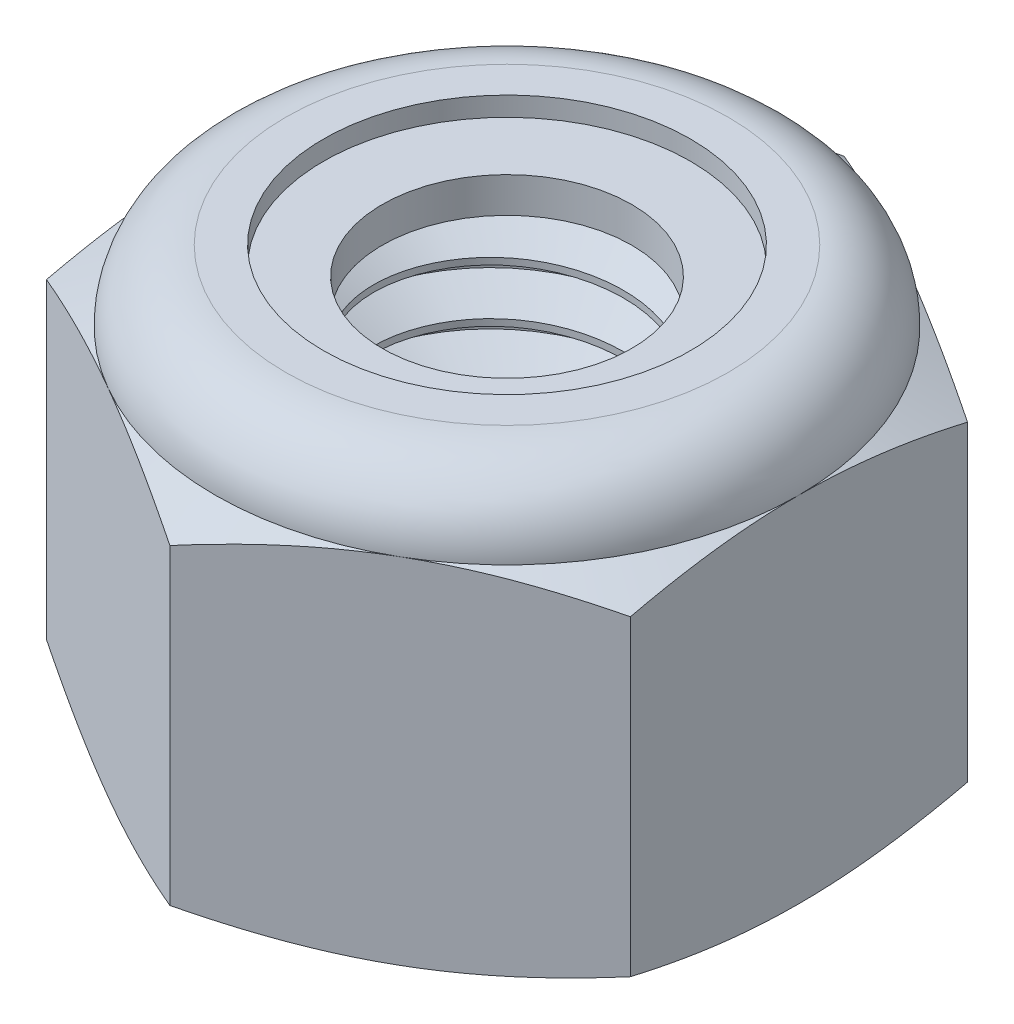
ISO-10303-21;
HEADER;
FILE_DESCRIPTION(('STEP AP214'),'2;1');
FILE_NAME('part.step','',(''),(''),'','','');
FILE_SCHEMA(('AUTOMOTIVE_DESIGN { 1 0 10303 214 1 1 1 1 }'));
ENDSEC;
DATA;
#1=APPLICATION_CONTEXT('core data for automotive mechanical design processes');
#2=APPLICATION_PROTOCOL_DEFINITION('international standard','automotive_design',2000,#1);
#3=PRODUCT_CONTEXT('',#1,'mechanical');
#4=PRODUCT('Part','Part','',(#3));
#5=PRODUCT_RELATED_PRODUCT_CATEGORY('part','',(#4));
#6=PRODUCT_DEFINITION_FORMATION('','',#4);
#7=PRODUCT_DEFINITION_CONTEXT('part definition',#1,'design');
#8=PRODUCT_DEFINITION('design','',#6,#7);
#9=PRODUCT_DEFINITION_SHAPE('','',#8);
#10=(LENGTH_UNIT() NAMED_UNIT(*) SI_UNIT(.MILLI.,.METRE.));
#11=(NAMED_UNIT(*) PLANE_ANGLE_UNIT() SI_UNIT($,.RADIAN.));
#12=(NAMED_UNIT(*) SI_UNIT($,.STERADIAN.) SOLID_ANGLE_UNIT());
#13=UNCERTAINTY_MEASURE_WITH_UNIT(LENGTH_MEASURE(1.E-05),#10,'distance_accuracy_value','');
#14=(GEOMETRIC_REPRESENTATION_CONTEXT(3) GLOBAL_UNCERTAINTY_ASSIGNED_CONTEXT((#13)) GLOBAL_UNIT_ASSIGNED_CONTEXT((#10,
#11,#12)) REPRESENTATION_CONTEXT('',''));
#15=CARTESIAN_POINT('',(0.,0.,0.));
#16=DIRECTION('',(0.,0.,1.));
#17=DIRECTION('',(1.,0.,0.));
#18=AXIS2_PLACEMENT_3D('',#15,#16,#17);
#19=CARTESIAN_POINT('',(0.,3.74198181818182,-2.08333333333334));
#20=DIRECTION('',(0.,1.,0.));
#21=DIRECTION('',(0.,0.,-1.));
#22=AXIS2_PLACEMENT_3D('',#19,#20,#21);
#23=PLANE('',#22);
#24=CARTESIAN_POINT('',(0.,3.74198181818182,0.));
#25=DIRECTION('',(0.,-1.,0.));
#26=DIRECTION('',(0.,0.,-1.));
#27=AXIS2_PLACEMENT_3D('',#24,#25,#26);
#28=CIRCLE('',#27,1.17524047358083);
#29=CARTESIAN_POINT('',(0.,3.74198181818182,-1.17524047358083));
#30=VERTEX_POINT('',#29);
#31=EDGE_CURVE('P0_E18',#30,#30,#28,.T.);
#32=ORIENTED_EDGE('',*,*,#31,.T.);
#33=EDGE_LOOP('',(#32));
#34=FACE_BOUND('',#33,.T.);
#35=CARTESIAN_POINT('',(0.,3.74198181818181,0.));
#36=DIRECTION('',(0.,-1.,0.));
#37=DIRECTION('',(0.,0.,-1.));
#38=AXIS2_PLACEMENT_3D('',#35,#36,#37);
#39=CIRCLE('',#38,2.08333333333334);
#40=CARTESIAN_POINT('',(0.,3.74198181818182,-2.08333333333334));
#41=VERTEX_POINT('',#40);
#42=EDGE_CURVE('P0_E36',#41,#41,#39,.T.);
#43=ORIENTED_EDGE('',*,*,#42,.F.);
#44=EDGE_LOOP('',(#43));
#45=FACE_BOUND('',#44,.T.);
#46=ADVANCED_FACE('P0_F15',(#34,#45),#23,.T.);
#47=CARTESIAN_POINT('',(0.,3.40953333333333,-1.17524047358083));
#48=DIRECTION('',(0.,-1.,0.));
#49=DIRECTION('',(0.,0.,-1.));
#50=AXIS2_PLACEMENT_3D('',#47,#48,#49);
#51=PLANE('',#50);
#52=CARTESIAN_POINT('',(0.,3.40953333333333,0.));
#53=DIRECTION('',(0.,-1.,0.));
#54=DIRECTION('',(0.,0.,-1.));
#55=AXIS2_PLACEMENT_3D('',#52,#53,#54);
#56=CIRCLE('',#55,1.17524047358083);
#57=CARTESIAN_POINT('',(0.,3.40953333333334,-1.17524047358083));
#58=VERTEX_POINT('',#57);
#59=EDGE_CURVE('P0_E10',#58,#58,#56,.T.);
#60=ORIENTED_EDGE('',*,*,#59,.F.);
#61=EDGE_LOOP('',(#60));
#62=FACE_BOUND('',#61,.T.);
#63=CARTESIAN_POINT('',(0.,3.40953333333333,0.));
#64=DIRECTION('',(0.,-1.,0.));
#65=DIRECTION('',(0.,0.,-1.));
#66=AXIS2_PLACEMENT_3D('',#63,#64,#65);
#67=CIRCLE('',#66,2.48481452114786);
#68=CARTESIAN_POINT('',(0.,3.40953333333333,-2.48481452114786));
#69=VERTEX_POINT('',#68);
#70=EDGE_CURVE('P0_E31',#69,#69,#67,.T.);
#71=ORIENTED_EDGE('',*,*,#70,.T.);
#72=EDGE_LOOP('',(#71));
#73=FACE_BOUND('',#72,.T.);
#74=ADVANCED_FACE('P0_F46',(#62,#73),#51,.T.);
#75=CARTESIAN_POINT('',(0.,3.40953333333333,0.));
#76=DIRECTION('',(0.,-1.,0.));
#77=DIRECTION('',(0.,0.,-1.));
#78=AXIS2_PLACEMENT_3D('',#75,#76,#77);
#79=CYLINDRICAL_SURFACE('',#78,1.17524047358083);
#80=ORIENTED_EDGE('',*,*,#59,.T.);
#81=EDGE_LOOP('',(#80));
#82=FACE_BOUND('',#81,.T.);
#83=ORIENTED_EDGE('',*,*,#31,.F.);
#84=EDGE_LOOP('',(#83));
#85=FACE_BOUND('',#84,.T.);
#86=ADVANCED_FACE('P0_F52',(#82,#85),#79,.F.);
#87=CARTESIAN_POINT('',(0.,3.33333333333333,0.));
#88=DIRECTION('',(0.,-1.,0.));
#89=DIRECTION('',(0.,0.,-1.));
#90=AXIS2_PLACEMENT_3D('',#87,#88,#89);
#91=TOROIDAL_SURFACE('',#90,2.08333333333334,0.408648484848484);
#92=ORIENTED_EDGE('',*,*,#70,.F.);
#93=EDGE_LOOP('',(#92));
#94=FACE_BOUND('',#93,.T.);
#95=ORIENTED_EDGE('',*,*,#42,.T.);
#96=EDGE_LOOP('',(#95));
#97=FACE_BOUND('',#96,.T.);
#98=ADVANCED_FACE('P0_F43',(#94,#97),#91,.T.);
#99=CLOSED_SHELL('',(#46,#74,#86,#98));
#100=MANIFOLD_SOLID_BREP('P0_B1',#99);
#101=CARTESIAN_POINT('',(0.,3.81818181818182,-2.08333333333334));
#102=DIRECTION('',(0.,-1.,0.));
#103=DIRECTION('',(0.,0.,-1.));
#104=AXIS2_PLACEMENT_3D('',#101,#102,#103);
#105=PLANE('',#104);
#106=CARTESIAN_POINT('',(0.,3.81818181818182,0.));
#107=DIRECTION('',(0.,1.,0.));
#108=DIRECTION('',(0.,0.,1.));
#109=AXIS2_PLACEMENT_3D('',#106,#107,#108);
#110=CIRCLE('',#109,1.72811059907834);
#111=CARTESIAN_POINT('',(0.,3.81818181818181,1.72811059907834));
#112=VERTEX_POINT('',#111);
#113=EDGE_CURVE('P1_E490',#112,#112,#110,.T.);
#114=ORIENTED_EDGE('',*,*,#113,.T.);
#115=EDGE_LOOP('',(#114));
#116=FACE_BOUND('',#115,.T.);
#117=CARTESIAN_POINT('',(0.,3.81818181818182,0.));
#118=DIRECTION('',(0.,1.,0.));
#119=DIRECTION('',(0.,0.,1.));
#120=AXIS2_PLACEMENT_3D('',#117,#118,#119);
#121=CIRCLE('',#120,2.08333333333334);
#122=CARTESIAN_POINT('',(0.,3.81818181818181,2.08333333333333));
#123=VERTEX_POINT('',#122);
#124=EDGE_CURVE('P1_E208',#123,#123,#121,.T.);
#125=ORIENTED_EDGE('',*,*,#124,.F.);
#126=EDGE_LOOP('',(#125));
#127=FACE_BOUND('',#126,.T.);
#128=ADVANCED_FACE('P1_F17',(#116,#127),#105,.T.);
#129=CARTESIAN_POINT('',(0.,3.33333333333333,0.));
#130=DIRECTION('',(0.,1.,0.));
#131=DIRECTION('',(0.,0.,-1.));
#132=AXIS2_PLACEMENT_3D('',#129,#130,#131);
#133=PLANE('',#132);
#134=CARTESIAN_POINT('',(1.13792169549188,3.33333333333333,-0.29381011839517));
#135=CARTESIAN_POINT('',(1.14313677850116,3.33333333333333,-0.273607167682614));
#136=CARTESIAN_POINT('',(1.14781351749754,3.33333333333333,-0.253274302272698));
#137=CARTESIAN_POINT('',(1.15608391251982,3.33333333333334,-0.212362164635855));
#138=CARTESIAN_POINT('',(1.15967616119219,3.33333333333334,-0.191782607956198));
#139=CARTESIAN_POINT('',(1.17231721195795,3.33333333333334,-0.105853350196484));
#140=CARTESIAN_POINT('',(1.17642002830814,3.33333333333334,-0.0396939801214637));
#141=CARTESIAN_POINT('',(1.17346861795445,3.33333333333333,0.0924584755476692));
#142=CARTESIAN_POINT('',(1.16639125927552,3.33333333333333,0.158450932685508));
#143=CARTESIAN_POINT('',(1.14142779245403,3.33333333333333,0.287344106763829));
#144=CARTESIAN_POINT('',(1.12371023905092,3.33333333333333,0.350276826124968));
#145=CARTESIAN_POINT('',(1.08954943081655,3.33333333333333,0.441741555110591));
#146=CARTESIAN_POINT('',(1.0768986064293,3.33333333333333,0.47174040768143));
#147=CARTESIAN_POINT('',(1.04915410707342,3.33333333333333,0.530587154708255));
#148=CARTESIAN_POINT('',(1.03406038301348,3.33333333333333,0.559435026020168));
#149=CARTESIAN_POINT('',(1.01778810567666,3.33333333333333,0.587620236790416));
#150=B_SPLINE_CURVE_WITH_KNOTS('',3,(#134,#135,#136,#137,#138,#139,#140,#141,#142,#143,#144,
#145,#146,#147,#148,#149),.UNSPECIFIED.,.F.,.F.,(4,2,2,2,2,2,2,4),(0.,0.0625706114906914,
0.125222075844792,0.3230270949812,0.521241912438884,0.71639664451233,0.813971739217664,
0.911548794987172),.UNSPECIFIED.);
#151=CARTESIAN_POINT('',(1.13792169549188,3.33333333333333,-0.29381011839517));
#152=VERTEX_POINT('',#151);
#153=CARTESIAN_POINT('',(1.01778810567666,3.33333333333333,0.587620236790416));
#154=VERTEX_POINT('',#153);
#155=EDGE_CURVE('P1_E427',#152,#154,#150,.T.);
#156=ORIENTED_EDGE('',*,*,#155,.T.);
#157=CARTESIAN_POINT('',(1.01778810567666,3.33333333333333,0.587620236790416));
#158=CARTESIAN_POINT('',(1.00362156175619,3.33333333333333,0.619545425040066));
#159=CARTESIAN_POINT('',(0.988115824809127,3.33333333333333,0.650858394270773));
#160=CARTESIAN_POINT('',(0.954524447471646,3.33333333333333,0.71206705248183));
#161=CARTESIAN_POINT('',(0.936438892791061,3.33333333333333,0.741962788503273));
#162=CARTESIAN_POINT('',(0.878505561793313,3.33333333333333,0.829167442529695));
#163=CARTESIAN_POINT('',(0.83494626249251,3.33333333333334,0.884072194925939));
#164=CARTESIAN_POINT('',(0.739247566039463,3.33333333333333,0.985724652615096));
#165=CARTESIAN_POINT('',(0.687111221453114,3.33333333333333,1.0324752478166));
#166=CARTESIAN_POINT('',(0.575748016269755,3.33333333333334,1.11653305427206));
#167=CARTESIAN_POINT('',(0.516524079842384,3.33333333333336,1.1538441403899));
#168=CARTESIAN_POINT('',(0.392678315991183,3.33333333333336,1.21796989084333));
#169=CARTESIAN_POINT('',(0.328061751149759,3.33333333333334,1.24479464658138));
#170=CARTESIAN_POINT('',(0.228525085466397,3.33333333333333,1.27662265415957));
#171=CARTESIAN_POINT('',(0.194893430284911,3.33333333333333,1.28583296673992));
#172=CARTESIAN_POINT('',(0.126969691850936,3.33333333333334,1.30141233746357));
#173=CARTESIAN_POINT('',(0.0926776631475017,3.33333333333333,1.30778162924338));
#174=CARTESIAN_POINT('',(0.0236996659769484,3.33333333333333,1.31758359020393));
#175=CARTESIAN_POINT('',(-0.0109861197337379,3.33333333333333,1.32101756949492));
#176=CARTESIAN_POINT('',(-0.0805171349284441,3.33333333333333,1.32528249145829));
#177=CARTESIAN_POINT('',(-0.115362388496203,3.33333333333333,1.32611302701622));
#178=CARTESIAN_POINT('',(-0.185040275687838,3.33333333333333,1.32514269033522));
#179=CARTESIAN_POINT('',(-0.219872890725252,3.33333333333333,1.32334031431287));
#180=CARTESIAN_POINT('',(-0.289292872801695,3.33333333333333,1.31711901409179));
#181=CARTESIAN_POINT('',(-0.323880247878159,3.33333333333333,1.31270017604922));
#182=CARTESIAN_POINT('',(-0.4338674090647,3.33333333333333,1.29439403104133));
#183=CARTESIAN_POINT('',(-0.508502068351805,3.33333333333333,1.27550592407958));
#184=CARTESIAN_POINT('',(-0.653560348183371,3.33333333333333,1.22565438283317));
#185=CARTESIAN_POINT('',(-0.723984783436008,3.33333333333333,1.19469329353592));
#186=CARTESIAN_POINT('',(-0.859786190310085,3.33333333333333,1.12099818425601));
#187=CARTESIAN_POINT('',(-0.925069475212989,3.33333333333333,1.07809132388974));
#188=CARTESIAN_POINT('',(-1.04752107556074,3.33333333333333,0.981916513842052));
#189=CARTESIAN_POINT('',(-1.10469084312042,3.33333333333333,0.928650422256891));
#190=CARTESIAN_POINT('',(-1.18315453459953,3.33333333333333,0.84218558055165));
#191=CARTESIAN_POINT('',(-1.20811343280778,3.33333333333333,0.812239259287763));
#192=CARTESIAN_POINT('',(-1.25538975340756,3.33333333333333,0.750371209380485));
#193=CARTESIAN_POINT('',(-1.27770907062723,3.33333333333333,0.718450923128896));
#194=CARTESIAN_POINT('',(-1.34090214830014,3.33333333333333,0.620328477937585));
#195=CARTESIAN_POINT('',(-1.37808173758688,3.33333333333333,0.551684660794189));
#196=CARTESIAN_POINT('',(-1.42531996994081,3.33333333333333,0.445979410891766));
#197=CARTESIAN_POINT('',(-1.43952436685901,3.33333333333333,0.410720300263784));
#198=CARTESIAN_POINT('',(-1.4523687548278,3.33333333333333,0.374999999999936));
#199=B_SPLINE_CURVE_WITH_KNOTS('',3,(#157,#158,#159,#160,#161,#162,#163,#164,#165,#166,#167,
#168,#169,#170,#171,#172,#173,#174,#175,#176,#177,#178,#179,#180,#181,#182,#183,#184,#185,#186,
#187,#188,#189,#190,#191,#192,#193,#194,#195,#196,#197,#198),.UNSPECIFIED.,.F.,.F.,(4,2,2,2,2,2,
2,2,2,2,2,2,2,2,2,2,2,2,2,2,4),(0.,0.10471774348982,0.209432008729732,0.418606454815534,
0.627706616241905,0.836720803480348,1.04553335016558,1.15004414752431,1.25454634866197,
1.3590018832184,1.46347375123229,1.5680053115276,1.6725334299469,1.90233208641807,
2.13208613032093,2.36535460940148,2.59858128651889,2.71540866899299,2.83215167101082,
3.0653204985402,3.17923991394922),.UNSPECIFIED.);
#200=CARTESIAN_POINT('',(-1.4523687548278,3.33333333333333,0.374999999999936));
#201=VERTEX_POINT('',#200);
#202=EDGE_CURVE('P1_E434',#154,#201,#199,.T.);
#203=ORIENTED_EDGE('',*,*,#202,.T.);
#204=CARTESIAN_POINT('',(0.,3.33333333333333,0.));
#205=DIRECTION('',(0.,1.,0.));
#206=DIRECTION('',(0.,0.,1.));
#207=AXIS2_PLACEMENT_3D('',#204,#205,#206);
#208=CIRCLE('',#207,1.5);
#209=CARTESIAN_POINT('',(-1.29903810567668,3.33333333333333,-0.749999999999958));
#210=VERTEX_POINT('',#209);
#211=EDGE_CURVE('P1_E397',#210,#201,#208,.T.);
#212=ORIENTED_EDGE('',*,*,#211,.F.);
#213=CARTESIAN_POINT('',(-1.29903810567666,3.33333333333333,-0.75));
#214=CARTESIAN_POINT('',(-1.2770597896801,3.33333333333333,-0.781665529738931));
#215=CARTESIAN_POINT('',(-1.253807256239,3.33333333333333,-0.812426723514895));
#216=CARTESIAN_POINT('',(-1.20489097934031,3.33333333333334,-0.871965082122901));
#217=CARTESIAN_POINT('',(-1.17922737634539,3.33333333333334,-0.900742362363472));
#218=CARTESIAN_POINT('',(-1.09889629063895,3.33333333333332,-0.983763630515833));
#219=CARTESIAN_POINT('',(-1.04082660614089,3.33333333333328,-1.03478612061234));
#220=CARTESIAN_POINT('',(-0.914731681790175,3.33333333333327,-1.12859241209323));
#221=CARTESIAN_POINT('',(-0.846400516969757,3.33333333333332,-1.17096360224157));
#222=CARTESIAN_POINT('',(-0.703591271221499,3.33333333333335,-1.24360054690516));
#223=CARTESIAN_POINT('',(-0.62911359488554,3.33333333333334,-1.27386709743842));
#224=CARTESIAN_POINT('',(-0.4762945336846,3.33333333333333,-1.32135834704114));
#225=CARTESIAN_POINT('',(-0.397964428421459,3.33333333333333,-1.33861895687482));
#226=CARTESIAN_POINT('',(-0.279195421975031,3.33333333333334,-1.35447569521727));
#227=CARTESIAN_POINT('',(-0.239362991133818,3.33333333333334,-1.35808784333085));
#228=CARTESIAN_POINT('',(-0.159530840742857,3.33333333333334,-1.3619457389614));
#229=CARTESIAN_POINT('',(-0.119531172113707,3.33333333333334,-1.36219244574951));
#230=CARTESIAN_POINT('',(-0.0595470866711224,3.33333333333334,-1.3600391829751));
#231=CARTESIAN_POINT('',(-0.0395087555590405,3.33333333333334,-1.35889529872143));
#232=CARTESIAN_POINT('',(0.000497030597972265,3.33333333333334,-1.35575649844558));
#233=CARTESIAN_POINT('',(0.0204645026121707,3.33333333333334,-1.35376180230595));
#234=CARTESIAN_POINT('',(0.0801868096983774,3.33333333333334,-1.34635958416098));
#235=CARTESIAN_POINT('',(0.119775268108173,3.33333333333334,-1.33953354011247));
#236=CARTESIAN_POINT('',(0.198090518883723,3.33333333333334,-1.32221611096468));
#237=CARTESIAN_POINT('',(0.236818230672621,3.33333333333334,-1.31172885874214));
#238=CARTESIAN_POINT('',(0.313114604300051,3.33333333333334,-1.28716817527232));
#239=CARTESIAN_POINT('',(0.350683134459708,3.33333333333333,-1.27309433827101));
#240=CARTESIAN_POINT('',(0.454818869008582,3.33333333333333,-1.22837665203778));
#241=CARTESIAN_POINT('',(0.519688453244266,3.33333333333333,-1.19365193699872));
#242=CARTESIAN_POINT('',(0.642514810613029,3.33333333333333,-1.11359311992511));
#243=CARTESIAN_POINT('',(0.700467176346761,3.33333333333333,-1.06825230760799));
#244=CARTESIAN_POINT('',(0.806642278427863,3.33333333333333,-0.969299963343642));
#245=CARTESIAN_POINT('',(0.855042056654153,3.33333333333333,-0.915879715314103));
#246=CARTESIAN_POINT('',(0.920337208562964,3.33333333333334,-0.830317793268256));
#247=CARTESIAN_POINT('',(0.940885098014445,3.33333333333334,-0.800891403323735));
#248=CARTESIAN_POINT('',(0.979436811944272,3.33333333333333,-0.740412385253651));
#249=CARTESIAN_POINT('',(0.997441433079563,3.33333333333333,-0.709360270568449));
#250=CARTESIAN_POINT('',(1.02194108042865,3.33333333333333,-0.662672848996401));
#251=CARTESIAN_POINT('',(1.02948380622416,3.33333333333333,-0.647577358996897));
#252=CARTESIAN_POINT('',(1.04397492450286,3.33333333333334,-0.61710725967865));
#253=CARTESIAN_POINT('',(1.0509234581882,3.33333333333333,-0.601732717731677));
#254=CARTESIAN_POINT('',(1.07072698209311,3.33333333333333,-0.555176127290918));
#255=CARTESIAN_POINT('',(1.08254801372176,3.33333333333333,-0.523545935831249));
#256=CARTESIAN_POINT('',(1.10335350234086,3.33333333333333,-0.459290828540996));
#257=CARTESIAN_POINT('',(1.11233137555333,3.33333333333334,-0.426663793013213));
#258=CARTESIAN_POINT('',(1.12735283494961,3.33333333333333,-0.360697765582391));
#259=CARTESIAN_POINT('',(1.13339268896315,3.33333333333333,-0.327357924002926));
#260=CARTESIAN_POINT('',(1.13792169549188,3.33333333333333,-0.29381011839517));
#261=B_SPLINE_CURVE_WITH_KNOTS('',3,(#213,#214,#215,#216,#217,#218,#219,#220,#221,#222,#223,
#224,#225,#226,#227,#228,#229,#230,#231,#232,#233,#234,#235,#236,#237,#238,#239,#240,#241,#242,
#243,#244,#245,#246,#247,#248,#249,#250,#251,#252,#253,#254,#255,#256,#257,#258,#259,#260),
.UNSPECIFIED.,.F.,.F.,(4,2,2,2,2,2,2,2,2,2,2,2,2,2,2,2,2,2,2,2,2,2,2,4),(0.,0.115572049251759,
0.231137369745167,0.461946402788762,0.702014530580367,0.942066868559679,1.18145394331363,
1.30132802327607,1.42116793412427,1.48136626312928,1.54154904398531,1.66187355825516,
1.78206268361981,1.90226541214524,2.12182251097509,2.34151876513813,2.55665319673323,
2.66422369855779,2.77176042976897,2.82237538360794,2.87297827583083,2.97413260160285,
3.07551948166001,3.1770348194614),.UNSPECIFIED.);
#262=EDGE_CURVE('P1_E441',#210,#152,#261,.T.);
#263=ORIENTED_EDGE('',*,*,#262,.T.);
#264=EDGE_LOOP('',(#156,#203,#212,#263));
#265=FACE_BOUND('',#264,.T.);
#266=CARTESIAN_POINT('',(0.,3.33333333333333,0.));
#267=DIRECTION('',(0.,1.,0.));
#268=DIRECTION('',(0.,0.,1.));
#269=AXIS2_PLACEMENT_3D('',#266,#267,#268);
#270=CIRCLE('',#269,2.56818181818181);
#271=CARTESIAN_POINT('',(0.,3.33333333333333,2.56818181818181));
#272=VERTEX_POINT('',#271);
#273=EDGE_CURVE('P1_E1224',#272,#272,#270,.T.);
#274=ORIENTED_EDGE('',*,*,#273,.T.);
#275=EDGE_LOOP('',(#274));
#276=FACE_BOUND('',#275,.T.);
#277=ADVANCED_FACE('P1_F231',(#265,#276),#133,.T.);
#278=CARTESIAN_POINT('',(-2.75,4.,1.58771324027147));
#279=DIRECTION('',(0.5,0.,-0.866025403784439));
#280=DIRECTION('',(0.,-1.,0.));
#281=AXIS2_PLACEMENT_3D('',#278,#279,#280);
#282=PLANE('',#281);
#283=DIRECTION('',(0.,-1.,0.));
#284=VECTOR('',#283,1.);
#285=CARTESIAN_POINT('',(0.,4.,3.17542648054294));
#286=LINE('',#285,#284);
#287=CARTESIAN_POINT('',(0.,3.13495370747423,3.17542648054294));
#288=VERTEX_POINT('',#287);
#289=CARTESIAN_POINT('',(0.,0.198379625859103,3.17542648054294));
#290=VERTEX_POINT('',#289);
#291=EDGE_CURVE('P1_E11',#288,#290,#286,.T.);
#292=ORIENTED_EDGE('',*,*,#291,.F.);
#293=CARTESIAN_POINT('',(0.,3.13495370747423,3.17542648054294));
#294=CARTESIAN_POINT('',(-0.112825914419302,3.16533409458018,3.11028640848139));
#295=CARTESIAN_POINT('',(-0.226240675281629,3.19306323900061,3.04480636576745));
#296=CARTESIAN_POINT('',(-0.453734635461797,3.24187468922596,2.91346266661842));
#297=CARTESIAN_POINT('',(-0.567810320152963,3.26297902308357,2.84760103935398));
#298=CARTESIAN_POINT('',(-0.796955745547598,3.29743000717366,2.71530386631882));
#299=CARTESIAN_POINT('',(-0.912026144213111,3.31077104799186,2.64886794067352));
#300=CARTESIAN_POINT('',(-1.08519440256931,3.32424281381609,2.54888920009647));
#301=CARTESIAN_POINT('',(-1.14311086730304,3.32764362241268,2.51545111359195));
#302=CARTESIAN_POINT('',(-1.25901653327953,3.33219209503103,2.44853294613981));
#303=CARTESIAN_POINT('',(-1.31700574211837,3.33333949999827,2.41505286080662));
#304=CARTESIAN_POINT('',(-1.375,3.33333333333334,2.38156986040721));
#305=B_SPLINE_CURVE_WITH_KNOTS('',3,(#293,#294,#295,#296,#297,#298,#299,#300,#301,#302,#303,
#304),.UNSPECIFIED.,.F.,.F.,(4,2,2,2,2,4),(0.,0.401386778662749,0.801424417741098,
1.20175074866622,1.40260488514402,1.60348211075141),.UNSPECIFIED.);
#306=CARTESIAN_POINT('',(-1.375,3.33333333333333,2.38156986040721));
#307=VERTEX_POINT('',#306);
#308=EDGE_CURVE('P1_E256',#288,#307,#305,.T.);
#309=ORIENTED_EDGE('',*,*,#308,.T.);
#310=CARTESIAN_POINT('',(-1.375,3.33333333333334,2.38156986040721));
#311=CARTESIAN_POINT('',(-1.43299425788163,3.33333949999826,2.34808686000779));
#312=CARTESIAN_POINT('',(-1.49098346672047,3.33219209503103,2.3146067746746));
#313=CARTESIAN_POINT('',(-1.60688913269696,3.32764362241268,2.24768860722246));
#314=CARTESIAN_POINT('',(-1.66480559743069,3.32424281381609,2.21425052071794));
#315=CARTESIAN_POINT('',(-1.83797385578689,3.31077104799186,2.11427178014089));
#316=CARTESIAN_POINT('',(-1.9530442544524,3.29743000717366,2.04783585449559));
#317=CARTESIAN_POINT('',(-2.18218967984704,3.26297902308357,1.91553868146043));
#318=CARTESIAN_POINT('',(-2.2962653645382,3.24187468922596,1.84967705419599));
#319=CARTESIAN_POINT('',(-2.52375932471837,3.19306323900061,1.71833335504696));
#320=CARTESIAN_POINT('',(-2.6371740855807,3.16533409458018,1.65285331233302));
#321=CARTESIAN_POINT('',(-2.75,3.13495370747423,1.58771324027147));
#322=B_SPLINE_CURVE_WITH_KNOTS('',3,(#310,#311,#312,#313,#314,#315,#316,#317,#318,#319,#320,
#321),.UNSPECIFIED.,.F.,.F.,(4,2,2,2,2,4),(0.,0.200877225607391,0.401731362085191,
0.802057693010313,1.20209533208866,1.60348211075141),.UNSPECIFIED.);
#323=CARTESIAN_POINT('',(-2.75,3.13495370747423,1.58771324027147));
#324=VERTEX_POINT('',#323);
#325=EDGE_CURVE('P1_E238',#307,#324,#322,.T.);
#326=ORIENTED_EDGE('',*,*,#325,.T.);
#327=DIRECTION('',(0.,-1.,0.));
#328=VECTOR('',#327,1.);
#329=CARTESIAN_POINT('',(-2.75,4.,1.58771324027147));
#330=LINE('',#329,#328);
#331=CARTESIAN_POINT('',(-2.75,0.198379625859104,1.58771324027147));
#332=VERTEX_POINT('',#331);
#333=EDGE_CURVE('P1_E33',#324,#332,#330,.T.);
#334=ORIENTED_EDGE('',*,*,#333,.T.);
#335=CARTESIAN_POINT('',(-2.75,0.198379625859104,1.58771324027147));
#336=CARTESIAN_POINT('',(-2.6371740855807,0.16799923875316,1.65285331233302));
#337=CARTESIAN_POINT('',(-2.52375932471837,0.140270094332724,1.71833335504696));
#338=CARTESIAN_POINT('',(-2.2962653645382,0.0914586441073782,1.849677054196));
#339=CARTESIAN_POINT('',(-2.18218967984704,0.0703543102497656,1.91553868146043));
#340=CARTESIAN_POINT('',(-1.9530442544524,0.0359033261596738,2.04783585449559));
#341=CARTESIAN_POINT('',(-1.83797385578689,0.0225622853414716,2.11427178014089));
#342=CARTESIAN_POINT('',(-1.66480559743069,0.00909051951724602,2.21425052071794));
#343=CARTESIAN_POINT('',(-1.60688913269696,0.00568971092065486,2.24768860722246));
#344=CARTESIAN_POINT('',(-1.49098346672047,0.00114123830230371,2.3146067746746));
#345=CARTESIAN_POINT('',(-1.43299425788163,-6.16666492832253E-06,2.34808686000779));
#346=CARTESIAN_POINT('',(-1.375,0.,2.38156986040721));
#347=B_SPLINE_CURVE_WITH_KNOTS('',3,(#335,#336,#337,#338,#339,#340,#341,#342,#343,#344,#345,
#346),.UNSPECIFIED.,.F.,.F.,(4,2,2,2,2,4),(0.,0.401386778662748,0.801424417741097,
1.20175074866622,1.40260488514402,1.60348211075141),.UNSPECIFIED.);
#348=CARTESIAN_POINT('',(-1.375,0.,2.38156986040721));
#349=VERTEX_POINT('',#348);
#350=EDGE_CURVE('P1_E194',#332,#349,#347,.T.);
#351=ORIENTED_EDGE('',*,*,#350,.T.);
#352=CARTESIAN_POINT('',(-1.375,0.,2.38156986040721));
#353=CARTESIAN_POINT('',(-1.31700574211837,-6.16666492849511E-06,2.41505286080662));
#354=CARTESIAN_POINT('',(-1.25901653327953,0.00114123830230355,2.44853294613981));
#355=CARTESIAN_POINT('',(-1.14311086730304,0.00568971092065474,2.51545111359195));
#356=CARTESIAN_POINT('',(-1.08519440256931,0.00909051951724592,2.54888920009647));
#357=CARTESIAN_POINT('',(-0.912026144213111,0.0225622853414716,2.64886794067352));
#358=CARTESIAN_POINT('',(-0.796955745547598,0.0359033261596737,2.71530386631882));
#359=CARTESIAN_POINT('',(-0.567810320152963,0.0703543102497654,2.84760103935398));
#360=CARTESIAN_POINT('',(-0.453734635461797,0.0914586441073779,2.91346266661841));
#361=CARTESIAN_POINT('',(-0.22624067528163,0.140270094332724,3.04480636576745));
#362=CARTESIAN_POINT('',(-0.112825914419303,0.16799923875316,3.11028640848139));
#363=CARTESIAN_POINT('',(0.,0.198379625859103,3.17542648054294));
#364=B_SPLINE_CURVE_WITH_KNOTS('',3,(#352,#353,#354,#355,#356,#357,#358,#359,#360,#361,#362,
#363),.UNSPECIFIED.,.F.,.F.,(4,2,2,2,2,4),(0.,0.20087722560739,0.401731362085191,
0.802057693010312,1.20209533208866,1.60348211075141),.UNSPECIFIED.);
#365=EDGE_CURVE('P1_E185',#349,#290,#364,.T.);
#366=ORIENTED_EDGE('',*,*,#365,.T.);
#367=EDGE_LOOP('',(#292,#309,#326,#334,#351,#366));
#368=FACE_BOUND('',#367,.T.);
#369=ADVANCED_FACE('P1_F192',(#368),#282,.F.);
#370=CARTESIAN_POINT('',(0.,4.,3.17542648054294));
#371=DIRECTION('',(-0.5,0.,-0.866025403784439));
#372=DIRECTION('',(-0.866025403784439,0.,0.5));
#373=AXIS2_PLACEMENT_3D('',#370,#371,#372);
#374=PLANE('',#373);
#375=DIRECTION('',(0.,-1.,0.));
#376=VECTOR('',#375,1.);
#377=CARTESIAN_POINT('',(2.75,4.,1.58771324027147));
#378=LINE('',#377,#376);
#379=CARTESIAN_POINT('',(2.75,3.13495370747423,1.58771324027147));
#380=VERTEX_POINT('',#379);
#381=CARTESIAN_POINT('',(2.75,0.198379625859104,1.58771324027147));
#382=VERTEX_POINT('',#381);
#383=EDGE_CURVE('P1_E48',#380,#382,#378,.T.);
#384=ORIENTED_EDGE('',*,*,#383,.F.);
#385=CARTESIAN_POINT('',(2.75,3.13495370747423,1.58771324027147));
#386=CARTESIAN_POINT('',(2.6371740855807,3.16533409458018,1.65285331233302));
#387=CARTESIAN_POINT('',(2.52375932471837,3.19306323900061,1.71833335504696));
#388=CARTESIAN_POINT('',(2.2962653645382,3.24187468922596,1.849677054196));
#389=CARTESIAN_POINT('',(2.18218967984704,3.26297902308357,1.91553868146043));
#390=CARTESIAN_POINT('',(1.9530442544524,3.29743000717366,2.04783585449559));
#391=CARTESIAN_POINT('',(1.83797385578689,3.31077104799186,2.11427178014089));
#392=CARTESIAN_POINT('',(1.66480559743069,3.32424281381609,2.21425052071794));
#393=CARTESIAN_POINT('',(1.60688913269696,3.32764362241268,2.24768860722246));
#394=CARTESIAN_POINT('',(1.49098346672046,3.33219209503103,2.3146067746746));
#395=CARTESIAN_POINT('',(1.43299425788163,3.33333949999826,2.34808686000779));
#396=CARTESIAN_POINT('',(1.375,3.33333333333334,2.38156986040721));
#397=B_SPLINE_CURVE_WITH_KNOTS('',3,(#385,#386,#387,#388,#389,#390,#391,#392,#393,#394,#395,
#396),.UNSPECIFIED.,.F.,.F.,(4,2,2,2,2,4),(0.,0.401386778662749,0.801424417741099,
1.20175074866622,1.40260488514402,1.60348211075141),.UNSPECIFIED.);
#398=CARTESIAN_POINT('',(1.375,3.33333333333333,2.38156986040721));
#399=VERTEX_POINT('',#398);
#400=EDGE_CURVE('P1_E351',#380,#399,#397,.T.);
#401=ORIENTED_EDGE('',*,*,#400,.T.);
#402=CARTESIAN_POINT('',(1.375,3.33333333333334,2.38156986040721));
#403=CARTESIAN_POINT('',(1.31700574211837,3.33333949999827,2.41505286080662));
#404=CARTESIAN_POINT('',(1.25901653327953,3.33219209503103,2.44853294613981));
#405=CARTESIAN_POINT('',(1.14311086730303,3.32764362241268,2.51545111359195));
#406=CARTESIAN_POINT('',(1.08519440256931,3.32424281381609,2.54888920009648));
#407=CARTESIAN_POINT('',(0.912026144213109,3.31077104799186,2.64886794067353));
#408=CARTESIAN_POINT('',(0.796955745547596,3.29743000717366,2.71530386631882));
#409=CARTESIAN_POINT('',(0.56781032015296,3.26297902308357,2.84760103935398));
#410=CARTESIAN_POINT('',(0.453734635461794,3.24187468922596,2.91346266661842));
#411=CARTESIAN_POINT('',(0.226240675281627,3.19306323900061,3.04480636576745));
#412=CARTESIAN_POINT('',(0.1128259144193,3.16533409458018,3.11028640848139));
#413=CARTESIAN_POINT('',(0.,3.13495370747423,3.17542648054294));
#414=B_SPLINE_CURVE_WITH_KNOTS('',3,(#402,#403,#404,#405,#406,#407,#408,#409,#410,#411,#412,
#413),.UNSPECIFIED.,.F.,.F.,(4,2,2,2,2,4),(0.,0.200877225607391,0.401731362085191,
0.802057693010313,1.20209533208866,1.60348211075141),.UNSPECIFIED.);
#415=EDGE_CURVE('P1_E176',#399,#288,#414,.T.);
#416=ORIENTED_EDGE('',*,*,#415,.T.);
#417=ORIENTED_EDGE('',*,*,#291,.T.);
#418=CARTESIAN_POINT('',(0.,0.198379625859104,3.17542648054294));
#419=CARTESIAN_POINT('',(0.1128259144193,0.167999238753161,3.11028640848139));
#420=CARTESIAN_POINT('',(0.226240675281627,0.140270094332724,3.04480636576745));
#421=CARTESIAN_POINT('',(0.453734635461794,0.0914586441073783,2.91346266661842));
#422=CARTESIAN_POINT('',(0.56781032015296,0.0703543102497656,2.84760103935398));
#423=CARTESIAN_POINT('',(0.796955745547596,0.0359033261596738,2.71530386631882));
#424=CARTESIAN_POINT('',(0.912026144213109,0.0225622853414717,2.64886794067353));
#425=CARTESIAN_POINT('',(1.08519440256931,0.00909051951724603,2.54888920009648));
#426=CARTESIAN_POINT('',(1.14311086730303,0.00568971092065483,2.51545111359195));
#427=CARTESIAN_POINT('',(1.25901653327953,0.00114123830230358,2.44853294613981));
#428=CARTESIAN_POINT('',(1.31700574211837,-6.1666649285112E-06,2.41505286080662));
#429=CARTESIAN_POINT('',(1.375,0.,2.38156986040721));
#430=B_SPLINE_CURVE_WITH_KNOTS('',3,(#418,#419,#420,#421,#422,#423,#424,#425,#426,#427,#428,
#429),.UNSPECIFIED.,.F.,.F.,(4,2,2,2,2,4),(0.,0.401386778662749,0.801424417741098,
1.20175074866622,1.40260488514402,1.60348211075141),.UNSPECIFIED.);
#431=CARTESIAN_POINT('',(1.375,0.,2.38156986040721));
#432=VERTEX_POINT('',#431);
#433=EDGE_CURVE('P1_E173',#290,#432,#430,.T.);
#434=ORIENTED_EDGE('',*,*,#433,.T.);
#435=CARTESIAN_POINT('',(1.375,0.,2.38156986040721));
#436=CARTESIAN_POINT('',(1.43299425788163,-6.166664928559E-06,2.34808686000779));
#437=CARTESIAN_POINT('',(1.49098346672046,0.00114123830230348,2.3146067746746));
#438=CARTESIAN_POINT('',(1.60688913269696,0.00568971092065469,2.24768860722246));
#439=CARTESIAN_POINT('',(1.66480559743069,0.0090905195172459,2.21425052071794));
#440=CARTESIAN_POINT('',(1.83797385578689,0.0225622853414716,2.11427178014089));
#441=CARTESIAN_POINT('',(1.9530442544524,0.0359033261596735,2.04783585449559));
#442=CARTESIAN_POINT('',(2.18218967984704,0.0703543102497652,1.91553868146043));
#443=CARTESIAN_POINT('',(2.2962653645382,0.0914586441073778,1.849677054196));
#444=CARTESIAN_POINT('',(2.52375932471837,0.140270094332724,1.71833335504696));
#445=CARTESIAN_POINT('',(2.6371740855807,0.16799923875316,1.65285331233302));
#446=CARTESIAN_POINT('',(2.75,0.198379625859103,1.58771324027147));
#447=B_SPLINE_CURVE_WITH_KNOTS('',3,(#435,#436,#437,#438,#439,#440,#441,#442,#443,#444,#445,
#446),.UNSPECIFIED.,.F.,.F.,(4,2,2,2,2,4),(0.,0.200877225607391,0.401731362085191,
0.802057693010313,1.20209533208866,1.60348211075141),.UNSPECIFIED.);
#448=EDGE_CURVE('P1_E190',#432,#382,#447,.T.);
#449=ORIENTED_EDGE('',*,*,#448,.T.);
#450=EDGE_LOOP('',(#384,#401,#416,#417,#434,#449));
#451=FACE_BOUND('',#450,.T.);
#452=ADVANCED_FACE('P1_F172',(#451),#374,.F.);
#453=CARTESIAN_POINT('',(2.75,4.,-1.58771324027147));
#454=DIRECTION('',(-0.5,0.,0.866025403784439));
#455=DIRECTION('',(0.,1.,0.));
#456=AXIS2_PLACEMENT_3D('',#453,#454,#455);
#457=PLANE('',#456);
#458=DIRECTION('',(0.,-1.,0.));
#459=VECTOR('',#458,1.);
#460=CARTESIAN_POINT('',(0.,4.,-3.17542648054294));
#461=LINE('',#460,#459);
#462=CARTESIAN_POINT('',(0.,3.13495370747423,-3.17542648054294));
#463=VERTEX_POINT('',#462);
#464=CARTESIAN_POINT('',(0.,0.198379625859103,-3.17542648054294));
#465=VERTEX_POINT('',#464);
#466=EDGE_CURVE('P1_E376',#463,#465,#461,.T.);
#467=ORIENTED_EDGE('',*,*,#466,.F.);
#468=CARTESIAN_POINT('',(0.,3.13495370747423,-3.17542648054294));
#469=CARTESIAN_POINT('',(0.112825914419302,3.16533409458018,-3.11028640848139));
#470=CARTESIAN_POINT('',(0.226240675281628,3.19306323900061,-3.04480636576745));
#471=CARTESIAN_POINT('',(0.453734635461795,3.24187468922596,-2.91346266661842));
#472=CARTESIAN_POINT('',(0.567810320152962,3.26297902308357,-2.84760103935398));
#473=CARTESIAN_POINT('',(0.796955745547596,3.29743000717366,-2.71530386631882));
#474=CARTESIAN_POINT('',(0.912026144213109,3.31077104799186,-2.64886794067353));
#475=CARTESIAN_POINT('',(1.08519440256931,3.32424281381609,-2.54888920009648));
#476=CARTESIAN_POINT('',(1.14311086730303,3.32764362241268,-2.51545111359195));
#477=CARTESIAN_POINT('',(1.25901653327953,3.33219209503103,-2.44853294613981));
#478=CARTESIAN_POINT('',(1.31700574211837,3.33333949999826,-2.41505286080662));
#479=CARTESIAN_POINT('',(1.375,3.33333333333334,-2.38156986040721));
#480=B_SPLINE_CURVE_WITH_KNOTS('',3,(#468,#469,#470,#471,#472,#473,#474,#475,#476,#477,#478,
#479),.UNSPECIFIED.,.F.,.F.,(4,2,2,2,2,4),(0.,0.401386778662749,0.801424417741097,
1.20175074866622,1.40260488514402,1.60348211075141),.UNSPECIFIED.);
#481=CARTESIAN_POINT('',(1.375,3.33333333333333,-2.38156986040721));
#482=VERTEX_POINT('',#481);
#483=EDGE_CURVE('P1_E418',#463,#482,#480,.T.);
#484=ORIENTED_EDGE('',*,*,#483,.T.);
#485=CARTESIAN_POINT('',(1.375,3.33333333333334,-2.38156986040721));
#486=CARTESIAN_POINT('',(1.43299425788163,3.33333949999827,-2.34808686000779));
#487=CARTESIAN_POINT('',(1.49098346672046,3.33219209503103,-2.3146067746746));
#488=CARTESIAN_POINT('',(1.60688913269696,3.32764362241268,-2.24768860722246));
#489=CARTESIAN_POINT('',(1.66480559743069,3.32424281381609,-2.21425052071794));
#490=CARTESIAN_POINT('',(1.83797385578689,3.31077104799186,-2.11427178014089));
#491=CARTESIAN_POINT('',(1.9530442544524,3.29743000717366,-2.0478358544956));
#492=CARTESIAN_POINT('',(2.18218967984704,3.26297902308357,-1.91553868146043));
#493=CARTESIAN_POINT('',(2.2962653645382,3.24187468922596,-1.849677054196));
#494=CARTESIAN_POINT('',(2.52375932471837,3.19306323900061,-1.71833335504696));
#495=CARTESIAN_POINT('',(2.6371740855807,3.16533409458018,-1.65285331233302));
#496=CARTESIAN_POINT('',(2.75,3.13495370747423,-1.58771324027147));
#497=B_SPLINE_CURVE_WITH_KNOTS('',3,(#485,#486,#487,#488,#489,#490,#491,#492,#493,#494,#495,
#496),.UNSPECIFIED.,.F.,.F.,(4,2,2,2,2,4),(0.,0.200877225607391,0.401731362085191,
0.802057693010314,1.20209533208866,1.60348211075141),.UNSPECIFIED.);
#498=CARTESIAN_POINT('',(2.75,3.13495370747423,-1.58771324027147));
#499=VERTEX_POINT('',#498);
#500=EDGE_CURVE('P1_E363',#482,#499,#497,.T.);
#501=ORIENTED_EDGE('',*,*,#500,.T.);
#502=DIRECTION('',(0.,-1.,0.));
#503=VECTOR('',#502,1.);
#504=CARTESIAN_POINT('',(2.75,4.,-1.58771324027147));
#505=LINE('',#504,#503);
#506=CARTESIAN_POINT('',(2.75,0.198379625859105,-1.58771324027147));
#507=VERTEX_POINT('',#506);
#508=EDGE_CURVE('P1_E189',#499,#507,#505,.T.);
#509=ORIENTED_EDGE('',*,*,#508,.T.);
#510=CARTESIAN_POINT('',(2.75,0.198379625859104,-1.58771324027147));
#511=CARTESIAN_POINT('',(2.6371740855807,0.16799923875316,-1.65285331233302));
#512=CARTESIAN_POINT('',(2.52375932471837,0.140270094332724,-1.71833335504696));
#513=CARTESIAN_POINT('',(2.2962653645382,0.0914586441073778,-1.849677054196));
#514=CARTESIAN_POINT('',(2.18218967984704,0.0703543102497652,-1.91553868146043));
#515=CARTESIAN_POINT('',(1.9530442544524,0.0359033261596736,-2.0478358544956));
#516=CARTESIAN_POINT('',(1.83797385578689,0.0225622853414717,-2.11427178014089));
#517=CARTESIAN_POINT('',(1.66480559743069,0.00909051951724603,-2.21425052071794));
#518=CARTESIAN_POINT('',(1.60688913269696,0.0056897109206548,-2.24768860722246));
#519=CARTESIAN_POINT('',(1.49098346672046,0.00114123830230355,-2.3146067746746));
#520=CARTESIAN_POINT('',(1.43299425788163,-6.16666492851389E-06,-2.34808686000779));
#521=CARTESIAN_POINT('',(1.375,0.,-2.38156986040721));
#522=B_SPLINE_CURVE_WITH_KNOTS('',3,(#510,#511,#512,#513,#514,#515,#516,#517,#518,#519,#520,
#521),.UNSPECIFIED.,.F.,.F.,(4,2,2,2,2,4),(0.,0.401386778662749,0.801424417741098,
1.20175074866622,1.40260488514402,1.60348211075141),.UNSPECIFIED.);
#523=CARTESIAN_POINT('',(1.375,0.,-2.38156986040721));
#524=VERTEX_POINT('',#523);
#525=EDGE_CURVE('P1_E525',#507,#524,#522,.T.);
#526=ORIENTED_EDGE('',*,*,#525,.T.);
#527=CARTESIAN_POINT('',(1.375,0.,-2.38156986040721));
#528=CARTESIAN_POINT('',(1.31700574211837,-6.16666492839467E-06,-2.41505286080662));
#529=CARTESIAN_POINT('',(1.25901653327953,0.00114123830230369,-2.44853294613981));
#530=CARTESIAN_POINT('',(1.14311086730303,0.00568971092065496,-2.51545111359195));
#531=CARTESIAN_POINT('',(1.08519440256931,0.0090905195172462,-2.54888920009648));
#532=CARTESIAN_POINT('',(0.912026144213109,0.0225622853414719,-2.64886794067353));
#533=CARTESIAN_POINT('',(0.796955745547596,0.0359033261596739,-2.71530386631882));
#534=CARTESIAN_POINT('',(0.567810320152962,0.0703543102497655,-2.84760103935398));
#535=CARTESIAN_POINT('',(0.453734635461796,0.0914586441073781,-2.91346266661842));
#536=CARTESIAN_POINT('',(0.226240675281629,0.140270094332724,-3.04480636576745));
#537=CARTESIAN_POINT('',(0.112825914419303,0.16799923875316,-3.11028640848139));
#538=CARTESIAN_POINT('',(0.,0.198379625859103,-3.17542648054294));
#539=B_SPLINE_CURVE_WITH_KNOTS('',3,(#527,#528,#529,#530,#531,#532,#533,#534,#535,#536,#537,
#538),.UNSPECIFIED.,.F.,.F.,(4,2,2,2,2,4),(0.,0.20087722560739,0.401731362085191,
0.802057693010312,1.20209533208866,1.60348211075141),.UNSPECIFIED.);
#540=EDGE_CURVE('P1_E1587',#524,#465,#539,.T.);
#541=ORIENTED_EDGE('',*,*,#540,.T.);
#542=EDGE_LOOP('',(#467,#484,#501,#509,#526,#541));
#543=FACE_BOUND('',#542,.T.);
#544=ADVANCED_FACE('P1_F304',(#543),#457,.F.);
#545=CARTESIAN_POINT('',(-2.75,4.,-1.58771324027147));
#546=DIRECTION('',(1.,0.,0.));
#547=DIRECTION('',(0.,0.,-1.));
#548=AXIS2_PLACEMENT_3D('',#545,#546,#547);
#549=PLANE('',#548);
#550=ORIENTED_EDGE('',*,*,#333,.F.);
#551=CARTESIAN_POINT('',(-2.75,3.13495370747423,1.58771324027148));
#552=CARTESIAN_POINT('',(-2.75,3.16533409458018,1.45743309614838));
#553=CARTESIAN_POINT('',(-2.75,3.19306323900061,1.32647301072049));
#554=CARTESIAN_POINT('',(-2.75,3.24187468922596,1.06378561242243));
#555=CARTESIAN_POINT('',(-2.75,3.26297902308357,0.932062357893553));
#556=CARTESIAN_POINT('',(-2.75,3.29743000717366,0.667468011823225));
#557=CARTESIAN_POINT('',(-2.75,3.31077104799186,0.534596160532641));
#558=CARTESIAN_POINT('',(-2.75,3.32424281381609,0.334638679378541));
#559=CARTESIAN_POINT('',(-2.75,3.32764362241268,0.267762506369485));
#560=CARTESIAN_POINT('',(-2.75,3.33219209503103,0.133926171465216));
#561=CARTESIAN_POINT('',(-2.75,3.33333949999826,0.0669660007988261));
#562=CARTESIAN_POINT('',(-2.75,3.33333333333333,0.));
#563=B_SPLINE_CURVE_WITH_KNOTS('',3,(#551,#552,#553,#554,#555,#556,#557,#558,#559,#560,#561,
#562),.UNSPECIFIED.,.F.,.F.,(4,2,2,2,2,4),(0.,0.40138677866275,0.8014244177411,1.20175074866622,
1.40260488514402,1.60348211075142),.UNSPECIFIED.);
#564=CARTESIAN_POINT('',(-2.75,3.33333333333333,0.));
#565=VERTEX_POINT('',#564);
#566=EDGE_CURVE('P1_E320',#324,#565,#563,.T.);
#567=ORIENTED_EDGE('',*,*,#566,.T.);
#568=CARTESIAN_POINT('',(-2.75,3.33333333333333,0.));
#569=CARTESIAN_POINT('',(-2.75,3.33333949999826,-0.0669660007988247));
#570=CARTESIAN_POINT('',(-2.75,3.33219209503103,-0.133926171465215));
#571=CARTESIAN_POINT('',(-2.75,3.32764362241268,-0.267762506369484));
#572=CARTESIAN_POINT('',(-2.75,3.32424281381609,-0.33463867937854));
#573=CARTESIAN_POINT('',(-2.75,3.31077104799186,-0.53459616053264));
#574=CARTESIAN_POINT('',(-2.75,3.29743000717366,-0.667468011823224));
#575=CARTESIAN_POINT('',(-2.75,3.26297902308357,-0.932062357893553));
#576=CARTESIAN_POINT('',(-2.75,3.24187468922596,-1.06378561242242));
#577=CARTESIAN_POINT('',(-2.75,3.19306323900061,-1.32647301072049));
#578=CARTESIAN_POINT('',(-2.75,3.16533409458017,-1.45743309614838));
#579=CARTESIAN_POINT('',(-2.75,3.13495370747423,-1.58771324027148));
#580=B_SPLINE_CURVE_WITH_KNOTS('',3,(#568,#569,#570,#571,#572,#573,#574,#575,#576,#577,#578,
#579),.UNSPECIFIED.,.F.,.F.,(4,2,2,2,2,4),(0.,0.200877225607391,0.401731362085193,
0.802057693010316,1.20209533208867,1.60348211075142),.UNSPECIFIED.);
#581=CARTESIAN_POINT('',(-2.75,3.13495370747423,-1.58771324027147));
#582=VERTEX_POINT('',#581);
#583=EDGE_CURVE('P1_E311',#565,#582,#580,.T.);
#584=ORIENTED_EDGE('',*,*,#583,.T.);
#585=DIRECTION('',(0.,-1.,0.));
#586=VECTOR('',#585,1.);
#587=CARTESIAN_POINT('',(-2.75,4.,-1.58771324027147));
#588=LINE('',#587,#586);
#589=CARTESIAN_POINT('',(-2.75,0.198379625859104,-1.58771324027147));
#590=VERTEX_POINT('',#589);
#591=EDGE_CURVE('P1_E381',#582,#590,#588,.T.);
#592=ORIENTED_EDGE('',*,*,#591,.T.);
#593=CARTESIAN_POINT('',(-2.75,0.198379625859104,-1.58771324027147));
#594=CARTESIAN_POINT('',(-2.75,0.167999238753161,-1.45743309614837));
#595=CARTESIAN_POINT('',(-2.75,0.140270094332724,-1.32647301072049));
#596=CARTESIAN_POINT('',(-2.75,0.0914586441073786,-1.06378561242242));
#597=CARTESIAN_POINT('',(-2.75,0.070354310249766,-0.932062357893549));
#598=CARTESIAN_POINT('',(-2.75,0.0359033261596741,-0.667468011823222));
#599=CARTESIAN_POINT('',(-2.75,0.0225622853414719,-0.534596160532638));
#600=CARTESIAN_POINT('',(-2.75,0.00909051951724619,-0.334638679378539));
#601=CARTESIAN_POINT('',(-2.75,0.00568971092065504,-0.267762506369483));
#602=CARTESIAN_POINT('',(-2.75,0.00114123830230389,-0.133926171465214));
#603=CARTESIAN_POINT('',(-2.75,-6.16666492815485E-06,-0.0669660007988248));
#604=CARTESIAN_POINT('',(-2.75,0.,0.));
#605=B_SPLINE_CURVE_WITH_KNOTS('',3,(#593,#594,#595,#596,#597,#598,#599,#600,#601,#602,#603,
#604),.UNSPECIFIED.,.F.,.F.,(4,2,2,2,2,4),(0.,0.401386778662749,0.801424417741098,
1.20175074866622,1.40260488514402,1.60348211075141),.UNSPECIFIED.);
#606=CARTESIAN_POINT('',(-2.75,0.,0.));
#607=VERTEX_POINT('',#606);
#608=EDGE_CURVE('P1_E1265',#590,#607,#605,.T.);
#609=ORIENTED_EDGE('',*,*,#608,.T.);
#610=CARTESIAN_POINT('',(-2.75,0.,0.));
#611=CARTESIAN_POINT('',(-2.75,-6.16666492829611E-06,0.0669660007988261));
#612=CARTESIAN_POINT('',(-2.75,0.00114123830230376,0.133926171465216));
#613=CARTESIAN_POINT('',(-2.75,0.00568971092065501,0.267762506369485));
#614=CARTESIAN_POINT('',(-2.75,0.00909051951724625,0.334638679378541));
#615=CARTESIAN_POINT('',(-2.75,0.022562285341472,0.534596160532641));
#616=CARTESIAN_POINT('',(-2.75,0.0359033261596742,0.667468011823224));
#617=CARTESIAN_POINT('',(-2.75,0.0703543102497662,0.932062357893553));
#618=CARTESIAN_POINT('',(-2.75,0.0914586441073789,1.06378561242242));
#619=CARTESIAN_POINT('',(-2.75,0.140270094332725,1.32647301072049));
#620=CARTESIAN_POINT('',(-2.75,0.167999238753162,1.45743309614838));
#621=CARTESIAN_POINT('',(-2.75,0.198379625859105,1.58771324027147));
#622=B_SPLINE_CURVE_WITH_KNOTS('',3,(#610,#611,#612,#613,#614,#615,#616,#617,#618,#619,#620,
#621),.UNSPECIFIED.,.F.,.F.,(4,2,2,2,2,4),(0.,0.200877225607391,0.401731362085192,
0.802057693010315,1.20209533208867,1.60348211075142),.UNSPECIFIED.);
#623=EDGE_CURVE('P1_E293',#607,#332,#622,.T.);
#624=ORIENTED_EDGE('',*,*,#623,.T.);
#625=EDGE_LOOP('',(#550,#567,#584,#592,#609,#624));
#626=FACE_BOUND('',#625,.T.);
#627=ADVANCED_FACE('P1_F300',(#626),#549,.F.);
#628=CARTESIAN_POINT('',(0.,4.,-3.17542648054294));
#629=DIRECTION('',(0.5,0.,0.866025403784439));
#630=DIRECTION('',(0.,-1.,0.));
#631=AXIS2_PLACEMENT_3D('',#628,#629,#630);
#632=PLANE('',#631);
#633=ORIENTED_EDGE('',*,*,#591,.F.);
#634=CARTESIAN_POINT('',(-2.75,3.13495370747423,-1.58771324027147));
#635=CARTESIAN_POINT('',(-2.6371740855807,3.16533409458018,-1.65285331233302));
#636=CARTESIAN_POINT('',(-2.52375932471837,3.19306323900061,-1.71833335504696));
#637=CARTESIAN_POINT('',(-2.2962653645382,3.24187468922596,-1.84967705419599));
#638=CARTESIAN_POINT('',(-2.18218967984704,3.26297902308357,-1.91553868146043));
#639=CARTESIAN_POINT('',(-1.9530442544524,3.29743000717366,-2.04783585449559));
#640=CARTESIAN_POINT('',(-1.83797385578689,3.31077104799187,-2.11427178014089));
#641=CARTESIAN_POINT('',(-1.66480559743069,3.32424281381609,-2.21425052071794));
#642=CARTESIAN_POINT('',(-1.60688913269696,3.32764362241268,-2.24768860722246));
#643=CARTESIAN_POINT('',(-1.49098346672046,3.33219209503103,-2.3146067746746));
#644=CARTESIAN_POINT('',(-1.43299425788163,3.33333949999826,-2.34808686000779));
#645=CARTESIAN_POINT('',(-1.375,3.33333333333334,-2.38156986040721));
#646=B_SPLINE_CURVE_WITH_KNOTS('',3,(#634,#635,#636,#637,#638,#639,#640,#641,#642,#643,#644,
#645),.UNSPECIFIED.,.F.,.F.,(4,2,2,2,2,4),(0.,0.40138677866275,0.801424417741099,
1.20175074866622,1.40260488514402,1.60348211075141),.UNSPECIFIED.);
#647=CARTESIAN_POINT('',(-1.375,3.33333333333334,-2.38156986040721));
#648=VERTEX_POINT('',#647);
#649=EDGE_CURVE('P1_E417',#582,#648,#646,.T.);
#650=ORIENTED_EDGE('',*,*,#649,.T.);
#651=CARTESIAN_POINT('',(-1.375,3.33333333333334,-2.38156986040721));
#652=CARTESIAN_POINT('',(-1.31700574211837,3.33333949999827,-2.41505286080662));
#653=CARTESIAN_POINT('',(-1.25901653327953,3.33219209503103,-2.44853294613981));
#654=CARTESIAN_POINT('',(-1.14311086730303,3.32764362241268,-2.51545111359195));
#655=CARTESIAN_POINT('',(-1.08519440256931,3.32424281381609,-2.54888920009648));
#656=CARTESIAN_POINT('',(-0.912026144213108,3.31077104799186,-2.64886794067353));
#657=CARTESIAN_POINT('',(-0.796955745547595,3.29743000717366,-2.71530386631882));
#658=CARTESIAN_POINT('',(-0.56781032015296,3.26297902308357,-2.84760103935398));
#659=CARTESIAN_POINT('',(-0.453734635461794,3.24187468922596,-2.91346266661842));
#660=CARTESIAN_POINT('',(-0.226240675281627,3.19306323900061,-3.04480636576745));
#661=CARTESIAN_POINT('',(-0.1128259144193,3.16533409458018,-3.11028640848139));
#662=CARTESIAN_POINT('',(0.,3.13495370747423,-3.17542648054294));
#663=B_SPLINE_CURVE_WITH_KNOTS('',3,(#651,#652,#653,#654,#655,#656,#657,#658,#659,#660,#661,
#662),.UNSPECIFIED.,.F.,.F.,(4,2,2,2,2,4),(0.,0.200877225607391,0.401731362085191,
0.802057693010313,1.20209533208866,1.60348211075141),.UNSPECIFIED.);
#664=EDGE_CURVE('P1_E217',#648,#463,#663,.T.);
#665=ORIENTED_EDGE('',*,*,#664,.T.);
#666=ORIENTED_EDGE('',*,*,#466,.T.);
#667=CARTESIAN_POINT('',(0.,0.198379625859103,-3.17542648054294));
#668=CARTESIAN_POINT('',(-0.112825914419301,0.16799923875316,-3.11028640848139));
#669=CARTESIAN_POINT('',(-0.226240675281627,0.140270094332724,-3.04480636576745));
#670=CARTESIAN_POINT('',(-0.453734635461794,0.0914586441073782,-2.91346266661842));
#671=CARTESIAN_POINT('',(-0.567810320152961,0.0703543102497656,-2.84760103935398));
#672=CARTESIAN_POINT('',(-0.796955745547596,0.0359033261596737,-2.71530386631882));
#673=CARTESIAN_POINT('',(-0.912026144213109,0.0225622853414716,-2.64886794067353));
#674=CARTESIAN_POINT('',(-1.08519440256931,0.00909051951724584,-2.54888920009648));
#675=CARTESIAN_POINT('',(-1.14311086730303,0.00568971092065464,-2.51545111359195));
#676=CARTESIAN_POINT('',(-1.25901653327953,0.00114123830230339,-2.44853294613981));
#677=CARTESIAN_POINT('',(-1.31700574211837,-6.16666492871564E-06,-2.41505286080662));
#678=CARTESIAN_POINT('',(-1.375,0.,-2.38156986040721));
#679=B_SPLINE_CURVE_WITH_KNOTS('',3,(#667,#668,#669,#670,#671,#672,#673,#674,#675,#676,#677,
#678),.UNSPECIFIED.,.F.,.F.,(4,2,2,2,2,4),(0.,0.401386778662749,0.801424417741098,
1.20175074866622,1.40260488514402,1.60348211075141),.UNSPECIFIED.);
#680=CARTESIAN_POINT('',(-1.375,0.,-2.38156986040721));
#681=VERTEX_POINT('',#680);
#682=EDGE_CURVE('P1_E1583',#465,#681,#679,.T.);
#683=ORIENTED_EDGE('',*,*,#682,.T.);
#684=CARTESIAN_POINT('',(-1.375,0.,-2.38156986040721));
#685=CARTESIAN_POINT('',(-1.43299425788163,-6.16666492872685E-06,-2.34808686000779));
#686=CARTESIAN_POINT('',(-1.49098346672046,0.00114123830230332,-2.3146067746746));
#687=CARTESIAN_POINT('',(-1.60688913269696,0.00568971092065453,-2.24768860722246));
#688=CARTESIAN_POINT('',(-1.66480559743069,0.00909051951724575,-2.21425052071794));
#689=CARTESIAN_POINT('',(-1.83797385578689,0.0225622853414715,-2.11427178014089));
#690=CARTESIAN_POINT('',(-1.9530442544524,0.0359033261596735,-2.04783585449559));
#691=CARTESIAN_POINT('',(-2.18218967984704,0.0703543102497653,-1.91553868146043));
#692=CARTESIAN_POINT('',(-2.2962653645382,0.0914586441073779,-1.84967705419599));
#693=CARTESIAN_POINT('',(-2.52375932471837,0.140270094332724,-1.71833335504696));
#694=CARTESIAN_POINT('',(-2.6371740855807,0.16799923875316,-1.65285331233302));
#695=CARTESIAN_POINT('',(-2.75,0.198379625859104,-1.58771324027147));
#696=B_SPLINE_CURVE_WITH_KNOTS('',3,(#684,#685,#686,#687,#688,#689,#690,#691,#692,#693,#694,
#695),.UNSPECIFIED.,.F.,.F.,(4,2,2,2,2,4),(0.,0.200877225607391,0.401731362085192,
0.802057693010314,1.20209533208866,1.60348211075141),.UNSPECIFIED.);
#697=EDGE_CURVE('P1_E390',#681,#590,#696,.T.);
#698=ORIENTED_EDGE('',*,*,#697,.T.);
#699=EDGE_LOOP('',(#633,#650,#665,#666,#683,#698));
#700=FACE_BOUND('',#699,.T.);
#701=ADVANCED_FACE('P1_F303',(#700),#632,.F.);
#702=CARTESIAN_POINT('',(2.75,4.,1.58771324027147));
#703=DIRECTION('',(-1.,0.,0.));
#704=DIRECTION('',(0.,0.,1.));
#705=AXIS2_PLACEMENT_3D('',#702,#703,#704);
#706=PLANE('',#705);
#707=ORIENTED_EDGE('',*,*,#508,.F.);
#708=CARTESIAN_POINT('',(2.75,3.13495370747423,-1.58771324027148));
#709=CARTESIAN_POINT('',(2.75,3.16533409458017,-1.45743309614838));
#710=CARTESIAN_POINT('',(2.75,3.19306323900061,-1.32647301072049));
#711=CARTESIAN_POINT('',(2.75,3.24187468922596,-1.06378561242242));
#712=CARTESIAN_POINT('',(2.75,3.26297902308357,-0.932062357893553));
#713=CARTESIAN_POINT('',(2.75,3.29743000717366,-0.667468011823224));
#714=CARTESIAN_POINT('',(2.75,3.31077104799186,-0.53459616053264));
#715=CARTESIAN_POINT('',(2.75,3.32424281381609,-0.33463867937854));
#716=CARTESIAN_POINT('',(2.75,3.32764362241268,-0.267762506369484));
#717=CARTESIAN_POINT('',(2.75,3.33219209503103,-0.133926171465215));
#718=CARTESIAN_POINT('',(2.75,3.33333949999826,-0.0669660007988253));
#719=CARTESIAN_POINT('',(2.75,3.33333333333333,0.));
#720=B_SPLINE_CURVE_WITH_KNOTS('',3,(#708,#709,#710,#711,#712,#713,#714,#715,#716,#717,#718,
#719),.UNSPECIFIED.,.F.,.F.,(4,2,2,2,2,4),(0.,0.40138677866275,0.801424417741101,
1.20175074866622,1.40260488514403,1.60348211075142),.UNSPECIFIED.);
#721=CARTESIAN_POINT('',(2.75,3.33333333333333,0.));
#722=VERTEX_POINT('',#721);
#723=EDGE_CURVE('P1_E265',#499,#722,#720,.T.);
#724=ORIENTED_EDGE('',*,*,#723,.T.);
#725=CARTESIAN_POINT('',(2.75,3.33333333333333,0.));
#726=CARTESIAN_POINT('',(2.75,3.33333949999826,0.0669660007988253));
#727=CARTESIAN_POINT('',(2.75,3.33219209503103,0.133926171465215));
#728=CARTESIAN_POINT('',(2.75,3.32764362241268,0.267762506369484));
#729=CARTESIAN_POINT('',(2.75,3.32424281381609,0.334638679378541));
#730=CARTESIAN_POINT('',(2.75,3.31077104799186,0.53459616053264));
#731=CARTESIAN_POINT('',(2.75,3.29743000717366,0.667468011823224));
#732=CARTESIAN_POINT('',(2.75,3.26297902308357,0.932062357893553));
#733=CARTESIAN_POINT('',(2.75,3.24187468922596,1.06378561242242));
#734=CARTESIAN_POINT('',(2.75,3.19306323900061,1.32647301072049));
#735=CARTESIAN_POINT('',(2.75,3.16533409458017,1.45743309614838));
#736=CARTESIAN_POINT('',(2.75,3.13495370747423,1.58771324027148));
#737=B_SPLINE_CURVE_WITH_KNOTS('',3,(#725,#726,#727,#728,#729,#730,#731,#732,#733,#734,#735,
#736),.UNSPECIFIED.,.F.,.F.,(4,2,2,2,2,4),(0.,0.200877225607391,0.401731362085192,
0.802057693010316,1.20209533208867,1.60348211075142),.UNSPECIFIED.);
#738=EDGE_CURVE('P1_E346',#722,#380,#737,.T.);
#739=ORIENTED_EDGE('',*,*,#738,.T.);
#740=ORIENTED_EDGE('',*,*,#383,.T.);
#741=CARTESIAN_POINT('',(2.75,0.198379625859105,1.58771324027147));
#742=CARTESIAN_POINT('',(2.75,0.167999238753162,1.45743309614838));
#743=CARTESIAN_POINT('',(2.75,0.140270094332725,1.32647301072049));
#744=CARTESIAN_POINT('',(2.75,0.0914586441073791,1.06378561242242));
#745=CARTESIAN_POINT('',(2.75,0.0703543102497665,0.932062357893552));
#746=CARTESIAN_POINT('',(2.75,0.0359033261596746,0.667468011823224));
#747=CARTESIAN_POINT('',(2.75,0.0225622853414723,0.53459616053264));
#748=CARTESIAN_POINT('',(2.75,0.0090905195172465,0.334638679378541));
#749=CARTESIAN_POINT('',(2.75,0.00568971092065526,0.267762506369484));
#750=CARTESIAN_POINT('',(2.75,0.001141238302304,0.133926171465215));
#751=CARTESIAN_POINT('',(2.75,-6.16666492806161E-06,0.0669660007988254));
#752=CARTESIAN_POINT('',(2.75,0.,0.));
#753=B_SPLINE_CURVE_WITH_KNOTS('',3,(#741,#742,#743,#744,#745,#746,#747,#748,#749,#750,#751,
#752),.UNSPECIFIED.,.F.,.F.,(4,2,2,2,2,4),(0.,0.40138677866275,0.8014244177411,1.20175074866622,
1.40260488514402,1.60348211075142),.UNSPECIFIED.);
#754=CARTESIAN_POINT('',(2.75,0.,0.));
#755=VERTEX_POINT('',#754);
#756=EDGE_CURVE('P1_E502',#382,#755,#753,.T.);
#757=ORIENTED_EDGE('',*,*,#756,.T.);
#758=CARTESIAN_POINT('',(2.75,0.,0.));
#759=CARTESIAN_POINT('',(2.75,-6.16666492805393E-06,-0.0669660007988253));
#760=CARTESIAN_POINT('',(2.75,0.00114123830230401,-0.133926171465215));
#761=CARTESIAN_POINT('',(2.75,0.00568971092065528,-0.267762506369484));
#762=CARTESIAN_POINT('',(2.75,0.00909051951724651,-0.334638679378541));
#763=CARTESIAN_POINT('',(2.75,0.0225622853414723,-0.53459616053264));
#764=CARTESIAN_POINT('',(2.75,0.0359033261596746,-0.667468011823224));
#765=CARTESIAN_POINT('',(2.75,0.0703543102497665,-0.932062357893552));
#766=CARTESIAN_POINT('',(2.75,0.0914586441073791,-1.06378561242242));
#767=CARTESIAN_POINT('',(2.75,0.140270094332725,-1.32647301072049));
#768=CARTESIAN_POINT('',(2.75,0.167999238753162,-1.45743309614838));
#769=CARTESIAN_POINT('',(2.75,0.198379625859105,-1.58771324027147));
#770=B_SPLINE_CURVE_WITH_KNOTS('',3,(#758,#759,#760,#761,#762,#763,#764,#765,#766,#767,#768,
#769),.UNSPECIFIED.,.F.,.F.,(4,2,2,2,2,4),(0.,0.200877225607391,0.401731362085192,
0.802057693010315,1.20209533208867,1.60348211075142),.UNSPECIFIED.);
#771=EDGE_CURVE('P1_E1502',#755,#507,#770,.T.);
#772=ORIENTED_EDGE('',*,*,#771,.T.);
#773=EDGE_LOOP('',(#707,#724,#739,#740,#757,#772));
#774=FACE_BOUND('',#773,.T.);
#775=ADVANCED_FACE('P1_F342',(#774),#706,.F.);
#776=CARTESIAN_POINT('',(0.,0.198379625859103,0.));
#777=DIRECTION('',(0.,1.,0.));
#778=DIRECTION('',(0.,0.,1.));
#779=AXIS2_PLACEMENT_3D('',#776,#777,#778);
#780=CONICAL_SURFACE('',#779,3.17542648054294,1.13446401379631);
#781=CARTESIAN_POINT('',(0.,0.,0.));
#782=DIRECTION('',(0.,-1.,0.));
#783=DIRECTION('',(0.,0.,-1.));
#784=AXIS2_PLACEMENT_3D('',#781,#782,#783);
#785=CIRCLE('',#784,2.75);
#786=EDGE_CURVE('P1_E391',#755,#432,#785,.T.);
#787=ORIENTED_EDGE('',*,*,#786,.F.);
#788=ORIENTED_EDGE('',*,*,#756,.F.);
#789=ORIENTED_EDGE('',*,*,#448,.F.);
#790=EDGE_LOOP('',(#787,#788,#789));
#791=FACE_BOUND('',#790,.T.);
#792=ADVANCED_FACE('P1_F508',(#791),#780,.T.);
#793=CARTESIAN_POINT('',(0.,0.198379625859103,0.));
#794=DIRECTION('',(0.,1.,0.));
#795=DIRECTION('',(0.,0.,1.));
#796=AXIS2_PLACEMENT_3D('',#793,#794,#795);
#797=CONICAL_SURFACE('',#796,3.17542648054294,1.13446401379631);
#798=CARTESIAN_POINT('',(0.,0.,0.));
#799=DIRECTION('',(0.,-1.,0.));
#800=DIRECTION('',(0.,0.,-1.));
#801=AXIS2_PLACEMENT_3D('',#798,#799,#800);
#802=CIRCLE('',#801,2.75);
#803=EDGE_CURVE('P1_E1338',#524,#755,#802,.T.);
#804=ORIENTED_EDGE('',*,*,#803,.F.);
#805=ORIENTED_EDGE('',*,*,#525,.F.);
#806=ORIENTED_EDGE('',*,*,#771,.F.);
#807=EDGE_LOOP('',(#804,#805,#806));
#808=FACE_BOUND('',#807,.T.);
#809=ADVANCED_FACE('P1_F288',(#808),#797,.T.);
#810=CARTESIAN_POINT('',(0.,0.198379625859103,0.));
#811=DIRECTION('',(0.,1.,0.));
#812=DIRECTION('',(0.,0.,1.));
#813=AXIS2_PLACEMENT_3D('',#810,#811,#812);
#814=CONICAL_SURFACE('',#813,3.17542648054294,1.13446401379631);
#815=ORIENTED_EDGE('',*,*,#623,.F.);
#816=CARTESIAN_POINT('',(0.,0.,0.));
#817=DIRECTION('',(0.,-1.,0.));
#818=DIRECTION('',(0.,0.,-1.));
#819=AXIS2_PLACEMENT_3D('',#816,#817,#818);
#820=CIRCLE('',#819,2.75);
#821=EDGE_CURVE('P1_E387',#349,#607,#820,.T.);
#822=ORIENTED_EDGE('',*,*,#821,.F.);
#823=ORIENTED_EDGE('',*,*,#350,.F.);
#824=EDGE_LOOP('',(#815,#822,#823));
#825=FACE_BOUND('',#824,.T.);
#826=ADVANCED_FACE('P1_F281',(#825),#814,.T.);
#827=CARTESIAN_POINT('',(0.,3.33333333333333,0.));
#828=DIRECTION('',(0.,-1.,0.));
#829=DIRECTION('',(0.,0.,-1.));
#830=AXIS2_PLACEMENT_3D('',#827,#828,#829);
#831=CONICAL_SURFACE('',#830,2.75,1.13446401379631);
#832=CARTESIAN_POINT('',(0.,3.33333333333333,0.));
#833=DIRECTION('',(0.,-1.,0.));
#834=DIRECTION('',(0.,0.,-1.));
#835=AXIS2_PLACEMENT_3D('',#832,#833,#834);
#836=CIRCLE('',#835,2.75);
#837=EDGE_CURVE('P1_E205',#399,#307,#836,.T.);
#838=ORIENTED_EDGE('',*,*,#837,.T.);
#839=ORIENTED_EDGE('',*,*,#308,.F.);
#840=ORIENTED_EDGE('',*,*,#415,.F.);
#841=EDGE_LOOP('',(#838,#839,#840));
#842=FACE_BOUND('',#841,.T.);
#843=ADVANCED_FACE('P1_F277',(#842),#831,.T.);
#844=CARTESIAN_POINT('',(0.,3.33333333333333,0.));
#845=DIRECTION('',(0.,-1.,0.));
#846=DIRECTION('',(0.,0.,-1.));
#847=AXIS2_PLACEMENT_3D('',#844,#845,#846);
#848=CONICAL_SURFACE('',#847,2.75,1.13446401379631);
#849=ORIENTED_EDGE('',*,*,#500,.F.);
#850=CARTESIAN_POINT('',(0.,3.33333333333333,0.));
#851=DIRECTION('',(0.,-1.,0.));
#852=DIRECTION('',(0.,0.,-1.));
#853=AXIS2_PLACEMENT_3D('',#850,#851,#852);
#854=CIRCLE('',#853,2.75);
#855=EDGE_CURVE('P1_E401',#482,#722,#854,.T.);
#856=ORIENTED_EDGE('',*,*,#855,.T.);
#857=ORIENTED_EDGE('',*,*,#723,.F.);
#858=EDGE_LOOP('',(#849,#856,#857));
#859=FACE_BOUND('',#858,.T.);
#860=ADVANCED_FACE('P1_F280',(#859),#848,.T.);
#861=CARTESIAN_POINT('',(0.,3.33333333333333,0.));
#862=DIRECTION('',(0.,-1.,0.));
#863=DIRECTION('',(0.,0.,-1.));
#864=AXIS2_PLACEMENT_3D('',#861,#862,#863);
#865=CONICAL_SURFACE('',#864,2.75,1.13446401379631);
#866=CARTESIAN_POINT('',(0.,3.33333333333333,0.));
#867=DIRECTION('',(0.,-1.,0.));
#868=DIRECTION('',(0.,0.,-1.));
#869=AXIS2_PLACEMENT_3D('',#866,#867,#868);
#870=CIRCLE('',#869,2.75);
#871=EDGE_CURVE('P1_E398',#722,#399,#870,.T.);
#872=ORIENTED_EDGE('',*,*,#871,.T.);
#873=ORIENTED_EDGE('',*,*,#400,.F.);
#874=ORIENTED_EDGE('',*,*,#738,.F.);
#875=EDGE_LOOP('',(#872,#873,#874));
#876=FACE_BOUND('',#875,.T.);
#877=ADVANCED_FACE('P1_F333',(#876),#865,.T.);
#878=CARTESIAN_POINT('',(0.,3.33333333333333,0.));
#879=DIRECTION('',(0.,-1.,0.));
#880=DIRECTION('',(0.,0.,-1.));
#881=AXIS2_PLACEMENT_3D('',#878,#879,#880);
#882=CONICAL_SURFACE('',#881,2.75,1.13446401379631);
#883=CARTESIAN_POINT('',(0.,3.33333333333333,0.));
#884=DIRECTION('',(0.,-1.,0.));
#885=DIRECTION('',(0.,0.,-1.));
#886=AXIS2_PLACEMENT_3D('',#883,#884,#885);
#887=CIRCLE('',#886,2.75);
#888=EDGE_CURVE('P1_E326',#307,#565,#887,.T.);
#889=ORIENTED_EDGE('',*,*,#888,.T.);
#890=ORIENTED_EDGE('',*,*,#566,.F.);
#891=ORIENTED_EDGE('',*,*,#325,.F.);
#892=EDGE_LOOP('',(#889,#890,#891));
#893=FACE_BOUND('',#892,.T.);
#894=ADVANCED_FACE('P1_F327',(#893),#882,.T.);
#895=CARTESIAN_POINT('',(0.,3.33333333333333,0.));
#896=DIRECTION('',(0.,-1.,0.));
#897=DIRECTION('',(0.,0.,-1.));
#898=AXIS2_PLACEMENT_3D('',#895,#896,#897);
#899=CONICAL_SURFACE('',#898,2.75,1.13446401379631);
#900=CARTESIAN_POINT('',(0.,3.33333333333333,0.));
#901=DIRECTION('',(0.,-1.,0.));
#902=DIRECTION('',(0.,0.,-1.));
#903=AXIS2_PLACEMENT_3D('',#900,#901,#902);
#904=CIRCLE('',#903,2.75);
#905=EDGE_CURVE('P1_E413',#565,#648,#904,.T.);
#906=ORIENTED_EDGE('',*,*,#905,.T.);
#907=ORIENTED_EDGE('',*,*,#649,.F.);
#908=ORIENTED_EDGE('',*,*,#583,.F.);
#909=EDGE_LOOP('',(#906,#907,#908));
#910=FACE_BOUND('',#909,.T.);
#911=ADVANCED_FACE('P1_F332',(#910),#899,.T.);
#912=CARTESIAN_POINT('',(0.,0.198379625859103,0.));
#913=DIRECTION('',(0.,1.,0.));
#914=DIRECTION('',(0.,0.,1.));
#915=AXIS2_PLACEMENT_3D('',#912,#913,#914);
#916=CONICAL_SURFACE('',#915,3.17542648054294,1.13446401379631);
#917=CARTESIAN_POINT('',(0.,0.,0.));
#918=DIRECTION('',(0.,-1.,0.));
#919=DIRECTION('',(0.,0.,-1.));
#920=AXIS2_PLACEMENT_3D('',#917,#918,#919);
#921=CIRCLE('',#920,2.75);
#922=EDGE_CURVE('P1_E385',#681,#524,#921,.T.);
#923=ORIENTED_EDGE('',*,*,#922,.F.);
#924=ORIENTED_EDGE('',*,*,#682,.F.);
#925=ORIENTED_EDGE('',*,*,#540,.F.);
#926=EDGE_LOOP('',(#923,#924,#925));
#927=FACE_BOUND('',#926,.T.);
#928=ADVANCED_FACE('P1_F335',(#927),#916,.T.);
#929=CARTESIAN_POINT('',(0.,0.198379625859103,0.));
#930=DIRECTION('',(0.,1.,0.));
#931=DIRECTION('',(0.,0.,1.));
#932=AXIS2_PLACEMENT_3D('',#929,#930,#931);
#933=CONICAL_SURFACE('',#932,3.17542648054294,1.13446401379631);
#934=ORIENTED_EDGE('',*,*,#697,.F.);
#935=CARTESIAN_POINT('',(0.,0.,0.));
#936=DIRECTION('',(0.,-1.,0.));
#937=DIRECTION('',(0.,0.,-1.));
#938=AXIS2_PLACEMENT_3D('',#935,#936,#937);
#939=CIRCLE('',#938,2.75);
#940=EDGE_CURVE('P1_E393',#607,#681,#939,.T.);
#941=ORIENTED_EDGE('',*,*,#940,.F.);
#942=ORIENTED_EDGE('',*,*,#608,.F.);
#943=EDGE_LOOP('',(#934,#941,#942));
#944=FACE_BOUND('',#943,.T.);
#945=ADVANCED_FACE('P1_F726',(#944),#933,.T.);
#946=CARTESIAN_POINT('',(0.,4.,-3.17542648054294));
#947=DIRECTION('',(0.,1.,0.));
#948=DIRECTION('',(1.,0.,0.));
#949=AXIS2_PLACEMENT_3D('',#946,#947,#948);
#950=PLANE('',#949);
#951=CARTESIAN_POINT('',(0.,4.,0.));
#952=DIRECTION('',(0.,-1.,0.));
#953=DIRECTION('',(0.,0.,1.));
#954=AXIS2_PLACEMENT_3D('',#951,#952,#953);
#955=CIRCLE('',#954,1.72811059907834);
#956=CARTESIAN_POINT('',(0.,4.,1.72811059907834));
#957=VERTEX_POINT('',#956);
#958=EDGE_CURVE('P1_E1232',#957,#957,#955,.T.);
#959=ORIENTED_EDGE('',*,*,#958,.T.);
#960=EDGE_LOOP('',(#959));
#961=FACE_BOUND('',#960,.T.);
#962=CARTESIAN_POINT('',(0.,4.,0.));
#963=DIRECTION('',(0.,-1.,0.));
#964=DIRECTION('',(0.,0.,-1.));
#965=AXIS2_PLACEMENT_3D('',#962,#963,#964);
#966=CIRCLE('',#965,2.08333333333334);
#967=CARTESIAN_POINT('',(0.,4.,-2.08333333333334));
#968=VERTEX_POINT('',#967);
#969=EDGE_CURVE('P1_E197',#968,#968,#966,.T.);
#970=ORIENTED_EDGE('',*,*,#969,.F.);
#971=EDGE_LOOP('',(#970));
#972=FACE_BOUND('',#971,.T.);
#973=ADVANCED_FACE('P1_F715',(#961,#972),#950,.T.);
#974=CARTESIAN_POINT('',(2.75,0.,-1.58771324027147));
#975=DIRECTION('',(0.,-1.,0.));
#976=DIRECTION('',(0.,0.,-1.));
#977=AXIS2_PLACEMENT_3D('',#974,#975,#976);
#978=PLANE('',#977);
#979=CARTESIAN_POINT('',(0.,0.,0.));
#980=DIRECTION('',(0.,-1.,0.));
#981=DIRECTION('',(0.,0.,-1.));
#982=AXIS2_PLACEMENT_3D('',#979,#980,#981);
#983=CIRCLE('',#982,1.5);
#984=CARTESIAN_POINT('',(0.,0.,1.50000000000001));
#985=VERTEX_POINT('',#984);
#986=CARTESIAN_POINT('',(1.05094390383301,0.,1.07028823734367));
#987=VERTEX_POINT('',#986);
#988=EDGE_CURVE('P1_E484',#985,#987,#983,.T.);
#989=ORIENTED_EDGE('',*,*,#988,.F.);
#990=CARTESIAN_POINT('',(0.,0.,0.));
#991=DIRECTION('',(0.,1.,0.));
#992=DIRECTION('',(0.,0.,1.));
#993=AXIS2_PLACEMENT_3D('',#990,#991,#992);
#994=CIRCLE('',#993,1.5);
#995=EDGE_CURVE('P1_E461',#985,#987,#994,.T.);
#996=ORIENTED_EDGE('',*,*,#995,.T.);
#997=EDGE_LOOP('',(#989,#996));
#998=FACE_BOUND('',#997,.T.);
#999=ORIENTED_EDGE('',*,*,#940,.T.);
#1000=ORIENTED_EDGE('',*,*,#922,.T.);
#1001=ORIENTED_EDGE('',*,*,#803,.T.);
#1002=ORIENTED_EDGE('',*,*,#786,.T.);
#1003=CARTESIAN_POINT('',(0.,0.,0.));
#1004=DIRECTION('',(0.,-1.,0.));
#1005=DIRECTION('',(0.,0.,-1.));
#1006=AXIS2_PLACEMENT_3D('',#1003,#1004,#1005);
#1007=CIRCLE('',#1006,2.75);
#1008=EDGE_CURVE('P1_E187',#432,#349,#1007,.T.);
#1009=ORIENTED_EDGE('',*,*,#1008,.T.);
#1010=ORIENTED_EDGE('',*,*,#821,.T.);
#1011=EDGE_LOOP('',(#999,#1000,#1001,#1002,#1009,#1010));
#1012=FACE_BOUND('',#1011,.T.);
#1013=ADVANCED_FACE('P1_F705',(#998,#1012),#978,.T.);
#1014=CARTESIAN_POINT('',(0.,4.25,1.17524047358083));
#1015=CARTESIAN_POINT('',(-0.678525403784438,4.20833333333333,1.17524047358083));
#1016=CARTESIAN_POINT('',(-1.01778810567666,4.16666666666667,0.587620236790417));
#1017=CARTESIAN_POINT('',(-1.35705080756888,4.125,0.));
#1018=CARTESIAN_POINT('',(-1.01778810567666,4.08333333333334,-0.587620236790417));
#1019=CARTESIAN_POINT('',(-0.678525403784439,4.04166666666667,-1.17524047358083));
#1020=CARTESIAN_POINT('',(0.,4.,-1.17524047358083));
#1021=CARTESIAN_POINT('',(0.678525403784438,3.95833333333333,-1.17524047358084));
#1022=CARTESIAN_POINT('',(1.01778810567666,3.91666666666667,-0.587620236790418));
#1023=CARTESIAN_POINT('',(1.35705080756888,3.875,0.));
#1024=CARTESIAN_POINT('',(1.01778810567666,3.83333333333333,0.587620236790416));
#1025=CARTESIAN_POINT('',(0.678525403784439,3.79166666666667,1.17524047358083));
#1026=CARTESIAN_POINT('',(0.,3.75,1.17524047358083));
#1027=CARTESIAN_POINT('',(-0.678525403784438,3.70833333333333,1.17524047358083));
#1028=CARTESIAN_POINT('',(-1.01778810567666,3.66666666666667,0.587620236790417));
#1029=CARTESIAN_POINT('',(-1.35705080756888,3.625,0.));
#1030=CARTESIAN_POINT('',(-1.01778810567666,3.58333333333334,-0.587620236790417));
#1031=CARTESIAN_POINT('',(-0.678525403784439,3.54166666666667,-1.17524047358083));
#1032=CARTESIAN_POINT('',(0.,3.5,-1.17524047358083));
#1033=CARTESIAN_POINT('',(0.678525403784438,3.45833333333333,-1.17524047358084));
#1034=CARTESIAN_POINT('',(1.01778810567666,3.41666666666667,-0.587620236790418));
#1035=CARTESIAN_POINT('',(1.35705080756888,3.375,0.));
#1036=CARTESIAN_POINT('',(1.01778810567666,3.33333333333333,0.587620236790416));
#1037=CARTESIAN_POINT('',(0.678525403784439,3.29166666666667,1.17524047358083));
#1038=CARTESIAN_POINT('',(0.,3.25,1.17524047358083));
#1039=CARTESIAN_POINT('',(-0.678525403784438,3.20833333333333,1.17524047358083));
#1040=CARTESIAN_POINT('',(-1.01778810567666,3.16666666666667,0.587620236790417));
#1041=CARTESIAN_POINT('',(-1.35705080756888,3.125,0.));
#1042=CARTESIAN_POINT('',(-1.01778810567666,3.08333333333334,-0.587620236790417));
#1043=CARTESIAN_POINT('',(-0.678525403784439,3.04166666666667,-1.17524047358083));
#1044=CARTESIAN_POINT('',(0.,3.,-1.17524047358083));
#1045=CARTESIAN_POINT('',(0.678525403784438,2.95833333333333,-1.17524047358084));
#1046=CARTESIAN_POINT('',(1.01778810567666,2.91666666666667,-0.587620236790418));
#1047=CARTESIAN_POINT('',(1.35705080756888,2.875,0.));
#1048=CARTESIAN_POINT('',(1.01778810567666,2.83333333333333,0.587620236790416));
#1049=CARTESIAN_POINT('',(0.678525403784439,2.79166666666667,1.17524047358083));
#1050=CARTESIAN_POINT('',(0.,2.75,1.17524047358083));
#1051=CARTESIAN_POINT('',(-0.678525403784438,2.70833333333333,1.17524047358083));
#1052=CARTESIAN_POINT('',(-1.01778810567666,2.66666666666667,0.587620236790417));
#1053=CARTESIAN_POINT('',(-1.35705080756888,2.625,0.));
#1054=CARTESIAN_POINT('',(-1.01778810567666,2.58333333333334,-0.587620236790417));
#1055=CARTESIAN_POINT('',(-0.678525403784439,2.54166666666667,-1.17524047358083));
#1056=CARTESIAN_POINT('',(0.,2.5,-1.17524047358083));
#1057=CARTESIAN_POINT('',(0.678525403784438,2.45833333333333,-1.17524047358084));
#1058=CARTESIAN_POINT('',(1.01778810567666,2.41666666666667,-0.587620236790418));
#1059=CARTESIAN_POINT('',(1.35705080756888,2.375,0.));
#1060=CARTESIAN_POINT('',(1.01778810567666,2.33333333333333,0.587620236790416));
#1061=CARTESIAN_POINT('',(0.678525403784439,2.29166666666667,1.17524047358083));
#1062=CARTESIAN_POINT('',(0.,2.25,1.17524047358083));
#1063=CARTESIAN_POINT('',(-0.678525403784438,2.20833333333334,1.17524047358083));
#1064=CARTESIAN_POINT('',(-1.01778810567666,2.16666666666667,0.587620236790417));
#1065=CARTESIAN_POINT('',(-1.35705080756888,2.125,0.));
#1066=CARTESIAN_POINT('',(-1.01778810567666,2.08333333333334,-0.587620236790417));
#1067=CARTESIAN_POINT('',(-0.678525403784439,2.04166666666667,-1.17524047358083));
#1068=CARTESIAN_POINT('',(0.,2.,-1.17524047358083));
#1069=CARTESIAN_POINT('',(0.678525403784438,1.95833333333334,-1.17524047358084));
#1070=CARTESIAN_POINT('',(1.01778810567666,1.91666666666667,-0.587620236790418));
#1071=CARTESIAN_POINT('',(1.35705080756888,1.875,0.));
#1072=CARTESIAN_POINT('',(1.01778810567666,1.83333333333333,0.587620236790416));
#1073=CARTESIAN_POINT('',(0.678525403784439,1.79166666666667,1.17524047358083));
#1074=CARTESIAN_POINT('',(0.,1.75,1.17524047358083));
#1075=CARTESIAN_POINT('',(-0.678525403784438,1.70833333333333,1.17524047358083));
#1076=CARTESIAN_POINT('',(-1.01778810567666,1.66666666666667,0.587620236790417));
#1077=CARTESIAN_POINT('',(-1.35705080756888,1.625,0.));
#1078=CARTESIAN_POINT('',(-1.01778810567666,1.58333333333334,-0.587620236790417));
#1079=CARTESIAN_POINT('',(-0.678525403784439,1.54166666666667,-1.17524047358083));
#1080=CARTESIAN_POINT('',(0.,1.5,-1.17524047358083));
#1081=CARTESIAN_POINT('',(0.678525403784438,1.45833333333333,-1.17524047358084));
#1082=CARTESIAN_POINT('',(1.01778810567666,1.41666666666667,-0.587620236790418));
#1083=CARTESIAN_POINT('',(1.35705080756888,1.375,0.));
#1084=CARTESIAN_POINT('',(1.01778810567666,1.33333333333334,0.587620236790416));
#1085=CARTESIAN_POINT('',(0.678525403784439,1.29166666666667,1.17524047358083));
#1086=CARTESIAN_POINT('',(0.,1.25,1.17524047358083));
#1087=CARTESIAN_POINT('',(-0.678525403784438,1.20833333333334,1.17524047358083));
#1088=CARTESIAN_POINT('',(-1.01778810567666,1.16666666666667,0.587620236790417));
#1089=CARTESIAN_POINT('',(-1.35705080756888,1.125,0.));
#1090=CARTESIAN_POINT('',(-1.01778810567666,1.08333333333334,-0.587620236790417));
#1091=CARTESIAN_POINT('',(-0.678525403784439,1.04166666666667,-1.17524047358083));
#1092=CARTESIAN_POINT('',(0.,1.,-1.17524047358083));
#1093=CARTESIAN_POINT('',(0.678525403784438,0.958333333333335,-1.17524047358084));
#1094=CARTESIAN_POINT('',(1.01778810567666,0.916666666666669,-0.587620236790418));
#1095=CARTESIAN_POINT('',(1.35705080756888,0.875000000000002,0.));
#1096=CARTESIAN_POINT('',(1.01778810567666,0.833333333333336,0.587620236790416));
#1097=CARTESIAN_POINT('',(0.678525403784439,0.791666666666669,1.17524047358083));
#1098=CARTESIAN_POINT('',(0.,0.75,1.17524047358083));
#1099=CARTESIAN_POINT('',(-0.678525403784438,0.708333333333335,1.17524047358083));
#1100=CARTESIAN_POINT('',(-1.01778810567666,0.666666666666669,0.587620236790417));
#1101=CARTESIAN_POINT('',(-1.35705080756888,0.625000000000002,0.));
#1102=CARTESIAN_POINT('',(-1.01778810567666,0.583333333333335,-0.587620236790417));
#1103=CARTESIAN_POINT('',(-0.678525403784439,0.541666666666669,-1.17524047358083));
#1104=CARTESIAN_POINT('',(0.,0.5,-1.17524047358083));
#1105=CARTESIAN_POINT('',(0.678525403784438,0.458333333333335,-1.17524047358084));
#1106=CARTESIAN_POINT('',(1.01778810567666,0.416666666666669,-0.587620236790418));
#1107=CARTESIAN_POINT('',(1.35705080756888,0.375000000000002,0.));
#1108=CARTESIAN_POINT('',(1.01778810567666,0.333333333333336,0.587620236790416));
#1109=CARTESIAN_POINT('',(0.678525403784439,0.291666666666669,1.17524047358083));
#1110=CARTESIAN_POINT('',(0.,0.25,1.17524047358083));
#1111=CARTESIAN_POINT('',(-0.678525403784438,0.208333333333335,1.17524047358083));
#1112=CARTESIAN_POINT('',(-1.01778810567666,0.166666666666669,0.587620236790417));
#1113=CARTESIAN_POINT('',(-1.35705080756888,0.125000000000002,0.));
#1114=CARTESIAN_POINT('',(-1.01778810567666,0.0833333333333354,-0.587620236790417));
#1115=CARTESIAN_POINT('',(-0.678525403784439,0.041666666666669,-1.17524047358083));
#1116=CARTESIAN_POINT('',(0.,0.,-1.17524047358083));
#1117=CARTESIAN_POINT('',(0.678525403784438,-0.0416666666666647,-1.17524047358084));
#1118=CARTESIAN_POINT('',(1.01778810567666,-0.0833333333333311,-0.587620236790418));
#1119=CARTESIAN_POINT('',(1.35705080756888,-0.124999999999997,0.));
#1120=CARTESIAN_POINT('',(1.01778810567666,-0.166666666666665,0.587620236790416));
#1121=CARTESIAN_POINT('',(0.678525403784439,-0.208333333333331,1.17524047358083));
#1122=CARTESIAN_POINT('',(0.,-0.249999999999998,1.17524047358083));
#1123=CARTESIAN_POINT('',(0.,4.453125,1.52706329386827));
#1124=CARTESIAN_POINT('',(-0.881650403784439,4.41145833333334,1.52706329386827));
#1125=CARTESIAN_POINT('',(-1.32247560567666,4.36979166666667,0.763531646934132));
#1126=CARTESIAN_POINT('',(-1.76330080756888,4.328125,0.));
#1127=CARTESIAN_POINT('',(-1.32247560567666,4.28645833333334,-0.763531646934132));
#1128=CARTESIAN_POINT('',(-0.881650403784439,4.24479166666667,-1.52706329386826));
#1129=CARTESIAN_POINT('',(0.,4.203125,-1.52706329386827));
#1130=CARTESIAN_POINT('',(0.881650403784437,4.16145833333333,-1.52706329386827));
#1131=CARTESIAN_POINT('',(1.32247560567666,4.11979166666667,-0.763531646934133));
#1132=CARTESIAN_POINT('',(1.76330080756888,4.078125,0.));
#1133=CARTESIAN_POINT('',(1.32247560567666,4.03645833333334,0.763531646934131));
#1134=CARTESIAN_POINT('',(0.88165040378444,3.99479166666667,1.52706329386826));
#1135=CARTESIAN_POINT('',(0.,3.953125,1.52706329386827));
#1136=CARTESIAN_POINT('',(-0.881650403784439,3.91145833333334,1.52706329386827));
#1137=CARTESIAN_POINT('',(-1.32247560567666,3.86979166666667,0.763531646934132));
#1138=CARTESIAN_POINT('',(-1.76330080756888,3.82812500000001,0.));
#1139=CARTESIAN_POINT('',(-1.32247560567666,3.78645833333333,-0.763531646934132));
#1140=CARTESIAN_POINT('',(-0.881650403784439,3.74479166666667,-1.52706329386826));
#1141=CARTESIAN_POINT('',(0.,3.703125,-1.52706329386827));
#1142=CARTESIAN_POINT('',(0.881650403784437,3.66145833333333,-1.52706329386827));
#1143=CARTESIAN_POINT('',(1.32247560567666,3.61979166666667,-0.763531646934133));
#1144=CARTESIAN_POINT('',(1.76330080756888,3.578125,0.));
#1145=CARTESIAN_POINT('',(1.32247560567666,3.53645833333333,0.763531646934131));
#1146=CARTESIAN_POINT('',(0.88165040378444,3.49479166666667,1.52706329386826));
#1147=CARTESIAN_POINT('',(0.,3.453125,1.52706329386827));
#1148=CARTESIAN_POINT('',(-0.881650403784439,3.41145833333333,1.52706329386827));
#1149=CARTESIAN_POINT('',(-1.32247560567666,3.36979166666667,0.763531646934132));
#1150=CARTESIAN_POINT('',(-1.76330080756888,3.32812500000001,0.));
#1151=CARTESIAN_POINT('',(-1.32247560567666,3.28645833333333,-0.763531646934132));
#1152=CARTESIAN_POINT('',(-0.881650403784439,3.24479166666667,-1.52706329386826));
#1153=CARTESIAN_POINT('',(0.,3.203125,-1.52706329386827));
#1154=CARTESIAN_POINT('',(0.881650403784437,3.16145833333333,-1.52706329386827));
#1155=CARTESIAN_POINT('',(1.32247560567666,3.11979166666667,-0.763531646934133));
#1156=CARTESIAN_POINT('',(1.76330080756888,3.078125,0.));
#1157=CARTESIAN_POINT('',(1.32247560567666,3.03645833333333,0.763531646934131));
#1158=CARTESIAN_POINT('',(0.88165040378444,2.99479166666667,1.52706329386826));
#1159=CARTESIAN_POINT('',(0.,2.953125,1.52706329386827));
#1160=CARTESIAN_POINT('',(-0.881650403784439,2.91145833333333,1.52706329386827));
#1161=CARTESIAN_POINT('',(-1.32247560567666,2.86979166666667,0.763531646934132));
#1162=CARTESIAN_POINT('',(-1.76330080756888,2.828125,0.));
#1163=CARTESIAN_POINT('',(-1.32247560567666,2.78645833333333,-0.763531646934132));
#1164=CARTESIAN_POINT('',(-0.881650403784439,2.74479166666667,-1.52706329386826));
#1165=CARTESIAN_POINT('',(0.,2.703125,-1.52706329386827));
#1166=CARTESIAN_POINT('',(0.881650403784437,2.66145833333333,-1.52706329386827));
#1167=CARTESIAN_POINT('',(1.32247560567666,2.61979166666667,-0.763531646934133));
#1168=CARTESIAN_POINT('',(1.76330080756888,2.578125,0.));
#1169=CARTESIAN_POINT('',(1.32247560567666,2.53645833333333,0.763531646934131));
#1170=CARTESIAN_POINT('',(0.88165040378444,2.49479166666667,1.52706329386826));
#1171=CARTESIAN_POINT('',(0.,2.453125,1.52706329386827));
#1172=CARTESIAN_POINT('',(-0.881650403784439,2.41145833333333,1.52706329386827));
#1173=CARTESIAN_POINT('',(-1.32247560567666,2.36979166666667,0.763531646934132));
#1174=CARTESIAN_POINT('',(-1.76330080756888,2.328125,0.));
#1175=CARTESIAN_POINT('',(-1.32247560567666,2.28645833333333,-0.763531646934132));
#1176=CARTESIAN_POINT('',(-0.881650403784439,2.24479166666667,-1.52706329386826));
#1177=CARTESIAN_POINT('',(0.,2.203125,-1.52706329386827));
#1178=CARTESIAN_POINT('',(0.881650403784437,2.16145833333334,-1.52706329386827));
#1179=CARTESIAN_POINT('',(1.32247560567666,2.11979166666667,-0.763531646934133));
#1180=CARTESIAN_POINT('',(1.76330080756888,2.078125,0.));
#1181=CARTESIAN_POINT('',(1.32247560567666,2.03645833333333,0.763531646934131));
#1182=CARTESIAN_POINT('',(0.88165040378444,1.99479166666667,1.52706329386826));
#1183=CARTESIAN_POINT('',(0.,1.953125,1.52706329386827));
#1184=CARTESIAN_POINT('',(-0.881650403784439,1.91145833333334,1.52706329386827));
#1185=CARTESIAN_POINT('',(-1.32247560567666,1.86979166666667,0.763531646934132));
#1186=CARTESIAN_POINT('',(-1.76330080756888,1.828125,0.));
#1187=CARTESIAN_POINT('',(-1.32247560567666,1.78645833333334,-0.763531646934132));
#1188=CARTESIAN_POINT('',(-0.881650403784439,1.74479166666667,-1.52706329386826));
#1189=CARTESIAN_POINT('',(0.,1.703125,-1.52706329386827));
#1190=CARTESIAN_POINT('',(0.881650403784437,1.66145833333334,-1.52706329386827));
#1191=CARTESIAN_POINT('',(1.32247560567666,1.61979166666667,-0.763531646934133));
#1192=CARTESIAN_POINT('',(1.76330080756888,1.578125,0.));
#1193=CARTESIAN_POINT('',(1.32247560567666,1.53645833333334,0.763531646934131));
#1194=CARTESIAN_POINT('',(0.88165040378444,1.49479166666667,1.52706329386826));
#1195=CARTESIAN_POINT('',(0.,1.453125,1.52706329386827));
#1196=CARTESIAN_POINT('',(-0.881650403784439,1.41145833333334,1.52706329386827));
#1197=CARTESIAN_POINT('',(-1.32247560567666,1.36979166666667,0.763531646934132));
#1198=CARTESIAN_POINT('',(-1.76330080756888,1.328125,0.));
#1199=CARTESIAN_POINT('',(-1.32247560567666,1.28645833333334,-0.763531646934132));
#1200=CARTESIAN_POINT('',(-0.881650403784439,1.24479166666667,-1.52706329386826));
#1201=CARTESIAN_POINT('',(0.,1.203125,-1.52706329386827));
#1202=CARTESIAN_POINT('',(0.881650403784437,1.16145833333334,-1.52706329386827));
#1203=CARTESIAN_POINT('',(1.32247560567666,1.11979166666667,-0.763531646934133));
#1204=CARTESIAN_POINT('',(1.76330080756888,1.078125,0.));
#1205=CARTESIAN_POINT('',(1.32247560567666,1.03645833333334,0.763531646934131));
#1206=CARTESIAN_POINT('',(0.88165040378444,0.99479166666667,1.52706329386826));
#1207=CARTESIAN_POINT('',(0.,0.953125,1.52706329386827));
#1208=CARTESIAN_POINT('',(-0.881650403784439,0.911458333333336,1.52706329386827));
#1209=CARTESIAN_POINT('',(-1.32247560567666,0.86979166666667,0.763531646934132));
#1210=CARTESIAN_POINT('',(-1.76330080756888,0.828125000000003,0.));
#1211=CARTESIAN_POINT('',(-1.32247560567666,0.786458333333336,-0.763531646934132));
#1212=CARTESIAN_POINT('',(-0.881650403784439,0.74479166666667,-1.52706329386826));
#1213=CARTESIAN_POINT('',(0.,0.703125,-1.52706329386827));
#1214=CARTESIAN_POINT('',(0.881650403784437,0.661458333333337,-1.52706329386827));
#1215=CARTESIAN_POINT('',(1.32247560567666,0.61979166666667,-0.763531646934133));
#1216=CARTESIAN_POINT('',(1.76330080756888,0.578125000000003,0.));
#1217=CARTESIAN_POINT('',(1.32247560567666,0.536458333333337,0.763531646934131));
#1218=CARTESIAN_POINT('',(0.88165040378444,0.49479166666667,1.52706329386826));
#1219=CARTESIAN_POINT('',(0.,0.453125,1.52706329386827));
#1220=CARTESIAN_POINT('',(-0.881650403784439,0.411458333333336,1.52706329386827));
#1221=CARTESIAN_POINT('',(-1.32247560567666,0.36979166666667,0.763531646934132));
#1222=CARTESIAN_POINT('',(-1.76330080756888,0.328125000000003,0.));
#1223=CARTESIAN_POINT('',(-1.32247560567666,0.286458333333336,-0.763531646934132));
#1224=CARTESIAN_POINT('',(-0.881650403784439,0.24479166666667,-1.52706329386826));
#1225=CARTESIAN_POINT('',(0.,0.203125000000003,-1.52706329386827));
#1226=CARTESIAN_POINT('',(0.881650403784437,0.161458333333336,-1.52706329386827));
#1227=CARTESIAN_POINT('',(1.32247560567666,0.11979166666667,-0.763531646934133));
#1228=CARTESIAN_POINT('',(1.76330080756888,0.0781250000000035,0.));
#1229=CARTESIAN_POINT('',(1.32247560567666,0.0364583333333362,0.763531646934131));
#1230=CARTESIAN_POINT('',(0.88165040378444,-0.00520833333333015,1.52706329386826));
#1231=CARTESIAN_POINT('',(0.,-0.0468749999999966,1.52706329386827));
#1232=(BOUNDED_SURFACE() B_SPLINE_SURFACE(1,2,((#1014,#1015,#1016,#1017,#1018,#1019,#1020,#1021,
#1022,#1023,#1024,#1025,#1026,#1027,#1028,#1029,#1030,#1031,#1032,#1033,#1034,#1035,#1036,#1037,
#1038,#1039,#1040,#1041,#1042,#1043,#1044,#1045,#1046,#1047,#1048,#1049,#1050,#1051,#1052,#1053,
#1054,#1055,#1056,#1057,#1058,#1059,#1060,#1061,#1062,#1063,#1064,#1065,#1066,#1067,#1068,#1069,
#1070,#1071,#1072,#1073,#1074,#1075,#1076,#1077,#1078,#1079,#1080,#1081,#1082,#1083,#1084,#1085,
#1086,#1087,#1088,#1089,#1090,#1091,#1092,#1093,#1094,#1095,#1096,#1097,#1098,#1099,#1100,#1101,
#1102,#1103,#1104,#1105,#1106,#1107,#1108,#1109,#1110,#1111,#1112,#1113,#1114,#1115,#1116,#1117,
#1118,#1119,#1120,#1121,#1122),(#1123,#1124,#1125,#1126,#1127,#1128,#1129,#1130,#1131,#1132,
#1133,#1134,#1135,#1136,#1137,#1138,#1139,#1140,#1141,#1142,#1143,#1144,#1145,#1146,#1147,#1148,
#1149,#1150,#1151,#1152,#1153,#1154,#1155,#1156,#1157,#1158,#1159,#1160,#1161,#1162,#1163,#1164,
#1165,#1166,#1167,#1168,#1169,#1170,#1171,#1172,#1173,#1174,#1175,#1176,#1177,#1178,#1179,#1180,
#1181,#1182,#1183,#1184,#1185,#1186,#1187,#1188,#1189,#1190,#1191,#1192,#1193,#1194,#1195,#1196,
#1197,#1198,#1199,#1200,#1201,#1202,#1203,#1204,#1205,#1206,#1207,#1208,#1209,#1210,#1211,#1212,
#1213,#1214,#1215,#1216,#1217,#1218,#1219,#1220,#1221,#1222,#1223,#1224,#1225,#1226,#1227,#1228,
#1229,#1230,#1231)),.UNSPECIFIED.,.F.,.F.,.F.) B_SPLINE_SURFACE_WITH_KNOTS((2,2),(3,2,2,2,2,2,2,
2,2,2,2,2,2,2,2,2,2,2,2,2,2,2,2,2,2,2,2,2,2,2,2,2,2,2,2,2,2,2,2,2,2,2,2,2,2,2,2,2,2,2,2,2,2,2,
3),(0.,1.),(0.,0.0185185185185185,0.037037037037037,0.0555555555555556,0.0740740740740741,
0.0925925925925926,0.111111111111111,0.12962962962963,0.148148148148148,0.166666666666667,
0.185185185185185,0.203703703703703,0.222222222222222,0.240740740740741,0.25925925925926,
0.277777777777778,0.296296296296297,0.314814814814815,0.333333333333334,0.351851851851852,
0.370370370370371,0.388888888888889,0.407407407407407,0.425925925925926,0.444444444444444,
0.462962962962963,0.481481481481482,0.5,0.518518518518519,0.537037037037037,0.555555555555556,
0.574074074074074,0.592592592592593,0.611111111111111,0.62962962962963,0.648148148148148,
0.666666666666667,0.685185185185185,0.703703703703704,0.722222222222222,0.740740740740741,
0.759259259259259,0.777777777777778,0.796296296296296,0.814814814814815,0.833333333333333,
0.851851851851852,0.87037037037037,0.888888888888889,0.907407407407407,0.925925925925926,
0.944444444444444,0.962962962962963,0.981481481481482,1.),
.UNSPECIFIED.) GEOMETRIC_REPRESENTATION_ITEM() RATIONAL_B_SPLINE_SURFACE(((1.,0.866025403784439,
1.,0.866025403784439,1.,0.866025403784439,1.,0.866025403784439,1.,0.866025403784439,1.,
0.866025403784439,1.,0.866025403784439,1.,0.866025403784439,1.,0.866025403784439,1.,
0.866025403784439,1.,0.866025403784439,1.,0.866025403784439,1.,0.866025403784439,1.,
0.866025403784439,1.,0.866025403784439,1.,0.866025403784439,1.,0.866025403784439,1.,
0.866025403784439,1.,0.866025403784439,1.,0.866025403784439,1.,0.866025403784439,1.,
0.866025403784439,1.,0.866025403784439,1.,0.866025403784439,1.,0.866025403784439,1.,
0.866025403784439,1.,0.866025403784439,1.,0.866025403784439,1.,0.866025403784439,1.,
0.866025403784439,1.,0.866025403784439,1.,0.866025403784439,1.,0.866025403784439,1.,
0.866025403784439,1.,0.866025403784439,1.,0.866025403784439,1.,0.866025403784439,1.,
0.866025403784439,1.,0.866025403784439,1.,0.866025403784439,1.,0.866025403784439,1.,
0.866025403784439,1.,0.866025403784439,1.,0.866025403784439,1.,0.866025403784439,1.,
0.866025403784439,1.,0.866025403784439,1.,0.866025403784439,1.,0.866025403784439,1.,
0.866025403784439,1.,0.866025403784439,1.,0.866025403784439,1.,0.866025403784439,1.,
0.866025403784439,1.),(1.,0.866025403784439,1.,0.866025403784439,1.,0.866025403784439,1.,
0.866025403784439,1.,0.866025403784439,1.,0.866025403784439,1.,0.866025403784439,1.,
0.866025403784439,1.,0.866025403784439,1.,0.866025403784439,1.,0.866025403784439,1.,
0.866025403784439,1.,0.866025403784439,1.,0.866025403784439,1.,0.866025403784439,1.,
0.866025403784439,1.,0.866025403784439,1.,0.866025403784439,1.,0.866025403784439,1.,
0.866025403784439,1.,0.866025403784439,1.,0.866025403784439,1.,0.866025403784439,1.,
0.866025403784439,1.,0.866025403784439,1.,0.866025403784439,1.,0.866025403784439,1.,
0.866025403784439,1.,0.866025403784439,1.,0.866025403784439,1.,0.866025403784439,1.,
0.866025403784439,1.,0.866025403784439,1.,0.866025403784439,1.,0.866025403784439,1.,
0.866025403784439,1.,0.866025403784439,1.,0.866025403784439,1.,0.866025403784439,1.,
0.866025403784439,1.,0.866025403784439,1.,0.866025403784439,1.,0.866025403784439,1.,
0.866025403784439,1.,0.866025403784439,1.,0.866025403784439,1.,0.866025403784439,1.,
0.866025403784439,1.,0.866025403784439,1.,0.866025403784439,1.,0.866025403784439,1.,
0.866025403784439,1.,0.866025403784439,1.,0.866025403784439,1.))) REPRESENTATION_ITEM('') SURFACE());
#1233=CARTESIAN_POINT('',(1.01778810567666,3.33333333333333,0.587620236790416));
#1234=CARTESIAN_POINT('',(0.678525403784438,3.29166666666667,1.17524047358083));
#1235=CARTESIAN_POINT('',(0.,3.25,1.17524047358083));
#1236=CARTESIAN_POINT('',(-0.678525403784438,3.20833333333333,1.17524047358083));
#1237=CARTESIAN_POINT('',(-1.01778810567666,3.16666666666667,0.587620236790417));
#1238=CARTESIAN_POINT('',(-1.35705080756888,3.125,0.));
#1239=CARTESIAN_POINT('',(-1.01778810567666,3.08333333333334,-0.587620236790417));
#1240=CARTESIAN_POINT('',(-0.678525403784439,3.04166666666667,-1.17524047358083));
#1241=CARTESIAN_POINT('',(0.,3.,-1.17524047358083));
#1242=CARTESIAN_POINT('',(0.678525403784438,2.95833333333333,-1.17524047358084));
#1243=CARTESIAN_POINT('',(1.01778810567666,2.91666666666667,-0.587620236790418));
#1244=CARTESIAN_POINT('',(1.35705080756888,2.875,0.));
#1245=CARTESIAN_POINT('',(1.01778810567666,2.83333333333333,0.587620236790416));
#1246=CARTESIAN_POINT('',(0.678525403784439,2.79166666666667,1.17524047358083));
#1247=CARTESIAN_POINT('',(0.,2.75,1.17524047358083));
#1248=CARTESIAN_POINT('',(-0.678525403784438,2.70833333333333,1.17524047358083));
#1249=CARTESIAN_POINT('',(-1.01778810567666,2.66666666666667,0.587620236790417));
#1250=CARTESIAN_POINT('',(-1.35705080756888,2.625,0.));
#1251=CARTESIAN_POINT('',(-1.01778810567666,2.58333333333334,-0.587620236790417));
#1252=CARTESIAN_POINT('',(-0.678525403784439,2.54166666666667,-1.17524047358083));
#1253=CARTESIAN_POINT('',(0.,2.5,-1.17524047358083));
#1254=CARTESIAN_POINT('',(0.678525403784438,2.45833333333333,-1.17524047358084));
#1255=CARTESIAN_POINT('',(1.01778810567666,2.41666666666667,-0.587620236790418));
#1256=CARTESIAN_POINT('',(1.35705080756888,2.375,0.));
#1257=CARTESIAN_POINT('',(1.01778810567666,2.33333333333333,0.587620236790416));
#1258=CARTESIAN_POINT('',(0.678525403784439,2.29166666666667,1.17524047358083));
#1259=CARTESIAN_POINT('',(0.,2.25,1.17524047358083));
#1260=CARTESIAN_POINT('',(-0.678525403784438,2.20833333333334,1.17524047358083));
#1261=CARTESIAN_POINT('',(-1.01778810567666,2.16666666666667,0.587620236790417));
#1262=CARTESIAN_POINT('',(-1.35705080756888,2.125,0.));
#1263=CARTESIAN_POINT('',(-1.01778810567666,2.08333333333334,-0.587620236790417));
#1264=CARTESIAN_POINT('',(-0.678525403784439,2.04166666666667,-1.17524047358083));
#1265=CARTESIAN_POINT('',(0.,2.,-1.17524047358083));
#1266=CARTESIAN_POINT('',(0.678525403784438,1.95833333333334,-1.17524047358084));
#1267=CARTESIAN_POINT('',(1.01778810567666,1.91666666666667,-0.587620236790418));
#1268=CARTESIAN_POINT('',(1.35705080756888,1.875,0.));
#1269=CARTESIAN_POINT('',(1.01778810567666,1.83333333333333,0.587620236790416));
#1270=CARTESIAN_POINT('',(0.678525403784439,1.79166666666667,1.17524047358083));
#1271=CARTESIAN_POINT('',(0.,1.75,1.17524047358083));
#1272=CARTESIAN_POINT('',(-0.678525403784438,1.70833333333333,1.17524047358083));
#1273=CARTESIAN_POINT('',(-1.01778810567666,1.66666666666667,0.587620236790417));
#1274=CARTESIAN_POINT('',(-1.35705080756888,1.625,0.));
#1275=CARTESIAN_POINT('',(-1.01778810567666,1.58333333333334,-0.587620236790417));
#1276=CARTESIAN_POINT('',(-0.678525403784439,1.54166666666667,-1.17524047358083));
#1277=CARTESIAN_POINT('',(0.,1.5,-1.17524047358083));
#1278=CARTESIAN_POINT('',(0.678525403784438,1.45833333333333,-1.17524047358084));
#1279=CARTESIAN_POINT('',(1.01778810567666,1.41666666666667,-0.587620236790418));
#1280=CARTESIAN_POINT('',(1.35705080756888,1.375,0.));
#1281=CARTESIAN_POINT('',(1.01778810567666,1.33333333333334,0.587620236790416));
#1282=CARTESIAN_POINT('',(0.678525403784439,1.29166666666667,1.17524047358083));
#1283=CARTESIAN_POINT('',(0.,1.25,1.17524047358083));
#1284=CARTESIAN_POINT('',(-0.678525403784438,1.20833333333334,1.17524047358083));
#1285=CARTESIAN_POINT('',(-1.01778810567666,1.16666666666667,0.587620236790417));
#1286=CARTESIAN_POINT('',(-1.35705080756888,1.125,0.));
#1287=CARTESIAN_POINT('',(-1.01778810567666,1.08333333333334,-0.587620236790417));
#1288=CARTESIAN_POINT('',(-0.678525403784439,1.04166666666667,-1.17524047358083));
#1289=CARTESIAN_POINT('',(0.,1.,-1.17524047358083));
#1290=CARTESIAN_POINT('',(0.678525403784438,0.958333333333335,-1.17524047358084));
#1291=CARTESIAN_POINT('',(1.01778810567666,0.916666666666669,-0.587620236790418));
#1292=CARTESIAN_POINT('',(1.35705080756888,0.875000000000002,0.));
#1293=CARTESIAN_POINT('',(1.01778810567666,0.833333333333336,0.587620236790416));
#1294=CARTESIAN_POINT('',(0.678525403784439,0.791666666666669,1.17524047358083));
#1295=CARTESIAN_POINT('',(0.,0.75,1.17524047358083));
#1296=CARTESIAN_POINT('',(-0.678525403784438,0.708333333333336,1.17524047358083));
#1297=CARTESIAN_POINT('',(-1.01778810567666,0.666666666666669,0.587620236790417));
#1298=CARTESIAN_POINT('',(-1.35705080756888,0.625000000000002,0.));
#1299=CARTESIAN_POINT('',(-1.01778810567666,0.583333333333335,-0.587620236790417));
#1300=CARTESIAN_POINT('',(-0.678525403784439,0.541666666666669,-1.17524047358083));
#1301=CARTESIAN_POINT('',(0.,0.5,-1.17524047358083));
#1302=CARTESIAN_POINT('',(0.678525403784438,0.458333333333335,-1.17524047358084));
#1303=CARTESIAN_POINT('',(1.01778810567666,0.416666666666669,-0.587620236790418));
#1304=CARTESIAN_POINT('',(1.35705080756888,0.375000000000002,0.));
#1305=CARTESIAN_POINT('',(1.01778810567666,0.333333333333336,0.587620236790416));
#1306=CARTESIAN_POINT('',(0.678525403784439,0.291666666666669,1.17524047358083));
#1307=CARTESIAN_POINT('',(0.,0.25,1.17524047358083));
#1308=CARTESIAN_POINT('',(-0.678525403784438,0.208333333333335,1.17524047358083));
#1309=CARTESIAN_POINT('',(-1.01778810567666,0.166666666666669,0.587620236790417));
#1310=CARTESIAN_POINT('',(-1.07697412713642,0.15939771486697,0.485107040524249));
#1311=CARTESIAN_POINT('',(-1.114528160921,0.151437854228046,0.372850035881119));
#1312=(BOUNDED_CURVE() B_SPLINE_CURVE(2,(#1233,#1234,#1235,#1236,#1237,#1238,#1239,#1240,#1241,
#1242,#1243,#1244,#1245,#1246,#1247,#1248,#1249,#1250,#1251,#1252,#1253,#1254,#1255,#1256,#1257,
#1258,#1259,#1260,#1261,#1262,#1263,#1264,#1265,#1266,#1267,#1268,#1269,#1270,#1271,#1272,#1273,
#1274,#1275,#1276,#1277,#1278,#1279,#1280,#1281,#1282,#1283,#1284,#1285,#1286,#1287,#1288,#1289,
#1290,#1291,#1292,#1293,#1294,#1295,#1296,#1297,#1298,#1299,#1300,#1301,#1302,#1303,#1304,#1305,
#1306,#1307,#1308,#1309,#1310,#1311),.UNSPECIFIED.,.F.,.F.) B_SPLINE_CURVE_WITH_KNOTS((3,2,2,2,
2,2,2,2,2,2,2,2,2,2,2,2,2,2,2,2,2,2,2,2,2,2,2,2,2,2,2,2,2,2,2,2,2,2,2,3),(0.203703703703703,
0.222222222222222,0.240740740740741,0.25925925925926,0.277777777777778,0.296296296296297,
0.314814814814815,0.333333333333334,0.351851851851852,0.370370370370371,0.388888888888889,
0.407407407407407,0.425925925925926,0.444444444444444,0.462962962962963,0.481481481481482,0.5,
0.518518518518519,0.537037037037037,0.555555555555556,0.574074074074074,0.592592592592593,
0.611111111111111,0.62962962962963,0.648148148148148,0.666666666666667,0.685185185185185,
0.703703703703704,0.722222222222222,0.740740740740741,0.759259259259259,0.777777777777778,
0.796296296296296,0.814814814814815,0.833333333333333,0.851851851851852,0.87037037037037,
0.888888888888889,0.907407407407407,0.911039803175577),
.UNSPECIFIED.) CURVE() GEOMETRIC_REPRESENTATION_ITEM() RATIONAL_B_SPLINE_CURVE((1.,
0.866025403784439,1.,0.866025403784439,1.,0.866025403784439,1.,0.866025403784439,1.,
0.866025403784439,1.,0.866025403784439,1.,0.866025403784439,1.,0.866025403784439,1.,
0.866025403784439,1.,0.866025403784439,1.,0.866025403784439,1.,0.866025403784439,1.,
0.866025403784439,1.,0.866025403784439,1.,0.866025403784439,1.,0.866025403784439,1.,
0.866025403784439,1.,0.866025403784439,1.,0.866025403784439,1.,0.866025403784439,1.,
0.866025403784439,1.,0.866025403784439,1.,0.866025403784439,1.,0.866025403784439,1.,
0.866025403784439,1.,0.866025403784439,1.,0.866025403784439,1.,0.866025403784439,1.,
0.866025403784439,1.,0.866025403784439,1.,0.866025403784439,1.,0.866025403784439,1.,
0.866025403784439,1.,0.866025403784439,1.,0.866025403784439,1.,0.866025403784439,1.,
0.866025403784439,1.,0.866025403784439,1.,0.973720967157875,0.957751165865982)) REPRESENTATION_ITEM(''));
#1313=CARTESIAN_POINT('',(-1.114528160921,0.151437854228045,0.372850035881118));
#1314=VERTEX_POINT('',#1313);
#1315=EDGE_CURVE('P1_E421',#154,#1314,#1312,.T.);
#1316=CARTESIAN_POINT('',(-1.114528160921,0.151437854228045,0.372850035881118));
#1317=CARTESIAN_POINT('',(-1.12725768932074,0.150426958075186,0.341630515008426));
#1318=CARTESIAN_POINT('',(-1.13866333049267,0.149404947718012,0.309889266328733));
#1319=CARTESIAN_POINT('',(-1.15876094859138,0.147345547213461,0.245560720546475));
#1320=CARTESIAN_POINT('',(-1.16745301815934,0.146308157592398,0.212973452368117));
#1321=CARTESIAN_POINT('',(-1.18934603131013,0.143185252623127,0.114303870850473));
#1322=CARTESIAN_POINT('',(-1.19839050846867,0.14108687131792,0.0472480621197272));
#1323=CARTESIAN_POINT('',(-1.20508691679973,0.136919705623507,-0.0874111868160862));
#1324=CARTESIAN_POINT('',(-1.2027348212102,0.134850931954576,-0.155014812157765));
#1325=CARTESIAN_POINT('',(-1.18669743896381,0.130798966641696,-0.28886544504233));
#1326=CARTESIAN_POINT('',(-1.17301979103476,0.128815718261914,-0.355113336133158));
#1327=CARTESIAN_POINT('',(-1.14435568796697,0.125940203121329,-0.451984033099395));
#1328=CARTESIAN_POINT('',(-1.13343947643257,0.124998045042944,-0.483864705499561));
#1329=CARTESIAN_POINT('',(-1.10895014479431,0.123158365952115,-0.546600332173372));
#1330=CARTESIAN_POINT('',(-1.09537700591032,0.122260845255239,-0.577455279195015));
#1331=CARTESIAN_POINT('',(-1.06572091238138,0.120486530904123,-0.637950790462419));
#1332=CARTESIAN_POINT('',(-1.04963646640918,0.119609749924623,-0.667590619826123));
#1333=CARTESIAN_POINT('',(-1.01520470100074,0.117810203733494,-0.725524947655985));
#1334=CARTESIAN_POINT('',(-0.996857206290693,0.116887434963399,-0.75381934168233));
#1335=CARTESIAN_POINT('',(-0.957407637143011,0.114993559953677,-0.809672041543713));
#1336=CARTESIAN_POINT('',(-0.9362407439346,0.114021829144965,-0.837184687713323));
#1337=CARTESIAN_POINT('',(-0.891751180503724,0.112058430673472,-0.890392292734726));
#1338=CARTESIAN_POINT('',(-0.868428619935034,0.111066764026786,-0.916087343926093));
#1339=CARTESIAN_POINT('',(-0.795440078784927,0.108074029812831,-0.990187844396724));
#1340=CARTESIAN_POINT('',(-0.742721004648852,0.106053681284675,-1.035654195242));
#1341=CARTESIAN_POINT('',(-0.62855971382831,0.101945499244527,-1.11892878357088));
#1342=CARTESIAN_POINT('',(-0.566867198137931,0.0998579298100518,-1.15639207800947));
#1343=CARTESIAN_POINT('',(-0.438098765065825,0.0957473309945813,-1.22040055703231));
#1344=CARTESIAN_POINT('',(-0.371027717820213,0.0937242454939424,-1.24695548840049));
#1345=CARTESIAN_POINT('',(-0.253149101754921,0.0903599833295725,-1.28248039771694));
#1346=CARTESIAN_POINT('',(-0.203186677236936,0.0889894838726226,-1.29430870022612));
#1347=CARTESIAN_POINT('',(-0.127464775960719,0.0869873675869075,-1.30750595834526));
#1348=CARTESIAN_POINT('',(-0.102088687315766,0.0863287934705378,-1.31114781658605));
#1349=CARTESIAN_POINT('',(-0.0511557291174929,0.0850389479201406,-1.31688872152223));
#1350=CARTESIAN_POINT('',(-0.0255988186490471,0.0844076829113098,-1.31898740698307));
#1351=CARTESIAN_POINT('',(0.0381314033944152,0.0828331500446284,-1.32236333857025));
#1352=CARTESIAN_POINT('',(0.0763557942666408,0.0818884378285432,-1.32273540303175));
#1353=CARTESIAN_POINT('',(0.15269676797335,0.0799549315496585,-1.32028372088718));
#1354=CARTESIAN_POINT('',(0.190813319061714,0.0789661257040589,-1.3174591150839));
#1355=CARTESIAN_POINT('',(0.304676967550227,0.0759605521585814,-1.3041567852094));
#1356=CARTESIAN_POINT('',(0.379919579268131,0.0739050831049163,-1.28884959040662));
#1357=CARTESIAN_POINT('',(0.526676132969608,0.0697510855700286,-1.24582247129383));
#1358=CARTESIAN_POINT('',(0.598192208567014,0.0676525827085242,-1.21810973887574));
#1359=CARTESIAN_POINT('',(0.73552113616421,0.0634742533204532,-1.15108190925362));
#1360=CARTESIAN_POINT('',(0.801336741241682,0.0613944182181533,-1.11177245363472));
#1361=CARTESIAN_POINT('',(0.925445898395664,0.0573072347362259,-1.02263182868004));
#1362=CARTESIAN_POINT('',(0.983740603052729,0.0552998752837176,-0.972802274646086));
#1363=CARTESIAN_POINT('',(1.06424534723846,0.0523850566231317,-0.891315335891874));
#1364=CARTESIAN_POINT('',(1.08993457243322,0.0514290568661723,-0.86301423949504));
#1365=CARTESIAN_POINT('',(1.13884930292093,0.0495526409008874,-0.804343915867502));
#1366=CARTESIAN_POINT('',(1.16207490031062,0.0486322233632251,-0.773974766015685));
#1367=CARTESIAN_POINT('',(1.20584229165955,0.0468399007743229,-0.71143531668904));
#1368=CARTESIAN_POINT('',(1.22638811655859,0.0459679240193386,-0.679267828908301));
#1369=CARTESIAN_POINT('',(1.26487939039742,0.0441797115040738,-0.613414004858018));
#1370=CARTESIAN_POINT('',(1.28282461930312,0.043263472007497,-0.579727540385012));
#1371=CARTESIAN_POINT('',(1.31598491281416,0.0414056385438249,-0.511013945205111));
#1372=CARTESIAN_POINT('',(1.33119871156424,0.040464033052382,-0.47598620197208));
#1373=CARTESIAN_POINT('',(1.35879316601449,0.0385594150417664,-0.404845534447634));
#1374=CARTESIAN_POINT('',(1.37117394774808,0.0375964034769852,-0.368732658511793));
#1375=CARTESIAN_POINT('',(1.4051002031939,0.03458275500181,-0.255196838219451));
#1376=CARTESIAN_POINT('',(1.42165832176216,0.0325059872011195,-0.176214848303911));
#1377=CARTESIAN_POINT('',(1.44134495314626,0.0283499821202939,-0.0166783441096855));
#1378=CARTESIAN_POINT('',(1.44447984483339,0.0262707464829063,0.0638754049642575));
#1379=CARTESIAN_POINT('',(1.43723969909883,0.022154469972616,0.22489408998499));
#1380=CARTESIAN_POINT('',(1.42678010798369,0.020117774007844,0.305355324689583));
#1381=CARTESIAN_POINT('',(1.39251864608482,0.0161411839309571,0.463445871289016));
#1382=CARTESIAN_POINT('',(1.36870544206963,0.0142013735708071,0.541072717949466));
#1383=CARTESIAN_POINT('',(1.3048819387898,0.0103022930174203,0.699685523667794));
#1384=CARTESIAN_POINT('',(1.26335062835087,0.00836539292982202,0.780066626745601));
#1385=CARTESIAN_POINT('',(1.19101418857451,0.00531081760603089,0.894140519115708));
#1386=CARTESIAN_POINT('',(1.16519885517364,0.00426666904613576,0.931114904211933));
#1387=CARTESIAN_POINT('',(1.11040475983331,0.00214985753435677,1.00260064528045));
#1388=CARTESIAN_POINT('',(1.08142807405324,0.00107721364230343,1.03711359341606));
#1389=CARTESIAN_POINT('',(1.05094390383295,0.,1.07028823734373));
#1390=B_SPLINE_CURVE_WITH_KNOTS('',3,(#1316,#1317,#1318,#1319,#1320,#1321,#1322,#1323,#1324,
#1325,#1326,#1327,#1328,#1329,#1330,#1331,#1332,#1333,#1334,#1335,#1336,#1337,#1338,#1339,#1340,
#1341,#1342,#1343,#1344,#1345,#1346,#1347,#1348,#1349,#1350,#1351,#1352,#1353,#1354,#1355,#1356,
#1357,#1358,#1359,#1360,#1361,#1362,#1363,#1364,#1365,#1366,#1367,#1368,#1369,#1370,#1371,#1372,
#1373,#1374,#1375,#1376,#1377,#1378,#1379,#1380,#1381,#1382,#1383,#1384,#1385,#1386,#1387,#1388,
#1389),.UNSPECIFIED.,.F.,.F.,(4,2,2,2,2,2,2,2,2,2,2,2,2,2,2,2,2,2,2,2,2,2,2,2,2,2,2,2,2,2,2,2,2,
2,2,2,4),(0.,0.10112771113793,0.202251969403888,0.404290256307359,0.606399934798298,
0.808373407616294,0.909408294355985,1.01044389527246,1.11153972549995,1.21264339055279,
1.31670101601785,1.42075335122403,1.62869250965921,1.84431314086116,2.05974069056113,
2.2134551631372,2.29034669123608,2.36725621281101,2.48181884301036,2.59641227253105,
2.82565396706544,3.05476293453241,3.28376062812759,3.5127231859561,3.62731314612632,
3.74189882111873,3.85631009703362,3.97073104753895,4.08520488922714,4.19967363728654,
4.44061208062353,4.68143601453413,4.92376499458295,5.16629995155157,5.43612509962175,
5.57130027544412,5.7063872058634),.UNSPECIFIED.);
#1391=EDGE_CURVE('P1_E20',#1314,#987,#1390,.T.);
#1392=CARTESIAN_POINT('',(1.05094390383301,0.,1.07028823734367));
#1393=CARTESIAN_POINT('',(1.19681767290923,0.0109971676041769,0.927050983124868));
#1394=CARTESIAN_POINT('',(1.29903810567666,0.0208333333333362,0.75));
#1395=CARTESIAN_POINT('',(1.73205080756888,0.0625000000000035,0.));
#1396=CARTESIAN_POINT('',(1.29903810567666,0.10416666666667,-0.75));
#1397=CARTESIAN_POINT('',(0.866025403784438,0.145833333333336,-1.5));
#1398=CARTESIAN_POINT('',(0.,0.187500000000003,-1.5));
#1399=(BOUNDED_CURVE() B_SPLINE_CURVE(2,(#1392,#1393,#1394,#1395,#1396,#1397,#1398),
.UNSPECIFIED.,.F.,.F.) B_SPLINE_CURVE_WITH_KNOTS((3,2,2,3),(0.013648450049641,
0.0185185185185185,0.0370370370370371,0.0555555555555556),
.UNSPECIFIED.) CURVE() GEOMETRIC_REPRESENTATION_ITEM() RATIONAL_B_SPLINE_CURVE((0.948065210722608,
0.96476686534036,1.,0.866025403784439,1.,0.866025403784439,1.)) REPRESENTATION_ITEM(''));
#1400=CARTESIAN_POINT('',(0.,0.187500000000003,-1.5));
#1401=VERTEX_POINT('',#1400);
#1402=EDGE_CURVE('P1_E468',#987,#1401,#1399,.T.);
#1403=CARTESIAN_POINT('',(0.,0.187500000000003,-1.5));
#1404=CARTESIAN_POINT('',(-0.866025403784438,0.22916666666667,-1.5));
#1405=CARTESIAN_POINT('',(-1.29903810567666,0.270833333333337,-0.75));
#1406=CARTESIAN_POINT('',(-1.73205080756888,0.312500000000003,0.));
#1407=CARTESIAN_POINT('',(-1.29903810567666,0.35416666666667,0.75));
#1408=CARTESIAN_POINT('',(-0.866025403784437,0.395833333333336,1.49999999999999));
#1409=CARTESIAN_POINT('',(0.,0.4375,1.5));
#1410=(BOUNDED_CURVE() B_SPLINE_CURVE(2,(#1403,#1404,#1405,#1406,#1407,#1408,#1409),
.UNSPECIFIED.,.F.,.F.) B_SPLINE_CURVE_WITH_KNOTS((3,2,2,3),(0.0555555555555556,
0.074074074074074,0.0925925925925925,0.111111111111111),
.UNSPECIFIED.) CURVE() GEOMETRIC_REPRESENTATION_ITEM() RATIONAL_B_SPLINE_CURVE((1.,
0.866025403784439,1.,0.866025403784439,1.,0.86602540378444,1.)) REPRESENTATION_ITEM(''));
#1411=CARTESIAN_POINT('',(0.,0.4375,1.5));
#1412=VERTEX_POINT('',#1411);
#1413=EDGE_CURVE('P1_E1398',#1401,#1412,#1410,.T.);
#1414=CARTESIAN_POINT('',(0.,0.4375,1.5));
#1415=CARTESIAN_POINT('',(0.866025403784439,0.47916666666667,1.50000000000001));
#1416=CARTESIAN_POINT('',(1.29903810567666,0.520833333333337,0.75));
#1417=CARTESIAN_POINT('',(1.73205080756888,0.562500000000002,0.));
#1418=CARTESIAN_POINT('',(1.29903810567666,0.60416666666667,-0.75));
#1419=CARTESIAN_POINT('',(0.866025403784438,0.645833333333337,-1.5));
#1420=CARTESIAN_POINT('',(0.,0.6875,-1.5));
#1421=(BOUNDED_CURVE() B_SPLINE_CURVE(2,(#1414,#1415,#1416,#1417,#1418,#1419,#1420),
.UNSPECIFIED.,.F.,.F.) B_SPLINE_CURVE_WITH_KNOTS((3,2,2,3),(0.111111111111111,0.129629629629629,
0.148148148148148,0.166666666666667),
.UNSPECIFIED.) CURVE() GEOMETRIC_REPRESENTATION_ITEM() RATIONAL_B_SPLINE_CURVE((1.,
0.866025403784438,1.,0.866025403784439,1.,0.866025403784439,1.)) REPRESENTATION_ITEM(''));
#1422=CARTESIAN_POINT('',(0.,0.6875,-1.5));
#1423=VERTEX_POINT('',#1422);
#1424=EDGE_CURVE('P1_E475',#1412,#1423,#1421,.T.);
#1425=CARTESIAN_POINT('',(0.,0.6875,-1.5));
#1426=CARTESIAN_POINT('',(-0.866025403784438,0.72916666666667,-1.5));
#1427=CARTESIAN_POINT('',(-1.29903810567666,0.770833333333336,-0.75));
#1428=CARTESIAN_POINT('',(-1.73205080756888,0.812500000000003,0.));
#1429=CARTESIAN_POINT('',(-1.29903810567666,0.85416666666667,0.75));
#1430=CARTESIAN_POINT('',(-0.866025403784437,0.895833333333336,1.49999999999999));
#1431=CARTESIAN_POINT('',(0.,0.9375,1.5));
#1432=(BOUNDED_CURVE() B_SPLINE_CURVE(2,(#1425,#1426,#1427,#1428,#1429,#1430,#1431),
.UNSPECIFIED.,.F.,.F.) B_SPLINE_CURVE_WITH_KNOTS((3,2,2,3),(0.166666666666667,0.185185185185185,
0.203703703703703,0.222222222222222),
.UNSPECIFIED.) CURVE() GEOMETRIC_REPRESENTATION_ITEM() RATIONAL_B_SPLINE_CURVE((1.,
0.866025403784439,1.,0.866025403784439,1.,0.86602540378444,1.)) REPRESENTATION_ITEM(''));
#1433=CARTESIAN_POINT('',(0.,0.9375,1.5));
#1434=VERTEX_POINT('',#1433);
#1435=EDGE_CURVE('P1_E1414',#1423,#1434,#1432,.T.);
#1436=CARTESIAN_POINT('',(0.,0.9375,1.5));
#1437=CARTESIAN_POINT('',(0.866025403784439,0.97916666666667,1.5));
#1438=CARTESIAN_POINT('',(1.29903810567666,1.02083333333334,0.75));
#1439=CARTESIAN_POINT('',(1.73205080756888,1.0625,0.));
#1440=CARTESIAN_POINT('',(1.29903810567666,1.10416666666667,-0.75));
#1441=CARTESIAN_POINT('',(0.866025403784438,1.14583333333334,-1.5));
#1442=CARTESIAN_POINT('',(0.,1.1875,-1.5));
#1443=(BOUNDED_CURVE() B_SPLINE_CURVE(2,(#1436,#1437,#1438,#1439,#1440,#1441,#1442),
.UNSPECIFIED.,.F.,.F.) B_SPLINE_CURVE_WITH_KNOTS((3,2,2,3),(0.222222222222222,0.240740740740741,
0.25925925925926,0.277777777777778),
.UNSPECIFIED.) CURVE() GEOMETRIC_REPRESENTATION_ITEM() RATIONAL_B_SPLINE_CURVE((1.,
0.866025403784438,1.,0.866025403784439,1.,0.866025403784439,1.)) REPRESENTATION_ITEM(''));
#1444=CARTESIAN_POINT('',(0.,1.1875,-1.5));
#1445=VERTEX_POINT('',#1444);
#1446=EDGE_CURVE('P1_E1315',#1434,#1445,#1443,.T.);
#1447=CARTESIAN_POINT('',(0.,1.1875,-1.5));
#1448=CARTESIAN_POINT('',(-0.866025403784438,1.22916666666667,-1.5));
#1449=CARTESIAN_POINT('',(-1.29903810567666,1.27083333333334,-0.75));
#1450=CARTESIAN_POINT('',(-1.73205080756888,1.3125,0.));
#1451=CARTESIAN_POINT('',(-1.29903810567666,1.35416666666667,0.75));
#1452=CARTESIAN_POINT('',(-0.866025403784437,1.39583333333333,1.49999999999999));
#1453=CARTESIAN_POINT('',(0.,1.4375,1.5));
#1454=(BOUNDED_CURVE() B_SPLINE_CURVE(2,(#1447,#1448,#1449,#1450,#1451,#1452,#1453),
.UNSPECIFIED.,.F.,.F.) B_SPLINE_CURVE_WITH_KNOTS((3,2,2,3),(0.277777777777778,0.296296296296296,
0.314814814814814,0.333333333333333),
.UNSPECIFIED.) CURVE() GEOMETRIC_REPRESENTATION_ITEM() RATIONAL_B_SPLINE_CURVE((1.,
0.866025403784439,1.,0.866025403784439,1.,0.86602540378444,1.)) REPRESENTATION_ITEM(''));
#1455=CARTESIAN_POINT('',(0.,1.4375,1.5));
#1456=VERTEX_POINT('',#1455);
#1457=EDGE_CURVE('P1_E1300',#1445,#1456,#1454,.T.);
#1458=CARTESIAN_POINT('',(0.,1.4375,1.5));
#1459=CARTESIAN_POINT('',(0.866025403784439,1.47916666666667,1.50000000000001));
#1460=CARTESIAN_POINT('',(1.29903810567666,1.52083333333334,0.75));
#1461=CARTESIAN_POINT('',(1.73205080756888,1.5625,0.));
#1462=CARTESIAN_POINT('',(1.29903810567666,1.60416666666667,-0.75));
#1463=CARTESIAN_POINT('',(0.866025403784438,1.64583333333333,-1.5));
#1464=CARTESIAN_POINT('',(0.,1.6875,-1.5));
#1465=(BOUNDED_CURVE() B_SPLINE_CURVE(2,(#1458,#1459,#1460,#1461,#1462,#1463,#1464),
.UNSPECIFIED.,.F.,.F.) B_SPLINE_CURVE_WITH_KNOTS((3,2,2,3),(0.333333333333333,0.351851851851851,
0.370370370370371,0.388888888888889),
.UNSPECIFIED.) CURVE() GEOMETRIC_REPRESENTATION_ITEM() RATIONAL_B_SPLINE_CURVE((1.,
0.866025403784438,1.,0.866025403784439,1.,0.866025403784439,1.)) REPRESENTATION_ITEM(''));
#1466=CARTESIAN_POINT('',(0.,1.6875,-1.5));
#1467=VERTEX_POINT('',#1466);
#1468=EDGE_CURVE('P1_E1316',#1456,#1467,#1465,.T.);
#1469=CARTESIAN_POINT('',(0.,1.6875,-1.5));
#1470=CARTESIAN_POINT('',(-0.866025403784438,1.72916666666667,-1.5));
#1471=CARTESIAN_POINT('',(-1.29903810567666,1.77083333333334,-0.75));
#1472=CARTESIAN_POINT('',(-1.73205080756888,1.81250000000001,0.));
#1473=CARTESIAN_POINT('',(-1.29903810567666,1.85416666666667,0.75));
#1474=CARTESIAN_POINT('',(-0.866025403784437,1.89583333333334,1.49999999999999));
#1475=CARTESIAN_POINT('',(0.,1.9375,1.5));
#1476=(BOUNDED_CURVE() B_SPLINE_CURVE(2,(#1469,#1470,#1471,#1472,#1473,#1474,#1475),
.UNSPECIFIED.,.F.,.F.) B_SPLINE_CURVE_WITH_KNOTS((3,2,2,3),(0.388888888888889,0.407407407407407,
0.425925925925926,0.444444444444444),
.UNSPECIFIED.) CURVE() GEOMETRIC_REPRESENTATION_ITEM() RATIONAL_B_SPLINE_CURVE((1.,
0.866025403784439,1.,0.866025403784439,1.,0.86602540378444,1.)) REPRESENTATION_ITEM(''));
#1477=CARTESIAN_POINT('',(0.,1.9375,1.5));
#1478=VERTEX_POINT('',#1477);
#1479=EDGE_CURVE('P1_E1301',#1467,#1478,#1476,.T.);
#1480=CARTESIAN_POINT('',(0.,1.9375,1.5));
#1481=CARTESIAN_POINT('',(0.866025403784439,1.97916666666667,1.5));
#1482=CARTESIAN_POINT('',(1.29903810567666,2.02083333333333,0.75));
#1483=CARTESIAN_POINT('',(1.73205080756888,2.0625,0.));
#1484=CARTESIAN_POINT('',(1.29903810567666,2.10416666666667,-0.75));
#1485=CARTESIAN_POINT('',(0.866025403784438,2.14583333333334,-1.5));
#1486=CARTESIAN_POINT('',(0.,2.1875,-1.5));
#1487=(BOUNDED_CURVE() B_SPLINE_CURVE(2,(#1480,#1481,#1482,#1483,#1484,#1485,#1486),
.UNSPECIFIED.,.F.,.F.) B_SPLINE_CURVE_WITH_KNOTS((3,2,2,3),(0.444444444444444,0.462962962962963,
0.481481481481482,0.5),
.UNSPECIFIED.) CURVE() GEOMETRIC_REPRESENTATION_ITEM() RATIONAL_B_SPLINE_CURVE((1.,
0.866025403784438,1.,0.866025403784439,1.,0.866025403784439,1.)) REPRESENTATION_ITEM(''));
#1488=CARTESIAN_POINT('',(0.,2.1875,-1.5));
#1489=VERTEX_POINT('',#1488);
#1490=EDGE_CURVE('P1_E1348',#1478,#1489,#1487,.T.);
#1491=CARTESIAN_POINT('',(0.,2.1875,-1.5));
#1492=CARTESIAN_POINT('',(-0.866025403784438,2.22916666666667,-1.5));
#1493=CARTESIAN_POINT('',(-1.29903810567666,2.27083333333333,-0.75));
#1494=CARTESIAN_POINT('',(-1.73205080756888,2.31250000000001,0.));
#1495=CARTESIAN_POINT('',(-1.29903810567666,2.35416666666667,0.75));
#1496=CARTESIAN_POINT('',(-0.866025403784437,2.39583333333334,1.49999999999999));
#1497=CARTESIAN_POINT('',(0.,2.4375,1.5));
#1498=(BOUNDED_CURVE() B_SPLINE_CURVE(2,(#1491,#1492,#1493,#1494,#1495,#1496,#1497),
.UNSPECIFIED.,.F.,.F.) B_SPLINE_CURVE_WITH_KNOTS((3,2,2,3),(0.5,0.518518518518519,
0.537037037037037,0.555555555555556),
.UNSPECIFIED.) CURVE() GEOMETRIC_REPRESENTATION_ITEM() RATIONAL_B_SPLINE_CURVE((1.,
0.866025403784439,1.,0.866025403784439,1.,0.86602540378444,1.)) REPRESENTATION_ITEM(''));
#1499=CARTESIAN_POINT('',(0.,2.4375,1.5));
#1500=VERTEX_POINT('',#1499);
#1501=EDGE_CURVE('P1_E1516',#1489,#1500,#1498,.T.);
#1502=CARTESIAN_POINT('',(0.,2.4375,1.5));
#1503=CARTESIAN_POINT('',(0.866025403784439,2.47916666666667,1.5));
#1504=CARTESIAN_POINT('',(1.29903810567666,2.52083333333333,0.75));
#1505=CARTESIAN_POINT('',(1.73205080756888,2.5625,0.));
#1506=CARTESIAN_POINT('',(1.29903810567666,2.60416666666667,-0.75));
#1507=CARTESIAN_POINT('',(0.866025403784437,2.64583333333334,-1.5));
#1508=CARTESIAN_POINT('',(0.,2.6875,-1.5));
#1509=(BOUNDED_CURVE() B_SPLINE_CURVE(2,(#1502,#1503,#1504,#1505,#1506,#1507,#1508),
.UNSPECIFIED.,.F.,.F.) B_SPLINE_CURVE_WITH_KNOTS((3,2,2,3),(0.555555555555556,0.574074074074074,
0.592592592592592,0.611111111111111),
.UNSPECIFIED.) CURVE() GEOMETRIC_REPRESENTATION_ITEM() RATIONAL_B_SPLINE_CURVE((1.,
0.866025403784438,1.,0.866025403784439,1.,0.86602540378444,1.)) REPRESENTATION_ITEM(''));
#1510=CARTESIAN_POINT('',(0.,2.6875,-1.5));
#1511=VERTEX_POINT('',#1510);
#1512=EDGE_CURVE('P1_E1363',#1500,#1511,#1509,.T.);
#1513=CARTESIAN_POINT('',(0.,2.6875,-1.5));
#1514=CARTESIAN_POINT('',(-0.866025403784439,2.72916666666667,-1.5));
#1515=CARTESIAN_POINT('',(-1.29903810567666,2.77083333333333,-0.75));
#1516=CARTESIAN_POINT('',(-1.73205080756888,2.8125,0.));
#1517=CARTESIAN_POINT('',(-1.29903810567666,2.85416666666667,0.75));
#1518=CARTESIAN_POINT('',(-0.866025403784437,2.89583333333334,1.49999999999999));
#1519=CARTESIAN_POINT('',(0.,2.9375,1.5));
#1520=(BOUNDED_CURVE() B_SPLINE_CURVE(2,(#1513,#1514,#1515,#1516,#1517,#1518,#1519),
.UNSPECIFIED.,.F.,.F.) B_SPLINE_CURVE_WITH_KNOTS((3,2,2,3),(0.611111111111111,0.62962962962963,
0.648148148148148,0.666666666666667),
.UNSPECIFIED.) CURVE() GEOMETRIC_REPRESENTATION_ITEM() RATIONAL_B_SPLINE_CURVE((1.,
0.866025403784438,1.,0.866025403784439,1.,0.86602540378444,1.)) REPRESENTATION_ITEM(''));
#1521=CARTESIAN_POINT('',(0.,2.9375,1.5));
#1522=VERTEX_POINT('',#1521);
#1523=EDGE_CURVE('P1_E1475',#1511,#1522,#1520,.T.);
#1524=CARTESIAN_POINT('',(0.,2.9375,1.5));
#1525=CARTESIAN_POINT('',(0.86602540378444,2.97916666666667,1.50000000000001));
#1526=CARTESIAN_POINT('',(1.29903810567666,3.02083333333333,0.75));
#1527=CARTESIAN_POINT('',(1.73205080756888,3.0625,0.));
#1528=CARTESIAN_POINT('',(1.29903810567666,3.10416666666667,-0.75));
#1529=CARTESIAN_POINT('',(0.866025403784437,3.14583333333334,-1.5));
#1530=CARTESIAN_POINT('',(0.,3.1875,-1.5));
#1531=(BOUNDED_CURVE() B_SPLINE_CURVE(2,(#1524,#1525,#1526,#1527,#1528,#1529,#1530),
.UNSPECIFIED.,.F.,.F.) B_SPLINE_CURVE_WITH_KNOTS((3,2,2,3),(0.666666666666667,0.685185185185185,
0.703703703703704,0.722222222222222),
.UNSPECIFIED.) CURVE() GEOMETRIC_REPRESENTATION_ITEM() RATIONAL_B_SPLINE_CURVE((1.,
0.866025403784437,1.,0.866025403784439,1.,0.86602540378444,1.)) REPRESENTATION_ITEM(''));
#1532=CARTESIAN_POINT('',(0.,3.1875,-1.5));
#1533=VERTEX_POINT('',#1532);
#1534=EDGE_CURVE('P1_E1380',#1522,#1533,#1531,.T.);
#1535=CARTESIAN_POINT('',(0.,3.1875,-1.5));
#1536=CARTESIAN_POINT('',(-0.866025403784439,3.22916666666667,-1.5));
#1537=CARTESIAN_POINT('',(-1.29903810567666,3.27083333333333,-0.75));
#1538=CARTESIAN_POINT('',(-1.60569940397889,3.30034183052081,-0.218847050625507));
#1539=CARTESIAN_POINT('',(-1.4523687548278,3.33333333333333,0.374999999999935));
#1540=(BOUNDED_CURVE() B_SPLINE_CURVE(2,(#1535,#1536,#1537,#1538,#1539),.UNSPECIFIED.,.F.,
.F.) B_SPLINE_CURVE_WITH_KNOTS((3,2,3),(0.722222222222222,0.740740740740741,0.754389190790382),
.UNSPECIFIED.) CURVE() GEOMETRIC_REPRESENTATION_ITEM() RATIONAL_B_SPLINE_CURVE((1.,
0.866025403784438,1.,0.901258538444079,0.948065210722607)) REPRESENTATION_ITEM(''));
#1541=EDGE_CURVE('P1_E435',#1533,#201,#1540,.T.);
#1542=ORIENTED_EDGE('',*,*,#1315,.T.);
#1543=ORIENTED_EDGE('',*,*,#1391,.T.);
#1544=ORIENTED_EDGE('',*,*,#1402,.T.);
#1545=ORIENTED_EDGE('',*,*,#1413,.T.);
#1546=ORIENTED_EDGE('',*,*,#1424,.T.);
#1547=ORIENTED_EDGE('',*,*,#1435,.T.);
#1548=ORIENTED_EDGE('',*,*,#1446,.T.);
#1549=ORIENTED_EDGE('',*,*,#1457,.T.);
#1550=ORIENTED_EDGE('',*,*,#1468,.T.);
#1551=ORIENTED_EDGE('',*,*,#1479,.T.);
#1552=ORIENTED_EDGE('',*,*,#1490,.T.);
#1553=ORIENTED_EDGE('',*,*,#1501,.T.);
#1554=ORIENTED_EDGE('',*,*,#1512,.T.);
#1555=ORIENTED_EDGE('',*,*,#1523,.T.);
#1556=ORIENTED_EDGE('',*,*,#1534,.T.);
#1557=ORIENTED_EDGE('',*,*,#1541,.T.);
#1558=ORIENTED_EDGE('',*,*,#202,.F.);
#1559=EDGE_LOOP('',(#1542,#1543,#1544,#1545,#1546,#1547,#1548,#1549,#1550,#1551,#1552,#1553,
#1554,#1555,#1556,#1557,#1558));
#1560=FACE_BOUND('',#1559,.T.);
#1561=ADVANCED_FACE('P1_F694',(#1560),#1232,.F.);
#1562=CARTESIAN_POINT('',(0.,3.984375,1.52706329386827));
#1563=CARTESIAN_POINT('',(-0.881650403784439,3.94270833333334,1.52706329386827));
#1564=CARTESIAN_POINT('',(-1.32247560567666,3.90104166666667,0.763531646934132));
#1565=CARTESIAN_POINT('',(-1.76330080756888,3.859375,0.));
#1566=CARTESIAN_POINT('',(-1.32247560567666,3.81770833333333,-0.763531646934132));
#1567=CARTESIAN_POINT('',(-0.881650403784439,3.77604166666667,-1.52706329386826));
#1568=CARTESIAN_POINT('',(0.,3.734375,-1.52706329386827));
#1569=CARTESIAN_POINT('',(0.881650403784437,3.69270833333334,-1.52706329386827));
#1570=CARTESIAN_POINT('',(1.32247560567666,3.65104166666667,-0.763531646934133));
#1571=CARTESIAN_POINT('',(1.76330080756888,3.609375,0.));
#1572=CARTESIAN_POINT('',(1.32247560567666,3.56770833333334,0.763531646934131));
#1573=CARTESIAN_POINT('',(0.88165040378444,3.52604166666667,1.52706329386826));
#1574=CARTESIAN_POINT('',(0.,3.484375,1.52706329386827));
#1575=CARTESIAN_POINT('',(-0.881650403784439,3.44270833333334,1.52706329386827));
#1576=CARTESIAN_POINT('',(-1.32247560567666,3.40104166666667,0.763531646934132));
#1577=CARTESIAN_POINT('',(-1.76330080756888,3.359375,0.));
#1578=CARTESIAN_POINT('',(-1.32247560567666,3.31770833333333,-0.763531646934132));
#1579=CARTESIAN_POINT('',(-0.881650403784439,3.27604166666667,-1.52706329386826));
#1580=CARTESIAN_POINT('',(0.,3.234375,-1.52706329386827));
#1581=CARTESIAN_POINT('',(0.881650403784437,3.19270833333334,-1.52706329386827));
#1582=CARTESIAN_POINT('',(1.32247560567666,3.15104166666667,-0.763531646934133));
#1583=CARTESIAN_POINT('',(1.76330080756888,3.109375,0.));
#1584=CARTESIAN_POINT('',(1.32247560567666,3.06770833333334,0.763531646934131));
#1585=CARTESIAN_POINT('',(0.88165040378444,3.02604166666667,1.52706329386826));
#1586=CARTESIAN_POINT('',(0.,2.984375,1.52706329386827));
#1587=CARTESIAN_POINT('',(-0.881650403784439,2.94270833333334,1.52706329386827));
#1588=CARTESIAN_POINT('',(-1.32247560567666,2.90104166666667,0.763531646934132));
#1589=CARTESIAN_POINT('',(-1.76330080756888,2.859375,0.));
#1590=CARTESIAN_POINT('',(-1.32247560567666,2.81770833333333,-0.763531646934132));
#1591=CARTESIAN_POINT('',(-0.881650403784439,2.77604166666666,-1.52706329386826));
#1592=CARTESIAN_POINT('',(0.,2.734375,-1.52706329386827));
#1593=CARTESIAN_POINT('',(0.881650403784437,2.69270833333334,-1.52706329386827));
#1594=CARTESIAN_POINT('',(1.32247560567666,2.65104166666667,-0.763531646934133));
#1595=CARTESIAN_POINT('',(1.76330080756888,2.609375,0.));
#1596=CARTESIAN_POINT('',(1.32247560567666,2.56770833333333,0.763531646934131));
#1597=CARTESIAN_POINT('',(0.88165040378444,2.52604166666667,1.52706329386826));
#1598=CARTESIAN_POINT('',(0.,2.484375,1.52706329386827));
#1599=CARTESIAN_POINT('',(-0.881650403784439,2.44270833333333,1.52706329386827));
#1600=CARTESIAN_POINT('',(-1.32247560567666,2.40104166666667,0.763531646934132));
#1601=CARTESIAN_POINT('',(-1.76330080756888,2.359375,0.));
#1602=CARTESIAN_POINT('',(-1.32247560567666,2.31770833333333,-0.763531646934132));
#1603=CARTESIAN_POINT('',(-0.881650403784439,2.27604166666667,-1.52706329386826));
#1604=CARTESIAN_POINT('',(0.,2.234375,-1.52706329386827));
#1605=CARTESIAN_POINT('',(0.881650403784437,2.19270833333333,-1.52706329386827));
#1606=CARTESIAN_POINT('',(1.32247560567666,2.15104166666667,-0.763531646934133));
#1607=CARTESIAN_POINT('',(1.76330080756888,2.109375,0.));
#1608=CARTESIAN_POINT('',(1.32247560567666,2.06770833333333,0.763531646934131));
#1609=CARTESIAN_POINT('',(0.88165040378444,2.02604166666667,1.52706329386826));
#1610=CARTESIAN_POINT('',(0.,1.984375,1.52706329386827));
#1611=CARTESIAN_POINT('',(-0.881650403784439,1.94270833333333,1.52706329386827));
#1612=CARTESIAN_POINT('',(-1.32247560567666,1.90104166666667,0.763531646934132));
#1613=CARTESIAN_POINT('',(-1.76330080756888,1.859375,0.));
#1614=CARTESIAN_POINT('',(-1.32247560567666,1.81770833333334,-0.763531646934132));
#1615=CARTESIAN_POINT('',(-0.881650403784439,1.77604166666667,-1.52706329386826));
#1616=CARTESIAN_POINT('',(0.,1.734375,-1.52706329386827));
#1617=CARTESIAN_POINT('',(0.881650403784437,1.69270833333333,-1.52706329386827));
#1618=CARTESIAN_POINT('',(1.32247560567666,1.65104166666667,-0.763531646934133));
#1619=CARTESIAN_POINT('',(1.76330080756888,1.609375,0.));
#1620=CARTESIAN_POINT('',(1.32247560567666,1.56770833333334,0.763531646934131));
#1621=CARTESIAN_POINT('',(0.88165040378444,1.52604166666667,1.52706329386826));
#1622=CARTESIAN_POINT('',(0.,1.484375,1.52706329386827));
#1623=CARTESIAN_POINT('',(-0.881650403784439,1.44270833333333,1.52706329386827));
#1624=CARTESIAN_POINT('',(-1.32247560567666,1.40104166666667,0.763531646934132));
#1625=CARTESIAN_POINT('',(-1.76330080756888,1.359375,0.));
#1626=CARTESIAN_POINT('',(-1.32247560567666,1.31770833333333,-0.763531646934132));
#1627=CARTESIAN_POINT('',(-0.881650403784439,1.27604166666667,-1.52706329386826));
#1628=CARTESIAN_POINT('',(0.,1.234375,-1.52706329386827));
#1629=CARTESIAN_POINT('',(0.881650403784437,1.19270833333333,-1.52706329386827));
#1630=CARTESIAN_POINT('',(1.32247560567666,1.15104166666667,-0.763531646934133));
#1631=CARTESIAN_POINT('',(1.76330080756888,1.109375,0.));
#1632=CARTESIAN_POINT('',(1.32247560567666,1.06770833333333,0.763531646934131));
#1633=CARTESIAN_POINT('',(0.88165040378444,1.02604166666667,1.52706329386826));
#1634=CARTESIAN_POINT('',(0.,0.984375,1.52706329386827));
#1635=CARTESIAN_POINT('',(-0.881650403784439,0.942708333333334,1.52706329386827));
#1636=CARTESIAN_POINT('',(-1.32247560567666,0.901041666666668,0.763531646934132));
#1637=CARTESIAN_POINT('',(-1.76330080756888,0.859375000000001,0.));
#1638=CARTESIAN_POINT('',(-1.32247560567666,0.817708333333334,-0.763531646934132));
#1639=CARTESIAN_POINT('',(-0.881650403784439,0.776041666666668,-1.52706329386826));
#1640=CARTESIAN_POINT('',(0.,0.734375,-1.52706329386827));
#1641=CARTESIAN_POINT('',(0.881650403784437,0.692708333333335,-1.52706329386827));
#1642=CARTESIAN_POINT('',(1.32247560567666,0.651041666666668,-0.763531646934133));
#1643=CARTESIAN_POINT('',(1.76330080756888,0.609375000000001,0.));
#1644=CARTESIAN_POINT('',(1.32247560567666,0.567708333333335,0.763531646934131));
#1645=CARTESIAN_POINT('',(0.88165040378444,0.526041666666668,1.52706329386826));
#1646=CARTESIAN_POINT('',(0.,0.484375,1.52706329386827));
#1647=CARTESIAN_POINT('',(-0.881650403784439,0.442708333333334,1.52706329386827));
#1648=CARTESIAN_POINT('',(-1.32247560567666,0.401041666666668,0.763531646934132));
#1649=CARTESIAN_POINT('',(-1.76330080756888,0.359375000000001,0.));
#1650=CARTESIAN_POINT('',(-1.32247560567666,0.317708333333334,-0.763531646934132));
#1651=CARTESIAN_POINT('',(-0.881650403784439,0.276041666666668,-1.52706329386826));
#1652=CARTESIAN_POINT('',(0.,0.234375,-1.52706329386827));
#1653=CARTESIAN_POINT('',(0.881650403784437,0.192708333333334,-1.52706329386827));
#1654=CARTESIAN_POINT('',(1.32247560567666,0.151041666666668,-0.763531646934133));
#1655=CARTESIAN_POINT('',(1.76330080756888,0.109375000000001,0.));
#1656=CARTESIAN_POINT('',(1.32247560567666,0.0677083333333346,0.763531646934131));
#1657=CARTESIAN_POINT('',(0.88165040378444,0.0260416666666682,1.52706329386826));
#1658=CARTESIAN_POINT('',(0.,-0.0156249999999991,1.52706329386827));
#1659=CARTESIAN_POINT('',(-0.881650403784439,-0.0572916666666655,1.52706329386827));
#1660=CARTESIAN_POINT('',(-1.32247560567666,-0.098958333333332,0.763531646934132));
#1661=CARTESIAN_POINT('',(-1.76330080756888,-0.140624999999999,0.));
#1662=CARTESIAN_POINT('',(-1.32247560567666,-0.182291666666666,-0.763531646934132));
#1663=CARTESIAN_POINT('',(-0.881650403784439,-0.223958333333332,-1.52706329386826));
#1664=CARTESIAN_POINT('',(0.,-0.265625,-1.52706329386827));
#1665=CARTESIAN_POINT('',(0.881650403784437,-0.307291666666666,-1.52706329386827));
#1666=CARTESIAN_POINT('',(1.32247560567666,-0.348958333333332,-0.763531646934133));
#1667=CARTESIAN_POINT('',(1.76330080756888,-0.390624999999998,0.));
#1668=CARTESIAN_POINT('',(1.32247560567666,-0.432291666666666,0.763531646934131));
#1669=CARTESIAN_POINT('',(0.88165040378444,-0.473958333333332,1.52706329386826));
#1670=CARTESIAN_POINT('',(0.,-0.515625,1.52706329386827));
#1671=CARTESIAN_POINT('',(0.,4.1875,1.17524047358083));
#1672=CARTESIAN_POINT('',(-0.678525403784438,4.14583333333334,1.17524047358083));
#1673=CARTESIAN_POINT('',(-1.01778810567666,4.10416666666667,0.587620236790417));
#1674=CARTESIAN_POINT('',(-1.35705080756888,4.0625,0.));
#1675=CARTESIAN_POINT('',(-1.01778810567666,4.02083333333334,-0.587620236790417));
#1676=CARTESIAN_POINT('',(-0.678525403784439,3.97916666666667,-1.17524047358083));
#1677=CARTESIAN_POINT('',(0.,3.9375,-1.17524047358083));
#1678=CARTESIAN_POINT('',(0.678525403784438,3.89583333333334,-1.17524047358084));
#1679=CARTESIAN_POINT('',(1.01778810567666,3.85416666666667,-0.587620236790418));
#1680=CARTESIAN_POINT('',(1.35705080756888,3.8125,0.));
#1681=CARTESIAN_POINT('',(1.01778810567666,3.77083333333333,0.587620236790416));
#1682=CARTESIAN_POINT('',(0.678525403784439,3.72916666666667,1.17524047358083));
#1683=CARTESIAN_POINT('',(0.,3.6875,1.17524047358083));
#1684=CARTESIAN_POINT('',(-0.678525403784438,3.64583333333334,1.17524047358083));
#1685=CARTESIAN_POINT('',(-1.01778810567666,3.60416666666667,0.587620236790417));
#1686=CARTESIAN_POINT('',(-1.35705080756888,3.5625,0.));
#1687=CARTESIAN_POINT('',(-1.01778810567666,3.52083333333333,-0.587620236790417));
#1688=CARTESIAN_POINT('',(-0.678525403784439,3.47916666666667,-1.17524047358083));
#1689=CARTESIAN_POINT('',(0.,3.4375,-1.17524047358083));
#1690=CARTESIAN_POINT('',(0.678525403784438,3.39583333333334,-1.17524047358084));
#1691=CARTESIAN_POINT('',(1.01778810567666,3.35416666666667,-0.587620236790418));
#1692=CARTESIAN_POINT('',(1.35705080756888,3.3125,0.));
#1693=CARTESIAN_POINT('',(1.01778810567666,3.27083333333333,0.587620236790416));
#1694=CARTESIAN_POINT('',(0.678525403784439,3.22916666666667,1.17524047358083));
#1695=CARTESIAN_POINT('',(0.,3.1875,1.17524047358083));
#1696=CARTESIAN_POINT('',(-0.678525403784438,3.14583333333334,1.17524047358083));
#1697=CARTESIAN_POINT('',(-1.01778810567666,3.10416666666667,0.587620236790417));
#1698=CARTESIAN_POINT('',(-1.35705080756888,3.0625,0.));
#1699=CARTESIAN_POINT('',(-1.01778810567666,3.02083333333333,-0.587620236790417));
#1700=CARTESIAN_POINT('',(-0.678525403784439,2.97916666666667,-1.17524047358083));
#1701=CARTESIAN_POINT('',(0.,2.9375,-1.17524047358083));
#1702=CARTESIAN_POINT('',(0.678525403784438,2.89583333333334,-1.17524047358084));
#1703=CARTESIAN_POINT('',(1.01778810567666,2.85416666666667,-0.587620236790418));
#1704=CARTESIAN_POINT('',(1.35705080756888,2.8125,0.));
#1705=CARTESIAN_POINT('',(1.01778810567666,2.77083333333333,0.587620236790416));
#1706=CARTESIAN_POINT('',(0.678525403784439,2.72916666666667,1.17524047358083));
#1707=CARTESIAN_POINT('',(0.,2.6875,1.17524047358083));
#1708=CARTESIAN_POINT('',(-0.678525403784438,2.64583333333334,1.17524047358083));
#1709=CARTESIAN_POINT('',(-1.01778810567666,2.60416666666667,0.587620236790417));
#1710=CARTESIAN_POINT('',(-1.35705080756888,2.5625,0.));
#1711=CARTESIAN_POINT('',(-1.01778810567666,2.52083333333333,-0.587620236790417));
#1712=CARTESIAN_POINT('',(-0.678525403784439,2.47916666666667,-1.17524047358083));
#1713=CARTESIAN_POINT('',(0.,2.4375,-1.17524047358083));
#1714=CARTESIAN_POINT('',(0.678525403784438,2.39583333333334,-1.17524047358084));
#1715=CARTESIAN_POINT('',(1.01778810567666,2.35416666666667,-0.587620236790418));
#1716=CARTESIAN_POINT('',(1.35705080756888,2.3125,0.));
#1717=CARTESIAN_POINT('',(1.01778810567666,2.27083333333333,0.587620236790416));
#1718=CARTESIAN_POINT('',(0.678525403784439,2.22916666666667,1.17524047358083));
#1719=CARTESIAN_POINT('',(0.,2.1875,1.17524047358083));
#1720=CARTESIAN_POINT('',(-0.678525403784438,2.14583333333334,1.17524047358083));
#1721=CARTESIAN_POINT('',(-1.01778810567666,2.10416666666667,0.587620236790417));
#1722=CARTESIAN_POINT('',(-1.35705080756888,2.0625,0.));
#1723=CARTESIAN_POINT('',(-1.01778810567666,2.02083333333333,-0.587620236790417));
#1724=CARTESIAN_POINT('',(-0.678525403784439,1.97916666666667,-1.17524047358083));
#1725=CARTESIAN_POINT('',(0.,1.9375,-1.17524047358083));
#1726=CARTESIAN_POINT('',(0.678525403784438,1.89583333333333,-1.17524047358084));
#1727=CARTESIAN_POINT('',(1.01778810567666,1.85416666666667,-0.587620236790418));
#1728=CARTESIAN_POINT('',(1.35705080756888,1.8125,0.));
#1729=CARTESIAN_POINT('',(1.01778810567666,1.77083333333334,0.587620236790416));
#1730=CARTESIAN_POINT('',(0.678525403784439,1.72916666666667,1.17524047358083));
#1731=CARTESIAN_POINT('',(0.,1.6875,1.17524047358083));
#1732=CARTESIAN_POINT('',(-0.678525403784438,1.64583333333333,1.17524047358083));
#1733=CARTESIAN_POINT('',(-1.01778810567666,1.60416666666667,0.587620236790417));
#1734=CARTESIAN_POINT('',(-1.35705080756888,1.5625,0.));
#1735=CARTESIAN_POINT('',(-1.01778810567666,1.52083333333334,-0.587620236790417));
#1736=CARTESIAN_POINT('',(-0.678525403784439,1.47916666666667,-1.17524047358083));
#1737=CARTESIAN_POINT('',(0.,1.4375,-1.17524047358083));
#1738=CARTESIAN_POINT('',(0.678525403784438,1.39583333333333,-1.17524047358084));
#1739=CARTESIAN_POINT('',(1.01778810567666,1.35416666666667,-0.587620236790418));
#1740=CARTESIAN_POINT('',(1.35705080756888,1.3125,0.));
#1741=CARTESIAN_POINT('',(1.01778810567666,1.27083333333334,0.587620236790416));
#1742=CARTESIAN_POINT('',(0.678525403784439,1.22916666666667,1.17524047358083));
#1743=CARTESIAN_POINT('',(0.,1.1875,1.17524047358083));
#1744=CARTESIAN_POINT('',(-0.678525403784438,1.14583333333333,1.17524047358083));
#1745=CARTESIAN_POINT('',(-1.01778810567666,1.10416666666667,0.587620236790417));
#1746=CARTESIAN_POINT('',(-1.35705080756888,1.0625,0.));
#1747=CARTESIAN_POINT('',(-1.01778810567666,1.02083333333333,-0.587620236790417));
#1748=CARTESIAN_POINT('',(-0.678525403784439,0.979166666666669,-1.17524047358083));
#1749=CARTESIAN_POINT('',(0.,0.9375,-1.17524047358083));
#1750=CARTESIAN_POINT('',(0.678525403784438,0.895833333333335,-1.17524047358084));
#1751=CARTESIAN_POINT('',(1.01778810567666,0.854166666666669,-0.587620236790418));
#1752=CARTESIAN_POINT('',(1.35705080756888,0.812500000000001,0.));
#1753=CARTESIAN_POINT('',(1.01778810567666,0.770833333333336,0.587620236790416));
#1754=CARTESIAN_POINT('',(0.678525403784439,0.729166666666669,1.17524047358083));
#1755=CARTESIAN_POINT('',(0.,0.6875,1.17524047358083));
#1756=CARTESIAN_POINT('',(-0.678525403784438,0.645833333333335,1.17524047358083));
#1757=CARTESIAN_POINT('',(-1.01778810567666,0.604166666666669,0.587620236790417));
#1758=CARTESIAN_POINT('',(-1.35705080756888,0.562500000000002,0.));
#1759=CARTESIAN_POINT('',(-1.01778810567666,0.520833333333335,-0.587620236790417));
#1760=CARTESIAN_POINT('',(-0.678525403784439,0.479166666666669,-1.17524047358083));
#1761=CARTESIAN_POINT('',(0.,0.4375,-1.17524047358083));
#1762=CARTESIAN_POINT('',(0.678525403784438,0.395833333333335,-1.17524047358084));
#1763=CARTESIAN_POINT('',(1.01778810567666,0.354166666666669,-0.587620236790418));
#1764=CARTESIAN_POINT('',(1.35705080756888,0.312500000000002,0.));
#1765=CARTESIAN_POINT('',(1.01778810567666,0.270833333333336,0.587620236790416));
#1766=CARTESIAN_POINT('',(0.678525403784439,0.229166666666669,1.17524047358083));
#1767=CARTESIAN_POINT('',(0.,0.1875,1.17524047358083));
#1768=CARTESIAN_POINT('',(-0.678525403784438,0.145833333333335,1.17524047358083));
#1769=CARTESIAN_POINT('',(-1.01778810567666,0.104166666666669,0.587620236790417));
#1770=CARTESIAN_POINT('',(-1.35705080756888,0.0625000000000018,0.));
#1771=CARTESIAN_POINT('',(-1.01778810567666,0.0208333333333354,-0.587620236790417));
#1772=CARTESIAN_POINT('',(-0.678525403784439,-0.020833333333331,-1.17524047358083));
#1773=CARTESIAN_POINT('',(0.,-0.0624999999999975,-1.17524047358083));
#1774=CARTESIAN_POINT('',(0.678525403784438,-0.104166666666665,-1.17524047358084));
#1775=CARTESIAN_POINT('',(1.01778810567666,-0.145833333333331,-0.587620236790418));
#1776=CARTESIAN_POINT('',(1.35705080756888,-0.187499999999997,0.));
#1777=CARTESIAN_POINT('',(1.01778810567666,-0.229166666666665,0.587620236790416));
#1778=CARTESIAN_POINT('',(0.678525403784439,-0.270833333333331,1.17524047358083));
#1779=CARTESIAN_POINT('',(0.,-0.3125,1.17524047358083));
#1780=(BOUNDED_SURFACE() B_SPLINE_SURFACE(1,2,((#1562,#1563,#1564,#1565,#1566,#1567,#1568,#1569,
#1570,#1571,#1572,#1573,#1574,#1575,#1576,#1577,#1578,#1579,#1580,#1581,#1582,#1583,#1584,#1585,
#1586,#1587,#1588,#1589,#1590,#1591,#1592,#1593,#1594,#1595,#1596,#1597,#1598,#1599,#1600,#1601,
#1602,#1603,#1604,#1605,#1606,#1607,#1608,#1609,#1610,#1611,#1612,#1613,#1614,#1615,#1616,#1617,
#1618,#1619,#1620,#1621,#1622,#1623,#1624,#1625,#1626,#1627,#1628,#1629,#1630,#1631,#1632,#1633,
#1634,#1635,#1636,#1637,#1638,#1639,#1640,#1641,#1642,#1643,#1644,#1645,#1646,#1647,#1648,#1649,
#1650,#1651,#1652,#1653,#1654,#1655,#1656,#1657,#1658,#1659,#1660,#1661,#1662,#1663,#1664,#1665,
#1666,#1667,#1668,#1669,#1670),(#1671,#1672,#1673,#1674,#1675,#1676,#1677,#1678,#1679,#1680,
#1681,#1682,#1683,#1684,#1685,#1686,#1687,#1688,#1689,#1690,#1691,#1692,#1693,#1694,#1695,#1696,
#1697,#1698,#1699,#1700,#1701,#1702,#1703,#1704,#1705,#1706,#1707,#1708,#1709,#1710,#1711,#1712,
#1713,#1714,#1715,#1716,#1717,#1718,#1719,#1720,#1721,#1722,#1723,#1724,#1725,#1726,#1727,#1728,
#1729,#1730,#1731,#1732,#1733,#1734,#1735,#1736,#1737,#1738,#1739,#1740,#1741,#1742,#1743,#1744,
#1745,#1746,#1747,#1748,#1749,#1750,#1751,#1752,#1753,#1754,#1755,#1756,#1757,#1758,#1759,#1760,
#1761,#1762,#1763,#1764,#1765,#1766,#1767,#1768,#1769,#1770,#1771,#1772,#1773,#1774,#1775,#1776,
#1777,#1778,#1779)),.UNSPECIFIED.,.F.,.F.,.F.) B_SPLINE_SURFACE_WITH_KNOTS((2,2),(3,2,2,2,2,2,2,
2,2,2,2,2,2,2,2,2,2,2,2,2,2,2,2,2,2,2,2,2,2,2,2,2,2,2,2,2,2,2,2,2,2,2,2,2,2,2,2,2,2,2,2,2,2,2,
3),(0.,1.),(0.,0.0185185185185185,0.037037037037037,0.0555555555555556,0.0740740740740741,
0.0925925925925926,0.111111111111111,0.12962962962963,0.148148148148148,0.166666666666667,
0.185185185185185,0.203703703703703,0.222222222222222,0.240740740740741,0.25925925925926,
0.277777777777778,0.296296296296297,0.314814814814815,0.333333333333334,0.351851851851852,
0.370370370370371,0.388888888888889,0.407407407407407,0.425925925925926,0.444444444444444,
0.462962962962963,0.481481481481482,0.5,0.518518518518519,0.537037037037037,0.555555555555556,
0.574074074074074,0.592592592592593,0.611111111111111,0.62962962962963,0.648148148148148,
0.666666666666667,0.685185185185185,0.703703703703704,0.722222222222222,0.740740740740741,
0.759259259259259,0.777777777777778,0.796296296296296,0.814814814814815,0.833333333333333,
0.851851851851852,0.87037037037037,0.888888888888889,0.907407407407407,0.925925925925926,
0.944444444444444,0.962962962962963,0.981481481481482,1.),
.UNSPECIFIED.) GEOMETRIC_REPRESENTATION_ITEM() RATIONAL_B_SPLINE_SURFACE(((1.,0.866025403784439,
1.,0.866025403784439,1.,0.866025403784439,1.,0.866025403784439,1.,0.866025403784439,1.,
0.866025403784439,1.,0.866025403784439,1.,0.866025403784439,1.,0.866025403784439,1.,
0.866025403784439,1.,0.866025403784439,1.,0.866025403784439,1.,0.866025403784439,1.,
0.866025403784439,1.,0.866025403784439,1.,0.866025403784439,1.,0.866025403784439,1.,
0.866025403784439,1.,0.866025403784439,1.,0.866025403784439,1.,0.866025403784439,1.,
0.866025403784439,1.,0.866025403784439,1.,0.866025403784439,1.,0.866025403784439,1.,
0.866025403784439,1.,0.866025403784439,1.,0.866025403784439,1.,0.866025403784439,1.,
0.866025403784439,1.,0.866025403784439,1.,0.866025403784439,1.,0.866025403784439,1.,
0.866025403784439,1.,0.866025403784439,1.,0.866025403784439,1.,0.866025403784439,1.,
0.866025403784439,1.,0.866025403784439,1.,0.866025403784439,1.,0.866025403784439,1.,
0.866025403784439,1.,0.866025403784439,1.,0.866025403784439,1.,0.866025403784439,1.,
0.866025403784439,1.,0.866025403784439,1.,0.866025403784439,1.,0.866025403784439,1.,
0.866025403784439,1.,0.866025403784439,1.,0.866025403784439,1.,0.866025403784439,1.,
0.866025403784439,1.),(1.,0.866025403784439,1.,0.866025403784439,1.,0.866025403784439,1.,
0.866025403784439,1.,0.866025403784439,1.,0.866025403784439,1.,0.866025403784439,1.,
0.866025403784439,1.,0.866025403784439,1.,0.866025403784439,1.,0.866025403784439,1.,
0.866025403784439,1.,0.866025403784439,1.,0.866025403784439,1.,0.866025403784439,1.,
0.866025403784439,1.,0.866025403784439,1.,0.866025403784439,1.,0.866025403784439,1.,
0.866025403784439,1.,0.866025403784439,1.,0.866025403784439,1.,0.866025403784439,1.,
0.866025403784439,1.,0.866025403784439,1.,0.866025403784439,1.,0.866025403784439,1.,
0.866025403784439,1.,0.866025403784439,1.,0.866025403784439,1.,0.866025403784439,1.,
0.866025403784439,1.,0.866025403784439,1.,0.866025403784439,1.,0.866025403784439,1.,
0.866025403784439,1.,0.866025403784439,1.,0.866025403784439,1.,0.866025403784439,1.,
0.866025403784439,1.,0.866025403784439,1.,0.866025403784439,1.,0.866025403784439,1.,
0.866025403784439,1.,0.866025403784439,1.,0.866025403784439,1.,0.866025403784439,1.,
0.866025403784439,1.,0.866025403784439,1.,0.866025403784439,1.,0.866025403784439,1.,
0.866025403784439,1.,0.866025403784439,1.,0.866025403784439,1.))) REPRESENTATION_ITEM('') SURFACE());
#1781=CARTESIAN_POINT('',(-1.29903810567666,3.33333333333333,-0.75));
#1782=CARTESIAN_POINT('',(-0.866025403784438,3.29166666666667,-1.5));
#1783=CARTESIAN_POINT('',(0.,3.25,-1.5));
#1784=(BOUNDED_CURVE() B_SPLINE_CURVE(2,(#1781,#1782,#1783),.UNSPECIFIED.,.F.,
.F.) B_SPLINE_CURVE_WITH_KNOTS((3,3),(0.148148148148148,0.166666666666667),
.UNSPECIFIED.) CURVE() GEOMETRIC_REPRESENTATION_ITEM() RATIONAL_B_SPLINE_CURVE((1.,
0.866025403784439,1.)) REPRESENTATION_ITEM(''));
#1785=CARTESIAN_POINT('',(0.,3.25,-1.5));
#1786=VERTEX_POINT('',#1785);
#1787=EDGE_CURVE('P1_E442',#210,#1786,#1784,.T.);
#1788=CARTESIAN_POINT('',(0.,3.25,-1.5));
#1789=CARTESIAN_POINT('',(0.866025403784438,3.20833333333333,-1.5));
#1790=CARTESIAN_POINT('',(1.29903810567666,3.16666666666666,-0.75));
#1791=CARTESIAN_POINT('',(1.73205080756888,3.125,0.));
#1792=CARTESIAN_POINT('',(1.29903810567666,3.08333333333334,0.75));
#1793=CARTESIAN_POINT('',(0.866025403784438,3.04166666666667,1.5));
#1794=CARTESIAN_POINT('',(0.,3.,1.5));
#1795=(BOUNDED_CURVE() B_SPLINE_CURVE(2,(#1788,#1789,#1790,#1791,#1792,#1793,#1794),
.UNSPECIFIED.,.F.,.F.) B_SPLINE_CURVE_WITH_KNOTS((3,2,2,3),(0.166666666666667,0.185185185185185,
0.203703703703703,0.222222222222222),
.UNSPECIFIED.) CURVE() GEOMETRIC_REPRESENTATION_ITEM() RATIONAL_B_SPLINE_CURVE((1.,
0.866025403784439,1.,0.866025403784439,1.,0.866025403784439,1.)) REPRESENTATION_ITEM(''));
#1796=CARTESIAN_POINT('',(0.,3.,1.5));
#1797=VERTEX_POINT('',#1796);
#1798=EDGE_CURVE('P1_E1389',#1786,#1797,#1795,.T.);
#1799=CARTESIAN_POINT('',(0.,3.,1.5));
#1800=CARTESIAN_POINT('',(-0.866025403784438,2.95833333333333,1.5));
#1801=CARTESIAN_POINT('',(-1.29903810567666,2.91666666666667,0.75));
#1802=CARTESIAN_POINT('',(-1.73205080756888,2.875,0.));
#1803=CARTESIAN_POINT('',(-1.29903810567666,2.83333333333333,-0.75));
#1804=CARTESIAN_POINT('',(-0.866025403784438,2.79166666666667,-1.5));
#1805=CARTESIAN_POINT('',(0.,2.75,-1.5));
#1806=(BOUNDED_CURVE() B_SPLINE_CURVE(2,(#1799,#1800,#1801,#1802,#1803,#1804,#1805),
.UNSPECIFIED.,.F.,.F.) B_SPLINE_CURVE_WITH_KNOTS((3,2,2,3),(0.222222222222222,0.240740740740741,
0.25925925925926,0.277777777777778),
.UNSPECIFIED.) CURVE() GEOMETRIC_REPRESENTATION_ITEM() RATIONAL_B_SPLINE_CURVE((1.,
0.866025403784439,1.,0.866025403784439,1.,0.866025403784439,1.)) REPRESENTATION_ITEM(''));
#1807=CARTESIAN_POINT('',(0.,2.75,-1.5));
#1808=VERTEX_POINT('',#1807);
#1809=EDGE_CURVE('P1_E1481',#1797,#1808,#1806,.T.);
#1810=CARTESIAN_POINT('',(0.,2.75,-1.5));
#1811=CARTESIAN_POINT('',(0.866025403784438,2.70833333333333,-1.5));
#1812=CARTESIAN_POINT('',(1.29903810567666,2.66666666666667,-0.75));
#1813=CARTESIAN_POINT('',(1.73205080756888,2.625,0.));
#1814=CARTESIAN_POINT('',(1.29903810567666,2.58333333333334,0.75));
#1815=CARTESIAN_POINT('',(0.866025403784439,2.54166666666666,1.50000000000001));
#1816=CARTESIAN_POINT('',(0.,2.5,1.5));
#1817=(BOUNDED_CURVE() B_SPLINE_CURVE(2,(#1810,#1811,#1812,#1813,#1814,#1815,#1816),
.UNSPECIFIED.,.F.,.F.) B_SPLINE_CURVE_WITH_KNOTS((3,2,2,3),(0.277777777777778,0.296296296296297,
0.314814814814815,0.333333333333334),
.UNSPECIFIED.) CURVE() GEOMETRIC_REPRESENTATION_ITEM() RATIONAL_B_SPLINE_CURVE((1.,
0.866025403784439,1.,0.866025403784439,1.,0.866025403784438,1.)) REPRESENTATION_ITEM(''));
#1818=CARTESIAN_POINT('',(0.,2.5,1.5));
#1819=VERTEX_POINT('',#1818);
#1820=EDGE_CURVE('P1_E1372',#1808,#1819,#1817,.T.);
#1821=CARTESIAN_POINT('',(0.,2.5,1.5));
#1822=CARTESIAN_POINT('',(-0.866025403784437,2.45833333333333,1.49999999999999));
#1823=CARTESIAN_POINT('',(-1.29903810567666,2.41666666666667,0.75));
#1824=CARTESIAN_POINT('',(-1.73205080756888,2.375,0.));
#1825=CARTESIAN_POINT('',(-1.29903810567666,2.33333333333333,-0.75));
#1826=CARTESIAN_POINT('',(-0.866025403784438,2.29166666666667,-1.5));
#1827=CARTESIAN_POINT('',(0.,2.25,-1.5));
#1828=(BOUNDED_CURVE() B_SPLINE_CURVE(2,(#1821,#1822,#1823,#1824,#1825,#1826,#1827),
.UNSPECIFIED.,.F.,.F.) B_SPLINE_CURVE_WITH_KNOTS((3,2,2,3),(0.333333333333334,0.351851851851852,
0.370370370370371,0.388888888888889),
.UNSPECIFIED.) CURVE() GEOMETRIC_REPRESENTATION_ITEM() RATIONAL_B_SPLINE_CURVE((1.,
0.86602540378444,1.,0.866025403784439,1.,0.866025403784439,1.)) REPRESENTATION_ITEM(''));
#1829=CARTESIAN_POINT('',(0.,2.25,-1.5));
#1830=VERTEX_POINT('',#1829);
#1831=EDGE_CURVE('P1_E1480',#1819,#1830,#1828,.T.);
#1832=CARTESIAN_POINT('',(0.,2.25,-1.5));
#1833=CARTESIAN_POINT('',(0.866025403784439,2.20833333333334,-1.5));
#1834=CARTESIAN_POINT('',(1.29903810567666,2.16666666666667,-0.75));
#1835=CARTESIAN_POINT('',(1.73205080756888,2.125,0.));
#1836=CARTESIAN_POINT('',(1.29903810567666,2.08333333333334,0.75));
#1837=CARTESIAN_POINT('',(0.866025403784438,2.04166666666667,1.5));
#1838=CARTESIAN_POINT('',(0.,2.,1.5));
#1839=(BOUNDED_CURVE() B_SPLINE_CURVE(2,(#1832,#1833,#1834,#1835,#1836,#1837,#1838),
.UNSPECIFIED.,.F.,.F.) B_SPLINE_CURVE_WITH_KNOTS((3,2,2,3),(0.388888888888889,0.407407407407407,
0.425925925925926,0.444444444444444),
.UNSPECIFIED.) CURVE() GEOMETRIC_REPRESENTATION_ITEM() RATIONAL_B_SPLINE_CURVE((1.,
0.866025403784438,1.,0.866025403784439,1.,0.866025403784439,1.)) REPRESENTATION_ITEM(''));
#1840=CARTESIAN_POINT('',(0.,2.,1.5));
#1841=VERTEX_POINT('',#1840);
#1842=EDGE_CURVE('P1_E1352',#1830,#1841,#1839,.T.);
#1843=CARTESIAN_POINT('',(0.,2.,1.5));
#1844=CARTESIAN_POINT('',(-0.866025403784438,1.95833333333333,1.5));
#1845=CARTESIAN_POINT('',(-1.29903810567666,1.91666666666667,0.75));
#1846=CARTESIAN_POINT('',(-1.73205080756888,1.875,0.));
#1847=CARTESIAN_POINT('',(-1.29903810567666,1.83333333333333,-0.75));
#1848=CARTESIAN_POINT('',(-0.866025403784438,1.79166666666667,-1.5));
#1849=CARTESIAN_POINT('',(0.,1.75,-1.5));
#1850=(BOUNDED_CURVE() B_SPLINE_CURVE(2,(#1843,#1844,#1845,#1846,#1847,#1848,#1849),
.UNSPECIFIED.,.F.,.F.) B_SPLINE_CURVE_WITH_KNOTS((3,2,2,3),(0.444444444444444,0.462962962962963,
0.481481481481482,0.5),
.UNSPECIFIED.) CURVE() GEOMETRIC_REPRESENTATION_ITEM() RATIONAL_B_SPLINE_CURVE((1.,
0.866025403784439,1.,0.866025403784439,1.,0.866025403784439,1.)) REPRESENTATION_ITEM(''));
#1851=CARTESIAN_POINT('',(0.,1.75,-1.5));
#1852=VERTEX_POINT('',#1851);
#1853=EDGE_CURVE('P1_E1524',#1841,#1852,#1850,.T.);
#1854=CARTESIAN_POINT('',(0.,1.75,-1.5));
#1855=CARTESIAN_POINT('',(0.866025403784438,1.70833333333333,-1.5));
#1856=CARTESIAN_POINT('',(1.29903810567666,1.66666666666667,-0.75));
#1857=CARTESIAN_POINT('',(1.73205080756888,1.625,0.));
#1858=CARTESIAN_POINT('',(1.29903810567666,1.58333333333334,0.75));
#1859=CARTESIAN_POINT('',(0.866025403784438,1.54166666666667,1.5));
#1860=CARTESIAN_POINT('',(0.,1.5,1.5));
#1861=(BOUNDED_CURVE() B_SPLINE_CURVE(2,(#1854,#1855,#1856,#1857,#1858,#1859,#1860),
.UNSPECIFIED.,.F.,.F.) B_SPLINE_CURVE_WITH_KNOTS((3,2,2,3),(0.5,0.518518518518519,
0.537037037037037,0.555555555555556),
.UNSPECIFIED.) CURVE() GEOMETRIC_REPRESENTATION_ITEM() RATIONAL_B_SPLINE_CURVE((1.,
0.866025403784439,1.,0.866025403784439,1.,0.866025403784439,1.)) REPRESENTATION_ITEM(''));
#1862=CARTESIAN_POINT('',(0.,1.5,1.5));
#1863=VERTEX_POINT('',#1862);
#1864=EDGE_CURVE('P1_E1351',#1852,#1863,#1861,.T.);
#1865=CARTESIAN_POINT('',(0.,1.5,1.5));
#1866=CARTESIAN_POINT('',(-0.866025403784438,1.45833333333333,1.5));
#1867=CARTESIAN_POINT('',(-1.29903810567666,1.41666666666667,0.75));
#1868=CARTESIAN_POINT('',(-1.73205080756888,1.375,0.));
#1869=CARTESIAN_POINT('',(-1.29903810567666,1.33333333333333,-0.75));
#1870=CARTESIAN_POINT('',(-0.866025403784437,1.29166666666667,-1.49999999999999));
#1871=CARTESIAN_POINT('',(0.,1.25,-1.5));
#1872=(BOUNDED_CURVE() B_SPLINE_CURVE(2,(#1865,#1866,#1867,#1868,#1869,#1870,#1871),
.UNSPECIFIED.,.F.,.F.) B_SPLINE_CURVE_WITH_KNOTS((3,2,2,3),(0.555555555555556,0.574074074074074,
0.592592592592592,0.611111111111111),
.UNSPECIFIED.) CURVE() GEOMETRIC_REPRESENTATION_ITEM() RATIONAL_B_SPLINE_CURVE((1.,
0.866025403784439,1.,0.866025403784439,1.,0.86602540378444,1.)) REPRESENTATION_ITEM(''));
#1873=CARTESIAN_POINT('',(0.,1.25,-1.5));
#1874=VERTEX_POINT('',#1873);
#1875=EDGE_CURVE('P1_E1296',#1863,#1874,#1872,.T.);
#1876=CARTESIAN_POINT('',(0.,1.25,-1.5));
#1877=CARTESIAN_POINT('',(0.866025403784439,1.20833333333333,-1.50000000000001));
#1878=CARTESIAN_POINT('',(1.29903810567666,1.16666666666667,-0.75));
#1879=CARTESIAN_POINT('',(1.73205080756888,1.125,0.));
#1880=CARTESIAN_POINT('',(1.29903810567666,1.08333333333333,0.75));
#1881=CARTESIAN_POINT('',(0.866025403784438,1.04166666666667,1.5));
#1882=CARTESIAN_POINT('',(0.,1.,1.5));
#1883=(BOUNDED_CURVE() B_SPLINE_CURVE(2,(#1876,#1877,#1878,#1879,#1880,#1881,#1882),
.UNSPECIFIED.,.F.,.F.) B_SPLINE_CURVE_WITH_KNOTS((3,2,2,3),(0.611111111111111,0.62962962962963,
0.648148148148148,0.666666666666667),
.UNSPECIFIED.) CURVE() GEOMETRIC_REPRESENTATION_ITEM() RATIONAL_B_SPLINE_CURVE((1.,
0.866025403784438,1.,0.866025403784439,1.,0.866025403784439,1.)) REPRESENTATION_ITEM(''));
#1884=CARTESIAN_POINT('',(0.,1.,1.5));
#1885=VERTEX_POINT('',#1884);
#1886=EDGE_CURVE('P1_E1312',#1874,#1885,#1883,.T.);
#1887=CARTESIAN_POINT('',(0.,1.,1.5));
#1888=CARTESIAN_POINT('',(-0.866025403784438,0.958333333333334,1.5));
#1889=CARTESIAN_POINT('',(-1.29903810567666,0.916666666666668,0.75));
#1890=CARTESIAN_POINT('',(-1.73205080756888,0.875000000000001,0.));
#1891=CARTESIAN_POINT('',(-1.29903810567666,0.833333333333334,-0.75));
#1892=CARTESIAN_POINT('',(-0.866025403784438,0.791666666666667,-1.5));
#1893=CARTESIAN_POINT('',(0.,0.75,-1.5));
#1894=(BOUNDED_CURVE() B_SPLINE_CURVE(2,(#1887,#1888,#1889,#1890,#1891,#1892,#1893),
.UNSPECIFIED.,.F.,.F.) B_SPLINE_CURVE_WITH_KNOTS((3,2,2,3),(0.666666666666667,0.685185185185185,
0.703703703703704,0.722222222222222),
.UNSPECIFIED.) CURVE() GEOMETRIC_REPRESENTATION_ITEM() RATIONAL_B_SPLINE_CURVE((1.,
0.866025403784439,1.,0.866025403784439,1.,0.866025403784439,1.)) REPRESENTATION_ITEM(''));
#1895=CARTESIAN_POINT('',(0.,0.75,-1.5));
#1896=VERTEX_POINT('',#1895);
#1897=EDGE_CURVE('P1_E1423',#1885,#1896,#1894,.T.);
#1898=CARTESIAN_POINT('',(0.,0.75,-1.5));
#1899=CARTESIAN_POINT('',(0.866025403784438,0.708333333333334,-1.5));
#1900=CARTESIAN_POINT('',(1.29903810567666,0.666666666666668,-0.75));
#1901=CARTESIAN_POINT('',(1.73205080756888,0.625000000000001,0.));
#1902=CARTESIAN_POINT('',(1.29903810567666,0.583333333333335,0.75));
#1903=CARTESIAN_POINT('',(0.866025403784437,0.541666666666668,1.49999999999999));
#1904=CARTESIAN_POINT('',(0.,0.5,1.5));
#1905=(BOUNDED_CURVE() B_SPLINE_CURVE(2,(#1898,#1899,#1900,#1901,#1902,#1903,#1904),
.UNSPECIFIED.,.F.,.F.) B_SPLINE_CURVE_WITH_KNOTS((3,2,2,3),(0.722222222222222,0.740740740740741,
0.759259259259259,0.777777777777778),
.UNSPECIFIED.) CURVE() GEOMETRIC_REPRESENTATION_ITEM() RATIONAL_B_SPLINE_CURVE((1.,
0.866025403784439,1.,0.866025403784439,1.,0.86602540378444,1.)) REPRESENTATION_ITEM(''));
#1906=CARTESIAN_POINT('',(0.,0.5,1.5));
#1907=VERTEX_POINT('',#1906);
#1908=EDGE_CURVE('P1_E1666',#1896,#1907,#1905,.T.);
#1909=CARTESIAN_POINT('',(0.,0.5,1.5));
#1910=CARTESIAN_POINT('',(-0.866025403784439,0.458333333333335,1.50000000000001));
#1911=CARTESIAN_POINT('',(-1.29903810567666,0.416666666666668,0.75));
#1912=CARTESIAN_POINT('',(-1.73205080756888,0.375000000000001,0.));
#1913=CARTESIAN_POINT('',(-1.29903810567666,0.333333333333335,-0.75));
#1914=CARTESIAN_POINT('',(-0.866025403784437,0.291666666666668,-1.49999999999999));
#1915=CARTESIAN_POINT('',(0.,0.25,-1.5));
#1916=(BOUNDED_CURVE() B_SPLINE_CURVE(2,(#1909,#1910,#1911,#1912,#1913,#1914,#1915),
.UNSPECIFIED.,.F.,.F.) B_SPLINE_CURVE_WITH_KNOTS((3,2,2,3),(0.777777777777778,0.796296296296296,
0.814814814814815,0.833333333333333),
.UNSPECIFIED.) CURVE() GEOMETRIC_REPRESENTATION_ITEM() RATIONAL_B_SPLINE_CURVE((1.,
0.866025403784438,1.,0.866025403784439,1.,0.86602540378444,1.)) REPRESENTATION_ITEM(''));
#1917=CARTESIAN_POINT('',(0.,0.25,-1.5));
#1918=VERTEX_POINT('',#1917);
#1919=EDGE_CURVE('P1_E1406',#1907,#1918,#1916,.T.);
#1920=CARTESIAN_POINT('',(0.,0.25,-1.5));
#1921=CARTESIAN_POINT('',(0.866025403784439,0.208333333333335,-1.50000000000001));
#1922=CARTESIAN_POINT('',(1.29903810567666,0.166666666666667,-0.75));
#1923=CARTESIAN_POINT('',(1.73205080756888,0.125000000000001,0.));
#1924=CARTESIAN_POINT('',(1.29903810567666,0.0833333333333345,0.75));
#1925=CARTESIAN_POINT('',(0.866025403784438,0.0416666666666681,1.5));
#1926=CARTESIAN_POINT('',(0.,0.,1.5));
#1927=(BOUNDED_CURVE() B_SPLINE_CURVE(2,(#1920,#1921,#1922,#1923,#1924,#1925,#1926),
.UNSPECIFIED.,.F.,.F.) B_SPLINE_CURVE_WITH_KNOTS((3,2,2,3),(0.833333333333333,0.851851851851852,
0.87037037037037,0.888888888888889),
.UNSPECIFIED.) CURVE() GEOMETRIC_REPRESENTATION_ITEM() RATIONAL_B_SPLINE_CURVE((1.,
0.866025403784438,1.,0.866025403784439,1.,0.866025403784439,1.)) REPRESENTATION_ITEM(''));
#1928=EDGE_CURVE('P1_E469',#1918,#985,#1927,.T.);
#1929=CARTESIAN_POINT('',(0.,0.,1.50000000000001));
#1930=CARTESIAN_POINT('',(-0.0303326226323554,0.00612838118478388,1.48686071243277));
#1931=CARTESIAN_POINT('',(-0.0600931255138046,0.0124097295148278,1.4724672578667));
#1932=CARTESIAN_POINT('',(-0.118251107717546,0.0252744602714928,1.44126577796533));
#1933=CARTESIAN_POINT('',(-0.146648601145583,0.0318578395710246,1.42445777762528));
#1934=CARTESIAN_POINT('',(-0.201269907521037,0.0451783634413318,1.38890634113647));
#1935=CARTESIAN_POINT('',(-0.227527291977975,0.0519091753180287,1.3702121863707));
#1936=CARTESIAN_POINT('',(-0.278323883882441,0.0656512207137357,1.33071711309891));
#1937=CARTESIAN_POINT('',(-0.302863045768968,0.0726624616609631,1.30991613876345));
#1938=CARTESIAN_POINT('',(-0.363538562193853,0.0910597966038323,1.25383462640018));
#1939=CARTESIAN_POINT('',(-0.398272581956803,0.102652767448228,1.21708154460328));
#1940=CARTESIAN_POINT('',(-0.462342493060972,0.126535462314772,1.139172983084));
#1941=CARTESIAN_POINT('',(-0.491663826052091,0.138826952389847,1.09800608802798));
#1942=CARTESIAN_POINT('',(-0.517839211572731,0.151437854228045,1.05500365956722));
#1943=B_SPLINE_CURVE_WITH_KNOTS('',3,(#1929,#1930,#1931,#1932,#1933,#1934,#1935,#1936,#1937,
#1938,#1939,#1940,#1941,#1942),.UNSPECIFIED.,.F.,.F.,(4,2,2,2,2,2,4),(0.,0.100832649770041,
0.201664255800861,0.300331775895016,0.39900191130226,0.554153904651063,0.70971731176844),.UNSPECIFIED.);
#1944=CARTESIAN_POINT('',(-0.517839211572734,0.151437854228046,1.05500365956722));
#1945=VERTEX_POINT('',#1944);
#1946=EDGE_CURVE('P1_E451',#985,#1945,#1943,.T.);
#1947=CARTESIAN_POINT('',(1.13792169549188,3.33333333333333,-0.29381011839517));
#1948=CARTESIAN_POINT('',(1.25805528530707,3.30034183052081,0.171465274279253));
#1949=CARTESIAN_POINT('',(1.01778810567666,3.27083333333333,0.587620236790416));
#1950=CARTESIAN_POINT('',(0.678525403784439,3.22916666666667,1.17524047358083));
#1951=CARTESIAN_POINT('',(0.,3.1875,1.17524047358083));
#1952=CARTESIAN_POINT('',(-0.678525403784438,3.14583333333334,1.17524047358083));
#1953=CARTESIAN_POINT('',(-1.01778810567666,3.10416666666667,0.587620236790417));
#1954=CARTESIAN_POINT('',(-1.35705080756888,3.0625,0.));
#1955=CARTESIAN_POINT('',(-1.01778810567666,3.02083333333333,-0.587620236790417));
#1956=CARTESIAN_POINT('',(-0.678525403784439,2.97916666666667,-1.17524047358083));
#1957=CARTESIAN_POINT('',(0.,2.9375,-1.17524047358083));
#1958=CARTESIAN_POINT('',(0.678525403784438,2.89583333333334,-1.17524047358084));
#1959=CARTESIAN_POINT('',(1.01778810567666,2.85416666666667,-0.587620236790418));
#1960=CARTESIAN_POINT('',(1.35705080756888,2.8125,0.));
#1961=CARTESIAN_POINT('',(1.01778810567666,2.77083333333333,0.587620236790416));
#1962=CARTESIAN_POINT('',(0.678525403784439,2.72916666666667,1.17524047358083));
#1963=CARTESIAN_POINT('',(0.,2.6875,1.17524047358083));
#1964=CARTESIAN_POINT('',(-0.678525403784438,2.64583333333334,1.17524047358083));
#1965=CARTESIAN_POINT('',(-1.01778810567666,2.60416666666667,0.587620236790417));
#1966=CARTESIAN_POINT('',(-1.35705080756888,2.5625,0.));
#1967=CARTESIAN_POINT('',(-1.01778810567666,2.52083333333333,-0.587620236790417));
#1968=CARTESIAN_POINT('',(-0.678525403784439,2.47916666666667,-1.17524047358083));
#1969=CARTESIAN_POINT('',(0.,2.4375,-1.17524047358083));
#1970=CARTESIAN_POINT('',(0.678525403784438,2.39583333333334,-1.17524047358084));
#1971=CARTESIAN_POINT('',(1.01778810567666,2.35416666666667,-0.587620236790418));
#1972=CARTESIAN_POINT('',(1.35705080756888,2.3125,0.));
#1973=CARTESIAN_POINT('',(1.01778810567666,2.27083333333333,0.587620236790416));
#1974=CARTESIAN_POINT('',(0.678525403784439,2.22916666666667,1.17524047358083));
#1975=CARTESIAN_POINT('',(0.,2.1875,1.17524047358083));
#1976=CARTESIAN_POINT('',(-0.678525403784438,2.14583333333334,1.17524047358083));
#1977=CARTESIAN_POINT('',(-1.01778810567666,2.10416666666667,0.587620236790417));
#1978=CARTESIAN_POINT('',(-1.35705080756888,2.0625,0.));
#1979=CARTESIAN_POINT('',(-1.01778810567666,2.02083333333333,-0.587620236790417));
#1980=CARTESIAN_POINT('',(-0.678525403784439,1.97916666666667,-1.17524047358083));
#1981=CARTESIAN_POINT('',(0.,1.9375,-1.17524047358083));
#1982=CARTESIAN_POINT('',(0.678525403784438,1.89583333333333,-1.17524047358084));
#1983=CARTESIAN_POINT('',(1.01778810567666,1.85416666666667,-0.587620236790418));
#1984=CARTESIAN_POINT('',(1.35705080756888,1.8125,0.));
#1985=CARTESIAN_POINT('',(1.01778810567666,1.77083333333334,0.587620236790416));
#1986=CARTESIAN_POINT('',(0.678525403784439,1.72916666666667,1.17524047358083));
#1987=CARTESIAN_POINT('',(0.,1.6875,1.17524047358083));
#1988=CARTESIAN_POINT('',(-0.678525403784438,1.64583333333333,1.17524047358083));
#1989=CARTESIAN_POINT('',(-1.01778810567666,1.60416666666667,0.587620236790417));
#1990=CARTESIAN_POINT('',(-1.35705080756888,1.5625,0.));
#1991=CARTESIAN_POINT('',(-1.01778810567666,1.52083333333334,-0.587620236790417));
#1992=CARTESIAN_POINT('',(-0.678525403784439,1.47916666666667,-1.17524047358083));
#1993=CARTESIAN_POINT('',(0.,1.4375,-1.17524047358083));
#1994=CARTESIAN_POINT('',(0.678525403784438,1.39583333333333,-1.17524047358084));
#1995=CARTESIAN_POINT('',(1.01778810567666,1.35416666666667,-0.587620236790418));
#1996=CARTESIAN_POINT('',(1.35705080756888,1.3125,0.));
#1997=CARTESIAN_POINT('',(1.01778810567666,1.27083333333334,0.587620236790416));
#1998=CARTESIAN_POINT('',(0.678525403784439,1.22916666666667,1.17524047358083));
#1999=CARTESIAN_POINT('',(0.,1.1875,1.17524047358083));
#2000=CARTESIAN_POINT('',(-0.678525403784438,1.14583333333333,1.17524047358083));
#2001=CARTESIAN_POINT('',(-1.01778810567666,1.10416666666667,0.587620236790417));
#2002=CARTESIAN_POINT('',(-1.35705080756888,1.0625,0.));
#2003=CARTESIAN_POINT('',(-1.01778810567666,1.02083333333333,-0.587620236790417));
#2004=CARTESIAN_POINT('',(-0.678525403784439,0.979166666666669,-1.17524047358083));
#2005=CARTESIAN_POINT('',(0.,0.9375,-1.17524047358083));
#2006=CARTESIAN_POINT('',(0.678525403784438,0.895833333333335,-1.17524047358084));
#2007=CARTESIAN_POINT('',(1.01778810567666,0.854166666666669,-0.587620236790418));
#2008=CARTESIAN_POINT('',(1.35705080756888,0.812500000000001,0.));
#2009=CARTESIAN_POINT('',(1.01778810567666,0.770833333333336,0.587620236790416));
#2010=CARTESIAN_POINT('',(0.678525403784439,0.729166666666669,1.17524047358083));
#2011=CARTESIAN_POINT('',(0.,0.6875,1.17524047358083));
#2012=CARTESIAN_POINT('',(-0.678525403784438,0.645833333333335,1.17524047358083));
#2013=CARTESIAN_POINT('',(-1.01778810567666,0.604166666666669,0.587620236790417));
#2014=CARTESIAN_POINT('',(-1.35705080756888,0.562500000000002,0.));
#2015=CARTESIAN_POINT('',(-1.01778810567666,0.520833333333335,-0.587620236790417));
#2016=CARTESIAN_POINT('',(-0.678525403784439,0.479166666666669,-1.17524047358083));
#2017=CARTESIAN_POINT('',(0.,0.4375,-1.17524047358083));
#2018=CARTESIAN_POINT('',(0.678525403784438,0.395833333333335,-1.17524047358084));
#2019=CARTESIAN_POINT('',(1.01778810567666,0.354166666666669,-0.587620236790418));
#2020=CARTESIAN_POINT('',(1.35705080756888,0.312500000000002,0.));
#2021=CARTESIAN_POINT('',(1.01778810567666,0.270833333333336,0.587620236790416));
#2022=CARTESIAN_POINT('',(0.678525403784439,0.229166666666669,1.17524047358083));
#2023=CARTESIAN_POINT('',(0.,0.1875,1.17524047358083));
#2024=CARTESIAN_POINT('',(-0.272878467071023,0.170743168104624,1.17524047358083));
#2025=CARTESIAN_POINT('',(-0.517839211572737,0.151437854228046,1.05500365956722));
#2026=(BOUNDED_CURVE() B_SPLINE_CURVE(2,(#1947,#1948,#1949,#1950,#1951,#1952,#1953,#1954,#1955,
#1956,#1957,#1958,#1959,#1960,#1961,#1962,#1963,#1964,#1965,#1966,#1967,#1968,#1969,#1970,#1971,
#1972,#1973,#1974,#1975,#1976,#1977,#1978,#1979,#1980,#1981,#1982,#1983,#1984,#1985,#1986,#1987,
#1988,#1989,#1990,#1991,#1992,#1993,#1994,#1995,#1996,#1997,#1998,#1999,#2000,#2001,#2002,#2003,
#2004,#2005,#2006,#2007,#2008,#2009,#2010,#2011,#2012,#2013,#2014,#2015,#2016,#2017,#2018,#2019,
#2020,#2021,#2022,#2023,#2024,#2025),.UNSPECIFIED.,.F.,.F.) B_SPLINE_CURVE_WITH_KNOTS((3,2,2,2,
2,2,2,2,2,2,2,2,2,2,2,2,2,2,2,2,2,2,2,2,2,2,2,2,2,2,2,2,2,2,2,2,2,2,2,3),(0.190055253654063,
0.203703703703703,0.222222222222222,0.240740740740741,0.25925925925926,0.277777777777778,
0.296296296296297,0.314814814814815,0.333333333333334,0.351851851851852,0.370370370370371,
0.388888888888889,0.407407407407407,0.425925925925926,0.444444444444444,0.462962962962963,
0.481481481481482,0.5,0.518518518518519,0.537037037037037,0.555555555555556,0.574074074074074,
0.592592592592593,0.611111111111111,0.62962962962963,0.648148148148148,0.666666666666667,
0.685185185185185,0.703703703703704,0.722222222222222,0.740740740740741,0.759259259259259,
0.777777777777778,0.796296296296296,0.814814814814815,0.833333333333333,0.851851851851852,
0.87037037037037,0.888888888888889,0.896984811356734),
.UNSPECIFIED.) CURVE() GEOMETRIC_REPRESENTATION_ITEM() RATIONAL_B_SPLINE_CURVE((0.948065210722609,
0.901258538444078,1.,0.866025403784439,1.,0.866025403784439,1.,0.866025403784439,1.,
0.866025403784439,1.,0.866025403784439,1.,0.866025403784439,1.,0.866025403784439,1.,
0.866025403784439,1.,0.866025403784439,1.,0.866025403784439,1.,0.866025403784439,1.,
0.866025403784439,1.,0.866025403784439,1.,0.866025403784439,1.,0.866025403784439,1.,
0.866025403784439,1.,0.866025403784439,1.,0.866025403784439,1.,0.866025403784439,1.,
0.866025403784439,1.,0.866025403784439,1.,0.866025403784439,1.,0.866025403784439,1.,
0.866025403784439,1.,0.866025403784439,1.,0.866025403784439,1.,0.866025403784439,1.,
0.866025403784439,1.,0.866025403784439,1.,0.866025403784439,1.,0.866025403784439,1.,
0.866025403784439,1.,0.866025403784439,1.,0.866025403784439,1.,0.866025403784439,1.,
0.866025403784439,1.,0.866025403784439,1.,0.941429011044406,0.934070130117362)) REPRESENTATION_ITEM(''));
#2027=EDGE_CURVE('P1_E452',#152,#1945,#2026,.T.);
#2028=ORIENTED_EDGE('',*,*,#1787,.T.);
#2029=ORIENTED_EDGE('',*,*,#1798,.T.);
#2030=ORIENTED_EDGE('',*,*,#1809,.T.);
#2031=ORIENTED_EDGE('',*,*,#1820,.T.);
#2032=ORIENTED_EDGE('',*,*,#1831,.T.);
#2033=ORIENTED_EDGE('',*,*,#1842,.T.);
#2034=ORIENTED_EDGE('',*,*,#1853,.T.);
#2035=ORIENTED_EDGE('',*,*,#1864,.T.);
#2036=ORIENTED_EDGE('',*,*,#1875,.T.);
#2037=ORIENTED_EDGE('',*,*,#1886,.T.);
#2038=ORIENTED_EDGE('',*,*,#1897,.T.);
#2039=ORIENTED_EDGE('',*,*,#1908,.T.);
#2040=ORIENTED_EDGE('',*,*,#1919,.T.);
#2041=ORIENTED_EDGE('',*,*,#1928,.T.);
#2042=ORIENTED_EDGE('',*,*,#1946,.T.);
#2043=ORIENTED_EDGE('',*,*,#2027,.F.);
#2044=ORIENTED_EDGE('',*,*,#262,.F.);
#2045=EDGE_LOOP('',(#2028,#2029,#2030,#2031,#2032,#2033,#2034,#2035,#2036,#2037,#2038,#2039,
#2040,#2041,#2042,#2043,#2044));
#2046=FACE_BOUND('',#2045,.T.);
#2047=ADVANCED_FACE('P1_F683',(#2046),#1780,.F.);
#2048=CARTESIAN_POINT('',(0.,4.1875,1.17524047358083));
#2049=CARTESIAN_POINT('',(-0.678525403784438,4.14583333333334,1.17524047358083));
#2050=CARTESIAN_POINT('',(-1.01778810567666,4.10416666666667,0.587620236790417));
#2051=CARTESIAN_POINT('',(-1.35705080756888,4.0625,0.));
#2052=CARTESIAN_POINT('',(-1.01778810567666,4.02083333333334,-0.587620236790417));
#2053=CARTESIAN_POINT('',(-0.678525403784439,3.97916666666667,-1.17524047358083));
#2054=CARTESIAN_POINT('',(0.,3.9375,-1.17524047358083));
#2055=CARTESIAN_POINT('',(0.678525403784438,3.89583333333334,-1.17524047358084));
#2056=CARTESIAN_POINT('',(1.01778810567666,3.85416666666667,-0.587620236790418));
#2057=CARTESIAN_POINT('',(1.35705080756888,3.8125,0.));
#2058=CARTESIAN_POINT('',(1.01778810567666,3.77083333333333,0.587620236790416));
#2059=CARTESIAN_POINT('',(0.678525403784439,3.72916666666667,1.17524047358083));
#2060=CARTESIAN_POINT('',(0.,3.6875,1.17524047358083));
#2061=CARTESIAN_POINT('',(-0.678525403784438,3.64583333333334,1.17524047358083));
#2062=CARTESIAN_POINT('',(-1.01778810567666,3.60416666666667,0.587620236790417));
#2063=CARTESIAN_POINT('',(-1.35705080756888,3.5625,0.));
#2064=CARTESIAN_POINT('',(-1.01778810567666,3.52083333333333,-0.587620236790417));
#2065=CARTESIAN_POINT('',(-0.678525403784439,3.47916666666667,-1.17524047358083));
#2066=CARTESIAN_POINT('',(0.,3.4375,-1.17524047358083));
#2067=CARTESIAN_POINT('',(0.678525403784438,3.39583333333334,-1.17524047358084));
#2068=CARTESIAN_POINT('',(1.01778810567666,3.35416666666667,-0.587620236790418));
#2069=CARTESIAN_POINT('',(1.35705080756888,3.3125,0.));
#2070=CARTESIAN_POINT('',(1.01778810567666,3.27083333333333,0.587620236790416));
#2071=CARTESIAN_POINT('',(0.678525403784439,3.22916666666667,1.17524047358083));
#2072=CARTESIAN_POINT('',(0.,3.1875,1.17524047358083));
#2073=CARTESIAN_POINT('',(-0.678525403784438,3.14583333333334,1.17524047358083));
#2074=CARTESIAN_POINT('',(-1.01778810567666,3.10416666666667,0.587620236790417));
#2075=CARTESIAN_POINT('',(-1.35705080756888,3.0625,0.));
#2076=CARTESIAN_POINT('',(-1.01778810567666,3.02083333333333,-0.587620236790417));
#2077=CARTESIAN_POINT('',(-0.678525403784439,2.97916666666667,-1.17524047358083));
#2078=CARTESIAN_POINT('',(0.,2.9375,-1.17524047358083));
#2079=CARTESIAN_POINT('',(0.678525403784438,2.89583333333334,-1.17524047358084));
#2080=CARTESIAN_POINT('',(1.01778810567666,2.85416666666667,-0.587620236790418));
#2081=CARTESIAN_POINT('',(1.35705080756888,2.8125,0.));
#2082=CARTESIAN_POINT('',(1.01778810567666,2.77083333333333,0.587620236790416));
#2083=CARTESIAN_POINT('',(0.678525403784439,2.72916666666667,1.17524047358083));
#2084=CARTESIAN_POINT('',(0.,2.6875,1.17524047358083));
#2085=CARTESIAN_POINT('',(-0.678525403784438,2.64583333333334,1.17524047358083));
#2086=CARTESIAN_POINT('',(-1.01778810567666,2.60416666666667,0.587620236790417));
#2087=CARTESIAN_POINT('',(-1.35705080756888,2.5625,0.));
#2088=CARTESIAN_POINT('',(-1.01778810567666,2.52083333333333,-0.587620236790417));
#2089=CARTESIAN_POINT('',(-0.678525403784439,2.47916666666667,-1.17524047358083));
#2090=CARTESIAN_POINT('',(0.,2.4375,-1.17524047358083));
#2091=CARTESIAN_POINT('',(0.678525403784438,2.39583333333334,-1.17524047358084));
#2092=CARTESIAN_POINT('',(1.01778810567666,2.35416666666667,-0.587620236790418));
#2093=CARTESIAN_POINT('',(1.35705080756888,2.3125,0.));
#2094=CARTESIAN_POINT('',(1.01778810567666,2.27083333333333,0.587620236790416));
#2095=CARTESIAN_POINT('',(0.678525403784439,2.22916666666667,1.17524047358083));
#2096=CARTESIAN_POINT('',(0.,2.1875,1.17524047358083));
#2097=CARTESIAN_POINT('',(-0.678525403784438,2.14583333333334,1.17524047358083));
#2098=CARTESIAN_POINT('',(-1.01778810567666,2.10416666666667,0.587620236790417));
#2099=CARTESIAN_POINT('',(-1.35705080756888,2.0625,0.));
#2100=CARTESIAN_POINT('',(-1.01778810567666,2.02083333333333,-0.587620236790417));
#2101=CARTESIAN_POINT('',(-0.678525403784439,1.97916666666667,-1.17524047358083));
#2102=CARTESIAN_POINT('',(0.,1.9375,-1.17524047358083));
#2103=CARTESIAN_POINT('',(0.678525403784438,1.89583333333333,-1.17524047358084));
#2104=CARTESIAN_POINT('',(1.01778810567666,1.85416666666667,-0.587620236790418));
#2105=CARTESIAN_POINT('',(1.35705080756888,1.8125,0.));
#2106=CARTESIAN_POINT('',(1.01778810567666,1.77083333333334,0.587620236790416));
#2107=CARTESIAN_POINT('',(0.678525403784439,1.72916666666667,1.17524047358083));
#2108=CARTESIAN_POINT('',(0.,1.6875,1.17524047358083));
#2109=CARTESIAN_POINT('',(-0.678525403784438,1.64583333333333,1.17524047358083));
#2110=CARTESIAN_POINT('',(-1.01778810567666,1.60416666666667,0.587620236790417));
#2111=CARTESIAN_POINT('',(-1.35705080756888,1.5625,0.));
#2112=CARTESIAN_POINT('',(-1.01778810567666,1.52083333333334,-0.587620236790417));
#2113=CARTESIAN_POINT('',(-0.678525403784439,1.47916666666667,-1.17524047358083));
#2114=CARTESIAN_POINT('',(0.,1.4375,-1.17524047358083));
#2115=CARTESIAN_POINT('',(0.678525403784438,1.39583333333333,-1.17524047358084));
#2116=CARTESIAN_POINT('',(1.01778810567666,1.35416666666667,-0.587620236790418));
#2117=CARTESIAN_POINT('',(1.35705080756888,1.3125,0.));
#2118=CARTESIAN_POINT('',(1.01778810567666,1.27083333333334,0.587620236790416));
#2119=CARTESIAN_POINT('',(0.678525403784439,1.22916666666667,1.17524047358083));
#2120=CARTESIAN_POINT('',(0.,1.1875,1.17524047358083));
#2121=CARTESIAN_POINT('',(-0.678525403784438,1.14583333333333,1.17524047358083));
#2122=CARTESIAN_POINT('',(-1.01778810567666,1.10416666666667,0.587620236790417));
#2123=CARTESIAN_POINT('',(-1.35705080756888,1.0625,0.));
#2124=CARTESIAN_POINT('',(-1.01778810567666,1.02083333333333,-0.587620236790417));
#2125=CARTESIAN_POINT('',(-0.678525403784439,0.979166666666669,-1.17524047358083));
#2126=CARTESIAN_POINT('',(0.,0.9375,-1.17524047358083));
#2127=CARTESIAN_POINT('',(0.678525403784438,0.895833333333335,-1.17524047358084));
#2128=CARTESIAN_POINT('',(1.01778810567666,0.854166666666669,-0.587620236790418));
#2129=CARTESIAN_POINT('',(1.35705080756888,0.812500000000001,0.));
#2130=CARTESIAN_POINT('',(1.01778810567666,0.770833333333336,0.587620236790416));
#2131=CARTESIAN_POINT('',(0.678525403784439,0.729166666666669,1.17524047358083));
#2132=CARTESIAN_POINT('',(0.,0.6875,1.17524047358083));
#2133=CARTESIAN_POINT('',(-0.678525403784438,0.645833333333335,1.17524047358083));
#2134=CARTESIAN_POINT('',(-1.01778810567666,0.604166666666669,0.587620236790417));
#2135=CARTESIAN_POINT('',(-1.35705080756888,0.562500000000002,0.));
#2136=CARTESIAN_POINT('',(-1.01778810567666,0.520833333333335,-0.587620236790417));
#2137=CARTESIAN_POINT('',(-0.678525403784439,0.479166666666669,-1.17524047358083));
#2138=CARTESIAN_POINT('',(0.,0.4375,-1.17524047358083));
#2139=CARTESIAN_POINT('',(0.678525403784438,0.395833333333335,-1.17524047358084));
#2140=CARTESIAN_POINT('',(1.01778810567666,0.354166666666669,-0.587620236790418));
#2141=CARTESIAN_POINT('',(1.35705080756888,0.312500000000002,0.));
#2142=CARTESIAN_POINT('',(1.01778810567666,0.270833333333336,0.587620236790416));
#2143=CARTESIAN_POINT('',(0.678525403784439,0.229166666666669,1.17524047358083));
#2144=CARTESIAN_POINT('',(0.,0.1875,1.17524047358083));
#2145=CARTESIAN_POINT('',(-0.678525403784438,0.145833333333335,1.17524047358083));
#2146=CARTESIAN_POINT('',(-1.01778810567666,0.104166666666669,0.587620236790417));
#2147=CARTESIAN_POINT('',(-1.35705080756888,0.0625000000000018,0.));
#2148=CARTESIAN_POINT('',(-1.01778810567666,0.0208333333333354,-0.587620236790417));
#2149=CARTESIAN_POINT('',(-0.678525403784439,-0.020833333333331,-1.17524047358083));
#2150=CARTESIAN_POINT('',(0.,-0.0624999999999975,-1.17524047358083));
#2151=CARTESIAN_POINT('',(0.678525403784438,-0.104166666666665,-1.17524047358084));
#2152=CARTESIAN_POINT('',(1.01778810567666,-0.145833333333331,-0.587620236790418));
#2153=CARTESIAN_POINT('',(1.35705080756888,-0.187499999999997,0.));
#2154=CARTESIAN_POINT('',(1.01778810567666,-0.229166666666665,0.587620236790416));
#2155=CARTESIAN_POINT('',(0.678525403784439,-0.270833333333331,1.17524047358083));
#2156=CARTESIAN_POINT('',(0.,-0.3125,1.17524047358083));
#2157=CARTESIAN_POINT('',(0.,4.25,1.17524047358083));
#2158=CARTESIAN_POINT('',(-0.678525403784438,4.20833333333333,1.17524047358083));
#2159=CARTESIAN_POINT('',(-1.01778810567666,4.16666666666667,0.587620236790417));
#2160=CARTESIAN_POINT('',(-1.35705080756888,4.125,0.));
#2161=CARTESIAN_POINT('',(-1.01778810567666,4.08333333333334,-0.587620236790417));
#2162=CARTESIAN_POINT('',(-0.678525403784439,4.04166666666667,-1.17524047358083));
#2163=CARTESIAN_POINT('',(0.,4.,-1.17524047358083));
#2164=CARTESIAN_POINT('',(0.678525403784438,3.95833333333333,-1.17524047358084));
#2165=CARTESIAN_POINT('',(1.01778810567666,3.91666666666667,-0.587620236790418));
#2166=CARTESIAN_POINT('',(1.35705080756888,3.875,0.));
#2167=CARTESIAN_POINT('',(1.01778810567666,3.83333333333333,0.587620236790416));
#2168=CARTESIAN_POINT('',(0.678525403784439,3.79166666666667,1.17524047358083));
#2169=CARTESIAN_POINT('',(0.,3.75,1.17524047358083));
#2170=CARTESIAN_POINT('',(-0.678525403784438,3.70833333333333,1.17524047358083));
#2171=CARTESIAN_POINT('',(-1.01778810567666,3.66666666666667,0.587620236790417));
#2172=CARTESIAN_POINT('',(-1.35705080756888,3.625,0.));
#2173=CARTESIAN_POINT('',(-1.01778810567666,3.58333333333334,-0.587620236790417));
#2174=CARTESIAN_POINT('',(-0.678525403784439,3.54166666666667,-1.17524047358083));
#2175=CARTESIAN_POINT('',(0.,3.5,-1.17524047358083));
#2176=CARTESIAN_POINT('',(0.678525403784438,3.45833333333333,-1.17524047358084));
#2177=CARTESIAN_POINT('',(1.01778810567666,3.41666666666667,-0.587620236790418));
#2178=CARTESIAN_POINT('',(1.35705080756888,3.375,0.));
#2179=CARTESIAN_POINT('',(1.01778810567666,3.33333333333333,0.587620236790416));
#2180=CARTESIAN_POINT('',(0.678525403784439,3.29166666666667,1.17524047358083));
#2181=CARTESIAN_POINT('',(0.,3.25,1.17524047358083));
#2182=CARTESIAN_POINT('',(-0.678525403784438,3.20833333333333,1.17524047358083));
#2183=CARTESIAN_POINT('',(-1.01778810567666,3.16666666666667,0.587620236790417));
#2184=CARTESIAN_POINT('',(-1.35705080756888,3.125,0.));
#2185=CARTESIAN_POINT('',(-1.01778810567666,3.08333333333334,-0.587620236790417));
#2186=CARTESIAN_POINT('',(-0.678525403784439,3.04166666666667,-1.17524047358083));
#2187=CARTESIAN_POINT('',(0.,3.,-1.17524047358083));
#2188=CARTESIAN_POINT('',(0.678525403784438,2.95833333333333,-1.17524047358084));
#2189=CARTESIAN_POINT('',(1.01778810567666,2.91666666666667,-0.587620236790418));
#2190=CARTESIAN_POINT('',(1.35705080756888,2.875,0.));
#2191=CARTESIAN_POINT('',(1.01778810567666,2.83333333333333,0.587620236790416));
#2192=CARTESIAN_POINT('',(0.678525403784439,2.79166666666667,1.17524047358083));
#2193=CARTESIAN_POINT('',(0.,2.75,1.17524047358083));
#2194=CARTESIAN_POINT('',(-0.678525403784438,2.70833333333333,1.17524047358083));
#2195=CARTESIAN_POINT('',(-1.01778810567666,2.66666666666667,0.587620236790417));
#2196=CARTESIAN_POINT('',(-1.35705080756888,2.625,0.));
#2197=CARTESIAN_POINT('',(-1.01778810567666,2.58333333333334,-0.587620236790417));
#2198=CARTESIAN_POINT('',(-0.678525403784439,2.54166666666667,-1.17524047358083));
#2199=CARTESIAN_POINT('',(0.,2.5,-1.17524047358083));
#2200=CARTESIAN_POINT('',(0.678525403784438,2.45833333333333,-1.17524047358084));
#2201=CARTESIAN_POINT('',(1.01778810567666,2.41666666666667,-0.587620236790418));
#2202=CARTESIAN_POINT('',(1.35705080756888,2.375,0.));
#2203=CARTESIAN_POINT('',(1.01778810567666,2.33333333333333,0.587620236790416));
#2204=CARTESIAN_POINT('',(0.678525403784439,2.29166666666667,1.17524047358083));
#2205=CARTESIAN_POINT('',(0.,2.25,1.17524047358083));
#2206=CARTESIAN_POINT('',(-0.678525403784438,2.20833333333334,1.17524047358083));
#2207=CARTESIAN_POINT('',(-1.01778810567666,2.16666666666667,0.587620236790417));
#2208=CARTESIAN_POINT('',(-1.35705080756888,2.125,0.));
#2209=CARTESIAN_POINT('',(-1.01778810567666,2.08333333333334,-0.587620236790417));
#2210=CARTESIAN_POINT('',(-0.678525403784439,2.04166666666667,-1.17524047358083));
#2211=CARTESIAN_POINT('',(0.,2.,-1.17524047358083));
#2212=CARTESIAN_POINT('',(0.678525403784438,1.95833333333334,-1.17524047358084));
#2213=CARTESIAN_POINT('',(1.01778810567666,1.91666666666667,-0.587620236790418));
#2214=CARTESIAN_POINT('',(1.35705080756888,1.875,0.));
#2215=CARTESIAN_POINT('',(1.01778810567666,1.83333333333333,0.587620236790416));
#2216=CARTESIAN_POINT('',(0.678525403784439,1.79166666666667,1.17524047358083));
#2217=CARTESIAN_POINT('',(0.,1.75,1.17524047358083));
#2218=CARTESIAN_POINT('',(-0.678525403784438,1.70833333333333,1.17524047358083));
#2219=CARTESIAN_POINT('',(-1.01778810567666,1.66666666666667,0.587620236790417));
#2220=CARTESIAN_POINT('',(-1.35705080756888,1.625,0.));
#2221=CARTESIAN_POINT('',(-1.01778810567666,1.58333333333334,-0.587620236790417));
#2222=CARTESIAN_POINT('',(-0.678525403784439,1.54166666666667,-1.17524047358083));
#2223=CARTESIAN_POINT('',(0.,1.5,-1.17524047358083));
#2224=CARTESIAN_POINT('',(0.678525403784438,1.45833333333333,-1.17524047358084));
#2225=CARTESIAN_POINT('',(1.01778810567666,1.41666666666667,-0.587620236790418));
#2226=CARTESIAN_POINT('',(1.35705080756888,1.375,0.));
#2227=CARTESIAN_POINT('',(1.01778810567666,1.33333333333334,0.587620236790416));
#2228=CARTESIAN_POINT('',(0.678525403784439,1.29166666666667,1.17524047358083));
#2229=CARTESIAN_POINT('',(0.,1.25,1.17524047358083));
#2230=CARTESIAN_POINT('',(-0.678525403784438,1.20833333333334,1.17524047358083));
#2231=CARTESIAN_POINT('',(-1.01778810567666,1.16666666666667,0.587620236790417));
#2232=CARTESIAN_POINT('',(-1.35705080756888,1.125,0.));
#2233=CARTESIAN_POINT('',(-1.01778810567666,1.08333333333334,-0.587620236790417));
#2234=CARTESIAN_POINT('',(-0.678525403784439,1.04166666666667,-1.17524047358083));
#2235=CARTESIAN_POINT('',(0.,1.,-1.17524047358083));
#2236=CARTESIAN_POINT('',(0.678525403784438,0.958333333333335,-1.17524047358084));
#2237=CARTESIAN_POINT('',(1.01778810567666,0.916666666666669,-0.587620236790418));
#2238=CARTESIAN_POINT('',(1.35705080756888,0.875000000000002,0.));
#2239=CARTESIAN_POINT('',(1.01778810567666,0.833333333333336,0.587620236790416));
#2240=CARTESIAN_POINT('',(0.678525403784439,0.791666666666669,1.17524047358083));
#2241=CARTESIAN_POINT('',(0.,0.75,1.17524047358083));
#2242=CARTESIAN_POINT('',(-0.678525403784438,0.708333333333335,1.17524047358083));
#2243=CARTESIAN_POINT('',(-1.01778810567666,0.666666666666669,0.587620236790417));
#2244=CARTESIAN_POINT('',(-1.35705080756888,0.625000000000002,0.));
#2245=CARTESIAN_POINT('',(-1.01778810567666,0.583333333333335,-0.587620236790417));
#2246=CARTESIAN_POINT('',(-0.678525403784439,0.541666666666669,-1.17524047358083));
#2247=CARTESIAN_POINT('',(0.,0.5,-1.17524047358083));
#2248=CARTESIAN_POINT('',(0.678525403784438,0.458333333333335,-1.17524047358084));
#2249=CARTESIAN_POINT('',(1.01778810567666,0.416666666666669,-0.587620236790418));
#2250=CARTESIAN_POINT('',(1.35705080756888,0.375000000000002,0.));
#2251=CARTESIAN_POINT('',(1.01778810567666,0.333333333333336,0.587620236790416));
#2252=CARTESIAN_POINT('',(0.678525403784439,0.291666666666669,1.17524047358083));
#2253=CARTESIAN_POINT('',(0.,0.25,1.17524047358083));
#2254=CARTESIAN_POINT('',(-0.678525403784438,0.208333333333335,1.17524047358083));
#2255=CARTESIAN_POINT('',(-1.01778810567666,0.166666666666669,0.587620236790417));
#2256=CARTESIAN_POINT('',(-1.35705080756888,0.125000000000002,0.));
#2257=CARTESIAN_POINT('',(-1.01778810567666,0.0833333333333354,-0.587620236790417));
#2258=CARTESIAN_POINT('',(-0.678525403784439,0.041666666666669,-1.17524047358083));
#2259=CARTESIAN_POINT('',(0.,0.,-1.17524047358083));
#2260=CARTESIAN_POINT('',(0.678525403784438,-0.0416666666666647,-1.17524047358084));
#2261=CARTESIAN_POINT('',(1.01778810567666,-0.0833333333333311,-0.587620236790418));
#2262=CARTESIAN_POINT('',(1.35705080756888,-0.124999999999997,0.));
#2263=CARTESIAN_POINT('',(1.01778810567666,-0.166666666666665,0.587620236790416));
#2264=CARTESIAN_POINT('',(0.678525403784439,-0.208333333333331,1.17524047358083));
#2265=CARTESIAN_POINT('',(0.,-0.249999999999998,1.17524047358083));
#2266=(BOUNDED_SURFACE() B_SPLINE_SURFACE(1,2,((#2048,#2049,#2050,#2051,#2052,#2053,#2054,#2055,
#2056,#2057,#2058,#2059,#2060,#2061,#2062,#2063,#2064,#2065,#2066,#2067,#2068,#2069,#2070,#2071,
#2072,#2073,#2074,#2075,#2076,#2077,#2078,#2079,#2080,#2081,#2082,#2083,#2084,#2085,#2086,#2087,
#2088,#2089,#2090,#2091,#2092,#2093,#2094,#2095,#2096,#2097,#2098,#2099,#2100,#2101,#2102,#2103,
#2104,#2105,#2106,#2107,#2108,#2109,#2110,#2111,#2112,#2113,#2114,#2115,#2116,#2117,#2118,#2119,
#2120,#2121,#2122,#2123,#2124,#2125,#2126,#2127,#2128,#2129,#2130,#2131,#2132,#2133,#2134,#2135,
#2136,#2137,#2138,#2139,#2140,#2141,#2142,#2143,#2144,#2145,#2146,#2147,#2148,#2149,#2150,#2151,
#2152,#2153,#2154,#2155,#2156),(#2157,#2158,#2159,#2160,#2161,#2162,#2163,#2164,#2165,#2166,
#2167,#2168,#2169,#2170,#2171,#2172,#2173,#2174,#2175,#2176,#2177,#2178,#2179,#2180,#2181,#2182,
#2183,#2184,#2185,#2186,#2187,#2188,#2189,#2190,#2191,#2192,#2193,#2194,#2195,#2196,#2197,#2198,
#2199,#2200,#2201,#2202,#2203,#2204,#2205,#2206,#2207,#2208,#2209,#2210,#2211,#2212,#2213,#2214,
#2215,#2216,#2217,#2218,#2219,#2220,#2221,#2222,#2223,#2224,#2225,#2226,#2227,#2228,#2229,#2230,
#2231,#2232,#2233,#2234,#2235,#2236,#2237,#2238,#2239,#2240,#2241,#2242,#2243,#2244,#2245,#2246,
#2247,#2248,#2249,#2250,#2251,#2252,#2253,#2254,#2255,#2256,#2257,#2258,#2259,#2260,#2261,#2262,
#2263,#2264,#2265)),.UNSPECIFIED.,.F.,.F.,.F.) B_SPLINE_SURFACE_WITH_KNOTS((2,2),(3,2,2,2,2,2,2,
2,2,2,2,2,2,2,2,2,2,2,2,2,2,2,2,2,2,2,2,2,2,2,2,2,2,2,2,2,2,2,2,2,2,2,2,2,2,2,2,2,2,2,2,2,2,2,
3),(0.,1.),(0.,0.0185185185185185,0.037037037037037,0.0555555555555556,0.0740740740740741,
0.0925925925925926,0.111111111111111,0.12962962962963,0.148148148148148,0.166666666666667,
0.185185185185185,0.203703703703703,0.222222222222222,0.240740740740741,0.25925925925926,
0.277777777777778,0.296296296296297,0.314814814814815,0.333333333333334,0.351851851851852,
0.370370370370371,0.388888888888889,0.407407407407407,0.425925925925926,0.444444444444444,
0.462962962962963,0.481481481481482,0.5,0.518518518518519,0.537037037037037,0.555555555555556,
0.574074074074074,0.592592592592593,0.611111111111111,0.62962962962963,0.648148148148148,
0.666666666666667,0.685185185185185,0.703703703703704,0.722222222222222,0.740740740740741,
0.759259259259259,0.777777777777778,0.796296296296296,0.814814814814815,0.833333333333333,
0.851851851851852,0.87037037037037,0.888888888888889,0.907407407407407,0.925925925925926,
0.944444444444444,0.962962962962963,0.981481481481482,1.),
.UNSPECIFIED.) GEOMETRIC_REPRESENTATION_ITEM() RATIONAL_B_SPLINE_SURFACE(((1.,0.866025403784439,
1.,0.866025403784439,1.,0.866025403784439,1.,0.866025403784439,1.,0.866025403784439,1.,
0.866025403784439,1.,0.866025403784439,1.,0.866025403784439,1.,0.866025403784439,1.,
0.866025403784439,1.,0.866025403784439,1.,0.866025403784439,1.,0.866025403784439,1.,
0.866025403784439,1.,0.866025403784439,1.,0.866025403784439,1.,0.866025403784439,1.,
0.866025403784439,1.,0.866025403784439,1.,0.866025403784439,1.,0.866025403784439,1.,
0.866025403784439,1.,0.866025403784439,1.,0.866025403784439,1.,0.866025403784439,1.,
0.866025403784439,1.,0.866025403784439,1.,0.866025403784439,1.,0.866025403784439,1.,
0.866025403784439,1.,0.866025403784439,1.,0.866025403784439,1.,0.866025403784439,1.,
0.866025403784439,1.,0.866025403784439,1.,0.866025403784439,1.,0.866025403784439,1.,
0.866025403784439,1.,0.866025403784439,1.,0.866025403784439,1.,0.866025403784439,1.,
0.866025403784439,1.,0.866025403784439,1.,0.866025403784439,1.,0.866025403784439,1.,
0.866025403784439,1.,0.866025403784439,1.,0.866025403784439,1.,0.866025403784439,1.,
0.866025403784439,1.,0.866025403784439,1.,0.866025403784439,1.,0.866025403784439,1.,
0.866025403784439,1.),(1.,0.866025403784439,1.,0.866025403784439,1.,0.866025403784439,1.,
0.866025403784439,1.,0.866025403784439,1.,0.866025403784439,1.,0.866025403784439,1.,
0.866025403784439,1.,0.866025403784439,1.,0.866025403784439,1.,0.866025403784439,1.,
0.866025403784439,1.,0.866025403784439,1.,0.866025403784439,1.,0.866025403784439,1.,
0.866025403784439,1.,0.866025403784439,1.,0.866025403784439,1.,0.866025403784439,1.,
0.866025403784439,1.,0.866025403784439,1.,0.866025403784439,1.,0.866025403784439,1.,
0.866025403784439,1.,0.866025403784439,1.,0.866025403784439,1.,0.866025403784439,1.,
0.866025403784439,1.,0.866025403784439,1.,0.866025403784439,1.,0.866025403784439,1.,
0.866025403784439,1.,0.866025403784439,1.,0.866025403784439,1.,0.866025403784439,1.,
0.866025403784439,1.,0.866025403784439,1.,0.866025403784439,1.,0.866025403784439,1.,
0.866025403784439,1.,0.866025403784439,1.,0.866025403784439,1.,0.866025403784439,1.,
0.866025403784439,1.,0.866025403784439,1.,0.866025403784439,1.,0.866025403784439,1.,
0.866025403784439,1.,0.866025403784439,1.,0.866025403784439,1.,0.866025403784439,1.,
0.866025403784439,1.,0.866025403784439,1.,0.866025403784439,1.))) REPRESENTATION_ITEM('') SURFACE());
#2267=CARTESIAN_POINT('',(0.,0.151437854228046,0.));
#2268=DIRECTION('',(0.,-1.,0.));
#2269=DIRECTION('',(0.,0.,-1.));
#2270=AXIS2_PLACEMENT_3D('',#2267,#2268,#2269);
#2271=CIRCLE('',#2270,1.17524047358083);
#2272=EDGE_CURVE('P1_E428',#1945,#1314,#2271,.T.);
#2273=ORIENTED_EDGE('',*,*,#2027,.T.);
#2274=ORIENTED_EDGE('',*,*,#2272,.T.);
#2275=ORIENTED_EDGE('',*,*,#1315,.F.);
#2276=ORIENTED_EDGE('',*,*,#155,.F.);
#2277=EDGE_LOOP('',(#2273,#2274,#2275,#2276));
#2278=FACE_BOUND('',#2277,.T.);
#2279=ADVANCED_FACE('P1_F672',(#2278),#2266,.F.);
#2280=CARTESIAN_POINT('',(0.,4.,0.));
#2281=DIRECTION('',(0.,-1.,0.));
#2282=DIRECTION('',(0.,0.,-1.));
#2283=AXIS2_PLACEMENT_3D('',#2280,#2281,#2282);
#2284=CYLINDRICAL_SURFACE('',#2283,1.5);
#2285=ORIENTED_EDGE('',*,*,#1809,.F.);
#2286=ORIENTED_EDGE('',*,*,#1798,.F.);
#2287=ORIENTED_EDGE('',*,*,#1787,.F.);
#2288=ORIENTED_EDGE('',*,*,#211,.T.);
#2289=ORIENTED_EDGE('',*,*,#1541,.F.);
#2290=ORIENTED_EDGE('',*,*,#1534,.F.);
#2291=ORIENTED_EDGE('',*,*,#1523,.F.);
#2292=ORIENTED_EDGE('',*,*,#1512,.F.);
#2293=ORIENTED_EDGE('',*,*,#1501,.F.);
#2294=ORIENTED_EDGE('',*,*,#1490,.F.);
#2295=ORIENTED_EDGE('',*,*,#1479,.F.);
#2296=ORIENTED_EDGE('',*,*,#1468,.F.);
#2297=ORIENTED_EDGE('',*,*,#1457,.F.);
#2298=ORIENTED_EDGE('',*,*,#1446,.F.);
#2299=ORIENTED_EDGE('',*,*,#1435,.F.);
#2300=ORIENTED_EDGE('',*,*,#1424,.F.);
#2301=ORIENTED_EDGE('',*,*,#1413,.F.);
#2302=ORIENTED_EDGE('',*,*,#1402,.F.);
#2303=ORIENTED_EDGE('',*,*,#995,.F.);
#2304=ORIENTED_EDGE('',*,*,#1928,.F.);
#2305=ORIENTED_EDGE('',*,*,#1919,.F.);
#2306=ORIENTED_EDGE('',*,*,#1908,.F.);
#2307=ORIENTED_EDGE('',*,*,#1897,.F.);
#2308=ORIENTED_EDGE('',*,*,#1886,.F.);
#2309=ORIENTED_EDGE('',*,*,#1875,.F.);
#2310=ORIENTED_EDGE('',*,*,#1864,.F.);
#2311=ORIENTED_EDGE('',*,*,#1853,.F.);
#2312=ORIENTED_EDGE('',*,*,#1842,.F.);
#2313=ORIENTED_EDGE('',*,*,#1831,.F.);
#2314=ORIENTED_EDGE('',*,*,#1820,.F.);
#2315=EDGE_LOOP('',(#2285,#2286,#2287,#2288,#2289,#2290,#2291,#2292,#2293,#2294,#2295,#2296,
#2297,#2298,#2299,#2300,#2301,#2302,#2303,#2304,#2305,#2306,#2307,#2308,#2309,#2310,#2311,#2312,
#2313,#2314));
#2316=FACE_BOUND('',#2315,.T.);
#2317=ADVANCED_FACE('P1_F662',(#2316),#2284,.F.);
#2318=CARTESIAN_POINT('',(0.,3.33333333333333,0.));
#2319=DIRECTION('',(0.,-1.,0.));
#2320=DIRECTION('',(0.,0.,-1.));
#2321=AXIS2_PLACEMENT_3D('',#2318,#2319,#2320);
#2322=CONICAL_SURFACE('',#2321,2.75,1.13446401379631);
#2323=ORIENTED_EDGE('',*,*,#664,.F.);
#2324=CARTESIAN_POINT('',(0.,3.33333333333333,0.));
#2325=DIRECTION('',(0.,-1.,0.));
#2326=DIRECTION('',(0.,0.,-1.));
#2327=AXIS2_PLACEMENT_3D('',#2324,#2325,#2326);
#2328=CIRCLE('',#2327,2.75);
#2329=EDGE_CURVE('P1_E409',#648,#482,#2328,.T.);
#2330=ORIENTED_EDGE('',*,*,#2329,.T.);
#2331=ORIENTED_EDGE('',*,*,#483,.F.);
#2332=EDGE_LOOP('',(#2323,#2330,#2331));
#2333=FACE_BOUND('',#2332,.T.);
#2334=ADVANCED_FACE('P1_F642',(#2333),#2322,.T.);
#2335=CARTESIAN_POINT('',(0.,3.33333333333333,0.));
#2336=DIRECTION('',(0.,-1.,0.));
#2337=DIRECTION('',(0.,0.,-1.));
#2338=AXIS2_PLACEMENT_3D('',#2335,#2336,#2337);
#2339=TOROIDAL_SURFACE('',#2338,2.08333333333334,0.666666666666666);
#2340=ORIENTED_EDGE('',*,*,#888,.F.);
#2341=ORIENTED_EDGE('',*,*,#837,.F.);
#2342=ORIENTED_EDGE('',*,*,#871,.F.);
#2343=ORIENTED_EDGE('',*,*,#855,.F.);
#2344=ORIENTED_EDGE('',*,*,#2329,.F.);
#2345=ORIENTED_EDGE('',*,*,#905,.F.);
#2346=EDGE_LOOP('',(#2340,#2341,#2342,#2343,#2344,#2345));
#2347=FACE_BOUND('',#2346,.T.);
#2348=ORIENTED_EDGE('',*,*,#969,.T.);
#2349=EDGE_LOOP('',(#2348));
#2350=FACE_BOUND('',#2349,.T.);
#2351=ADVANCED_FACE('P1_F550',(#2347,#2350),#2339,.T.);
#2352=CARTESIAN_POINT('',(0.,0.198379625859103,0.));
#2353=DIRECTION('',(0.,1.,0.));
#2354=DIRECTION('',(0.,0.,1.));
#2355=AXIS2_PLACEMENT_3D('',#2352,#2353,#2354);
#2356=CONICAL_SURFACE('',#2355,3.17542648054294,1.13446401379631);
#2357=ORIENTED_EDGE('',*,*,#1008,.F.);
#2358=ORIENTED_EDGE('',*,*,#433,.F.);
#2359=ORIENTED_EDGE('',*,*,#365,.F.);
#2360=EDGE_LOOP('',(#2357,#2358,#2359));
#2361=FACE_BOUND('',#2360,.T.);
#2362=ADVANCED_FACE('P1_F184',(#2361),#2356,.T.);
#2363=CARTESIAN_POINT('',(0.,3.33333333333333,0.));
#2364=DIRECTION('',(0.,1.,0.));
#2365=DIRECTION('',(0.,0.,1.));
#2366=AXIS2_PLACEMENT_3D('',#2363,#2364,#2365);
#2367=TOROIDAL_SURFACE('',#2366,2.08333333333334,0.484848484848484);
#2368=ORIENTED_EDGE('',*,*,#124,.T.);
#2369=EDGE_LOOP('',(#2368));
#2370=FACE_BOUND('',#2369,.T.);
#2371=ORIENTED_EDGE('',*,*,#273,.F.);
#2372=EDGE_LOOP('',(#2371));
#2373=FACE_BOUND('',#2372,.T.);
#2374=ADVANCED_FACE('P1_F614',(#2370,#2373),#2367,.F.);
#2375=CARTESIAN_POINT('',(0.,5.27,0.));
#2376=DIRECTION('',(0.,1.,0.));
#2377=DIRECTION('',(0.,0.,1.));
#2378=AXIS2_PLACEMENT_3D('',#2375,#2376,#2377);
#2379=CYLINDRICAL_SURFACE('',#2378,1.72811059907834);
#2380=ORIENTED_EDGE('',*,*,#958,.F.);
#2381=EDGE_LOOP('',(#2380));
#2382=FACE_BOUND('',#2381,.T.);
#2383=ORIENTED_EDGE('',*,*,#113,.F.);
#2384=EDGE_LOOP('',(#2383));
#2385=FACE_BOUND('',#2384,.T.);
#2386=ADVANCED_FACE('P1_F604',(#2382,#2385),#2379,.F.);
#2387=CARTESIAN_POINT('',(0.,0.,0.));
#2388=DIRECTION('',(0.,-1.,0.));
#2389=DIRECTION('',(0.,0.,-1.));
#2390=AXIS2_PLACEMENT_3D('',#2387,#2388,#2389);
#2391=CONICAL_SURFACE('',#2390,1.5,1.13446401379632);
#2392=ORIENTED_EDGE('',*,*,#1391,.F.);
#2393=ORIENTED_EDGE('',*,*,#2272,.F.);
#2394=ORIENTED_EDGE('',*,*,#1946,.F.);
#2395=ORIENTED_EDGE('',*,*,#988,.T.);
#2396=EDGE_LOOP('',(#2392,#2393,#2394,#2395));
#2397=FACE_BOUND('',#2396,.T.);
#2398=ADVANCED_FACE('P1_F599',(#2397),#2391,.F.);
#2399=CLOSED_SHELL('',(#128,#277,#369,#452,#544,#627,#701,#775,#792,#809,#826,#843,#860,#877,
#894,#911,#928,#945,#973,#1013,#1561,#2047,#2279,#2317,#2334,#2351,#2362,#2374,#2386,#2398));
#2400=MANIFOLD_SOLID_BREP('P1_B1',#2399);
#2401=ADVANCED_BREP_SHAPE_REPRESENTATION('',(#18,#100,#2400),#14);
#2402=SHAPE_DEFINITION_REPRESENTATION(#9,#2401);
ENDSEC;
END-ISO-10303-21;
